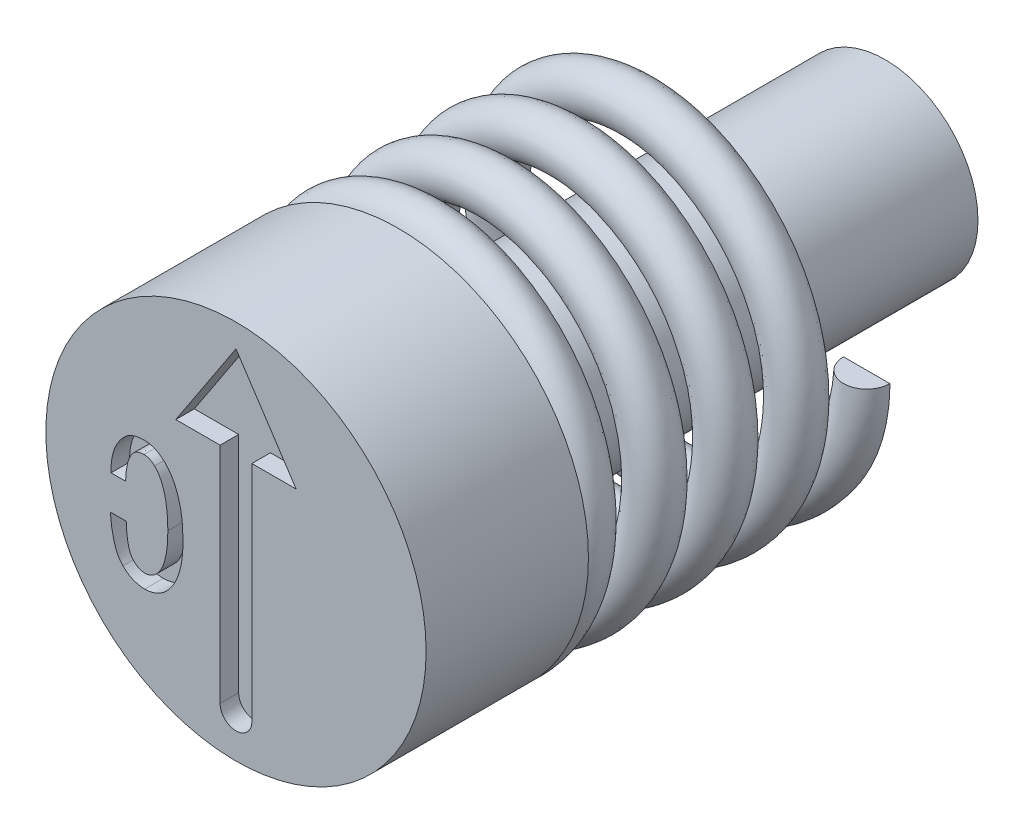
ISO-10303-21;
HEADER;
FILE_DESCRIPTION(('STEP AP214'),'2;1');
FILE_NAME('part.step','',(''),(''),'','','');
FILE_SCHEMA(('AUTOMOTIVE_DESIGN { 1 0 10303 214 1 1 1 1 }'));
ENDSEC;
DATA;
#1=APPLICATION_CONTEXT('core data for automotive mechanical design processes');
#2=APPLICATION_PROTOCOL_DEFINITION('international standard','automotive_design',2000,#1);
#3=PRODUCT_CONTEXT('',#1,'mechanical');
#4=PRODUCT('Part','Part','',(#3));
#5=PRODUCT_RELATED_PRODUCT_CATEGORY('part','',(#4));
#6=PRODUCT_DEFINITION_FORMATION('','',#4);
#7=PRODUCT_DEFINITION_CONTEXT('part definition',#1,'design');
#8=PRODUCT_DEFINITION('design','',#6,#7);
#9=PRODUCT_DEFINITION_SHAPE('','',#8);
#10=(LENGTH_UNIT() NAMED_UNIT(*) SI_UNIT(.MILLI.,.METRE.));
#11=(NAMED_UNIT(*) PLANE_ANGLE_UNIT() SI_UNIT($,.RADIAN.));
#12=(NAMED_UNIT(*) SI_UNIT($,.STERADIAN.) SOLID_ANGLE_UNIT());
#13=UNCERTAINTY_MEASURE_WITH_UNIT(LENGTH_MEASURE(1.E-05),#10,'distance_accuracy_value','');
#14=(GEOMETRIC_REPRESENTATION_CONTEXT(3) GLOBAL_UNCERTAINTY_ASSIGNED_CONTEXT((#13)) GLOBAL_UNIT_ASSIGNED_CONTEXT((#10,
#11,#12)) REPRESENTATION_CONTEXT('',''));
#15=CARTESIAN_POINT('',(0.,0.,0.));
#16=DIRECTION('',(0.,0.,1.));
#17=DIRECTION('',(1.,0.,0.));
#18=AXIS2_PLACEMENT_3D('',#15,#16,#17);
#19=CARTESIAN_POINT('',(3.6,0.,-10.5));
#20=DIRECTION('',(0.,-1.,0.));
#21=DIRECTION('',(0.,0.,-1.));
#22=AXIS2_PLACEMENT_3D('',#19,#20,#21);
#23=PLANE('',#22);
#24=CARTESIAN_POINT('',(3.6,0.,-10.));
#25=DIRECTION('',(0.,1.,0.));
#26=DIRECTION('',(0.,0.,1.));
#27=AXIS2_PLACEMENT_3D('',#24,#25,#26);
#28=CIRCLE('',#27,0.5);
#29=CARTESIAN_POINT('',(3.1,0.,-10.));
#30=VERTEX_POINT('',#29);
#31=CARTESIAN_POINT('',(4.1,0.,-10.));
#32=VERTEX_POINT('',#31);
#33=EDGE_CURVE('E88',#30,#32,#28,.T.);
#34=ORIENTED_EDGE('',*,*,#33,.T.);
#35=DIRECTION('',(-1.,0.,0.));
#36=VECTOR('',#35,1.);
#37=CARTESIAN_POINT('',(3.6,0.,-10.));
#38=LINE('',#37,#36);
#39=EDGE_CURVE('E75',#32,#30,#38,.T.);
#40=ORIENTED_EDGE('',*,*,#39,.T.);
#41=EDGE_LOOP('',(#34,#40));
#42=FACE_BOUND('',#41,.T.);
#43=ADVANCED_FACE('F49',(#42),#23,.F.);
#44=CARTESIAN_POINT('',(0.,-3.6,-4.));
#45=DIRECTION('',(-1.,0.,0.));
#46=DIRECTION('',(0.,-1.,0.));
#47=AXIS2_PLACEMENT_3D('',#44,#45,#46);
#48=PLANE('',#47);
#49=DIRECTION('',(0.,-1.,0.));
#50=VECTOR('',#49,1.);
#51=CARTESIAN_POINT('',(0.,-3.6,-3.5));
#52=LINE('',#51,#50);
#53=CARTESIAN_POINT('',(0.,-3.1,-3.5));
#54=VERTEX_POINT('',#53);
#55=CARTESIAN_POINT('',(0.,-4.1,-3.5));
#56=VERTEX_POINT('',#55);
#57=EDGE_CURVE('E69',#54,#56,#52,.T.);
#58=ORIENTED_EDGE('',*,*,#57,.F.);
#59=CARTESIAN_POINT('',(0.,-3.6,-3.5));
#60=DIRECTION('',(-1.,0.,0.));
#61=DIRECTION('',(0.,-1.,0.));
#62=AXIS2_PLACEMENT_3D('',#59,#60,#61);
#63=CIRCLE('',#62,0.5);
#64=EDGE_CURVE('E85',#54,#56,#63,.T.);
#65=ORIENTED_EDGE('',*,*,#64,.T.);
#66=EDGE_LOOP('',(#58,#65));
#67=FACE_BOUND('',#66,.T.);
#68=ADVANCED_FACE('F51',(#67),#48,.T.);
#69=CARTESIAN_POINT('',(3.6,0.,-9.5));
#70=CARTESIAN_POINT('',(3.6,-1.49116882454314,-9.40441176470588));
#71=CARTESIAN_POINT('',(2.54558441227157,-2.54558441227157,-9.30882352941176));
#72=CARTESIAN_POINT('',(1.49116882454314,-3.6,-9.21323529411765));
#73=CARTESIAN_POINT('',(0.,-3.6,-9.11764705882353));
#74=CARTESIAN_POINT('',(-1.49116882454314,-3.6,-9.02205882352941));
#75=CARTESIAN_POINT('',(-2.54558441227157,-2.54558441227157,-8.9264705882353));
#76=CARTESIAN_POINT('',(-3.6,-1.49116882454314,-8.83088235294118));
#77=CARTESIAN_POINT('',(-3.6,0.,-8.73529411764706));
#78=CARTESIAN_POINT('',(-3.6,1.49116882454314,-8.63970588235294));
#79=CARTESIAN_POINT('',(-2.54558441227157,2.54558441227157,-8.54411764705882));
#80=CARTESIAN_POINT('',(-1.49116882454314,3.6,-8.44852941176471));
#81=CARTESIAN_POINT('',(0.,3.6,-8.35294117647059));
#82=CARTESIAN_POINT('',(1.49116882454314,3.6,-8.25735294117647));
#83=CARTESIAN_POINT('',(2.54558441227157,2.54558441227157,-8.16176470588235));
#84=CARTESIAN_POINT('',(3.6,1.49116882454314,-8.06617647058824));
#85=CARTESIAN_POINT('',(3.6,0.,-7.97058823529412));
#86=CARTESIAN_POINT('',(3.6,-1.49116882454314,-7.875));
#87=CARTESIAN_POINT('',(2.54558441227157,-2.54558441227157,-7.77941176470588));
#88=CARTESIAN_POINT('',(1.49116882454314,-3.6,-7.68382352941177));
#89=CARTESIAN_POINT('',(0.,-3.6,-7.58823529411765));
#90=CARTESIAN_POINT('',(-1.49116882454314,-3.6,-7.49264705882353));
#91=CARTESIAN_POINT('',(-2.54558441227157,-2.54558441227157,-7.39705882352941));
#92=CARTESIAN_POINT('',(-3.6,-1.49116882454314,-7.3014705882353));
#93=CARTESIAN_POINT('',(-3.6,0.,-7.20588235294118));
#94=CARTESIAN_POINT('',(-3.6,1.49116882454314,-7.11029411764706));
#95=CARTESIAN_POINT('',(-2.54558441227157,2.54558441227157,-7.01470588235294));
#96=CARTESIAN_POINT('',(-1.49116882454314,3.6,-6.91911764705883));
#97=CARTESIAN_POINT('',(0.,3.6,-6.82352941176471));
#98=CARTESIAN_POINT('',(1.49116882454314,3.6,-6.72794117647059));
#99=CARTESIAN_POINT('',(2.54558441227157,2.54558441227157,-6.63235294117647));
#100=CARTESIAN_POINT('',(3.6,1.49116882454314,-6.53676470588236));
#101=CARTESIAN_POINT('',(3.6,0.,-6.44117647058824));
#102=CARTESIAN_POINT('',(3.6,-1.49116882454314,-6.34558823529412));
#103=CARTESIAN_POINT('',(2.54558441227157,-2.54558441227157,-6.25));
#104=CARTESIAN_POINT('',(1.49116882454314,-3.6,-6.15441176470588));
#105=CARTESIAN_POINT('',(0.,-3.6,-6.05882352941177));
#106=CARTESIAN_POINT('',(-1.49116882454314,-3.6,-5.96323529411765));
#107=CARTESIAN_POINT('',(-2.54558441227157,-2.54558441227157,-5.86764705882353));
#108=CARTESIAN_POINT('',(-3.6,-1.49116882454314,-5.77205882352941));
#109=CARTESIAN_POINT('',(-3.6,0.,-5.6764705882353));
#110=CARTESIAN_POINT('',(-3.6,1.49116882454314,-5.58088235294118));
#111=CARTESIAN_POINT('',(-2.54558441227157,2.54558441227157,-5.48529411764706));
#112=CARTESIAN_POINT('',(-1.49116882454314,3.6,-5.38970588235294));
#113=CARTESIAN_POINT('',(0.,3.6,-5.29411764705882));
#114=CARTESIAN_POINT('',(1.49116882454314,3.6,-5.19852941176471));
#115=CARTESIAN_POINT('',(2.54558441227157,2.54558441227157,-5.10294117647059));
#116=CARTESIAN_POINT('',(3.6,1.49116882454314,-5.00735294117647));
#117=CARTESIAN_POINT('',(3.6,0.,-4.91176470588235));
#118=CARTESIAN_POINT('',(3.6,-1.49116882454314,-4.81617647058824));
#119=CARTESIAN_POINT('',(2.54558441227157,-2.54558441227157,-4.72058823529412));
#120=CARTESIAN_POINT('',(1.49116882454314,-3.6,-4.625));
#121=CARTESIAN_POINT('',(0.,-3.6,-4.52941176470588));
#122=CARTESIAN_POINT('',(-1.49116882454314,-3.6,-4.43382352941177));
#123=CARTESIAN_POINT('',(-2.54558441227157,-2.54558441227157,-4.33823529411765));
#124=CARTESIAN_POINT('',(-3.6,-1.49116882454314,-4.24264705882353));
#125=CARTESIAN_POINT('',(-3.6,0.,-4.14705882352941));
#126=CARTESIAN_POINT('',(-3.6,1.49116882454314,-4.0514705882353));
#127=CARTESIAN_POINT('',(-2.54558441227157,2.54558441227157,-3.95588235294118));
#128=CARTESIAN_POINT('',(-1.49116882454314,3.6,-3.86029411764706));
#129=CARTESIAN_POINT('',(0.,3.6,-3.76470588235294));
#130=CARTESIAN_POINT('',(1.49116882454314,3.6,-3.66911764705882));
#131=CARTESIAN_POINT('',(2.54558441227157,2.54558441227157,-3.57352941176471));
#132=CARTESIAN_POINT('',(3.6,1.49116882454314,-3.47794117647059));
#133=CARTESIAN_POINT('',(3.6,0.,-3.38235294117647));
#134=CARTESIAN_POINT('',(3.6,-1.49116882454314,-3.28676470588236));
#135=CARTESIAN_POINT('',(2.54558441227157,-2.54558441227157,-3.19117647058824));
#136=CARTESIAN_POINT('',(1.49116882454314,-3.6,-3.09558823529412));
#137=CARTESIAN_POINT('',(0.,-3.6,-3.));
#138=CARTESIAN_POINT('',(4.6,0.,-9.5));
#139=CARTESIAN_POINT('',(4.6,-1.90538238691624,-9.40441176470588));
#140=CARTESIAN_POINT('',(3.25269119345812,-3.25269119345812,-9.30882352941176));
#141=CARTESIAN_POINT('',(1.90538238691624,-4.6,-9.21323529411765));
#142=CARTESIAN_POINT('',(0.,-4.6,-9.11764705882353));
#143=CARTESIAN_POINT('',(-1.90538238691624,-4.6,-9.02205882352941));
#144=CARTESIAN_POINT('',(-3.25269119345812,-3.25269119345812,-8.9264705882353));
#145=CARTESIAN_POINT('',(-4.6,-1.90538238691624,-8.83088235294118));
#146=CARTESIAN_POINT('',(-4.6,0.,-8.73529411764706));
#147=CARTESIAN_POINT('',(-4.6,1.90538238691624,-8.63970588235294));
#148=CARTESIAN_POINT('',(-3.25269119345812,3.25269119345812,-8.54411764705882));
#149=CARTESIAN_POINT('',(-1.90538238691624,4.6,-8.4485294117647));
#150=CARTESIAN_POINT('',(0.,4.6,-8.35294117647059));
#151=CARTESIAN_POINT('',(1.90538238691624,4.6,-8.25735294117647));
#152=CARTESIAN_POINT('',(3.25269119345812,3.25269119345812,-8.16176470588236));
#153=CARTESIAN_POINT('',(4.6,1.90538238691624,-8.06617647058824));
#154=CARTESIAN_POINT('',(4.6,0.,-7.97058823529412));
#155=CARTESIAN_POINT('',(4.6,-1.90538238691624,-7.875));
#156=CARTESIAN_POINT('',(3.25269119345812,-3.25269119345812,-7.77941176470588));
#157=CARTESIAN_POINT('',(1.90538238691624,-4.6,-7.68382352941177));
#158=CARTESIAN_POINT('',(0.,-4.6,-7.58823529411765));
#159=CARTESIAN_POINT('',(-1.90538238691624,-4.6,-7.49264705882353));
#160=CARTESIAN_POINT('',(-3.25269119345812,-3.25269119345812,-7.39705882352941));
#161=CARTESIAN_POINT('',(-4.6,-1.90538238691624,-7.30147058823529));
#162=CARTESIAN_POINT('',(-4.6,0.,-7.20588235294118));
#163=CARTESIAN_POINT('',(-4.6,1.90538238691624,-7.11029411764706));
#164=CARTESIAN_POINT('',(-3.25269119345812,3.25269119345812,-7.01470588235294));
#165=CARTESIAN_POINT('',(-1.90538238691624,4.6,-6.91911764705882));
#166=CARTESIAN_POINT('',(0.,4.6,-6.82352941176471));
#167=CARTESIAN_POINT('',(1.90538238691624,4.6,-6.72794117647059));
#168=CARTESIAN_POINT('',(3.25269119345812,3.25269119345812,-6.63235294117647));
#169=CARTESIAN_POINT('',(4.6,1.90538238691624,-6.53676470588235));
#170=CARTESIAN_POINT('',(4.6,0.,-6.44117647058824));
#171=CARTESIAN_POINT('',(4.6,-1.90538238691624,-6.34558823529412));
#172=CARTESIAN_POINT('',(3.25269119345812,-3.25269119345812,-6.25));
#173=CARTESIAN_POINT('',(1.90538238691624,-4.6,-6.15441176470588));
#174=CARTESIAN_POINT('',(0.,-4.6,-6.05882352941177));
#175=CARTESIAN_POINT('',(-1.90538238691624,-4.6,-5.96323529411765));
#176=CARTESIAN_POINT('',(-3.25269119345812,-3.25269119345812,-5.86764705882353));
#177=CARTESIAN_POINT('',(-4.6,-1.90538238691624,-5.77205882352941));
#178=CARTESIAN_POINT('',(-4.6,0.,-5.6764705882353));
#179=CARTESIAN_POINT('',(-4.6,1.90538238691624,-5.58088235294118));
#180=CARTESIAN_POINT('',(-3.25269119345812,3.25269119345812,-5.48529411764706));
#181=CARTESIAN_POINT('',(-1.90538238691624,4.6,-5.38970588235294));
#182=CARTESIAN_POINT('',(0.,4.6,-5.29411764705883));
#183=CARTESIAN_POINT('',(1.90538238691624,4.6,-5.19852941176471));
#184=CARTESIAN_POINT('',(3.25269119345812,3.25269119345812,-5.10294117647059));
#185=CARTESIAN_POINT('',(4.6,1.90538238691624,-5.00735294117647));
#186=CARTESIAN_POINT('',(4.6,0.,-4.91176470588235));
#187=CARTESIAN_POINT('',(4.6,-1.90538238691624,-4.81617647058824));
#188=CARTESIAN_POINT('',(3.25269119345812,-3.25269119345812,-4.72058823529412));
#189=CARTESIAN_POINT('',(1.90538238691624,-4.6,-4.625));
#190=CARTESIAN_POINT('',(0.,-4.6,-4.52941176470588));
#191=CARTESIAN_POINT('',(-1.90538238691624,-4.6,-4.43382352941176));
#192=CARTESIAN_POINT('',(-3.25269119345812,-3.25269119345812,-4.33823529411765));
#193=CARTESIAN_POINT('',(-4.6,-1.90538238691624,-4.24264705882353));
#194=CARTESIAN_POINT('',(-4.6,0.,-4.14705882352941));
#195=CARTESIAN_POINT('',(-4.6,1.90538238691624,-4.05147058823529));
#196=CARTESIAN_POINT('',(-3.25269119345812,3.25269119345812,-3.95588235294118));
#197=CARTESIAN_POINT('',(-1.90538238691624,4.6,-3.86029411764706));
#198=CARTESIAN_POINT('',(0.,4.6,-3.76470588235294));
#199=CARTESIAN_POINT('',(1.90538238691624,4.6,-3.66911764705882));
#200=CARTESIAN_POINT('',(3.25269119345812,3.25269119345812,-3.57352941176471));
#201=CARTESIAN_POINT('',(4.6,1.90538238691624,-3.47794117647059));
#202=CARTESIAN_POINT('',(4.6,0.,-3.38235294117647));
#203=CARTESIAN_POINT('',(4.6,-1.90538238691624,-3.28676470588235));
#204=CARTESIAN_POINT('',(3.25269119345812,-3.25269119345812,-3.19117647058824));
#205=CARTESIAN_POINT('',(1.90538238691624,-4.6,-3.09558823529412));
#206=CARTESIAN_POINT('',(0.,-4.6,-3.));
#207=CARTESIAN_POINT('',(4.6,0.,-10.5));
#208=CARTESIAN_POINT('',(4.6,-1.90538238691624,-10.4044117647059));
#209=CARTESIAN_POINT('',(3.25269119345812,-3.25269119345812,-10.3088235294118));
#210=CARTESIAN_POINT('',(1.90538238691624,-4.6,-10.2132352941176));
#211=CARTESIAN_POINT('',(0.,-4.6,-10.1176470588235));
#212=CARTESIAN_POINT('',(-1.90538238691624,-4.6,-10.0220588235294));
#213=CARTESIAN_POINT('',(-3.25269119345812,-3.25269119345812,-9.9264705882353));
#214=CARTESIAN_POINT('',(-4.6,-1.90538238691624,-9.83088235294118));
#215=CARTESIAN_POINT('',(-4.6,0.,-9.73529411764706));
#216=CARTESIAN_POINT('',(-4.6,1.90538238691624,-9.63970588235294));
#217=CARTESIAN_POINT('',(-3.25269119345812,3.25269119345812,-9.54411764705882));
#218=CARTESIAN_POINT('',(-1.90538238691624,4.6,-9.44852941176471));
#219=CARTESIAN_POINT('',(0.,4.6,-9.35294117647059));
#220=CARTESIAN_POINT('',(1.90538238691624,4.6,-9.25735294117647));
#221=CARTESIAN_POINT('',(3.25269119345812,3.25269119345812,-9.16176470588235));
#222=CARTESIAN_POINT('',(4.6,1.90538238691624,-9.06617647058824));
#223=CARTESIAN_POINT('',(4.6,0.,-8.97058823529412));
#224=CARTESIAN_POINT('',(4.6,-1.90538238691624,-8.875));
#225=CARTESIAN_POINT('',(3.25269119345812,-3.25269119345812,-8.77941176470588));
#226=CARTESIAN_POINT('',(1.90538238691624,-4.6,-8.68382352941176));
#227=CARTESIAN_POINT('',(0.,-4.6,-8.58823529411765));
#228=CARTESIAN_POINT('',(-1.90538238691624,-4.6,-8.49264705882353));
#229=CARTESIAN_POINT('',(-3.25269119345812,-3.25269119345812,-8.39705882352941));
#230=CARTESIAN_POINT('',(-4.6,-1.90538238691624,-8.30147058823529));
#231=CARTESIAN_POINT('',(-4.6,0.,-8.20588235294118));
#232=CARTESIAN_POINT('',(-4.6,1.90538238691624,-8.11029411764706));
#233=CARTESIAN_POINT('',(-3.25269119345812,3.25269119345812,-8.01470588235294));
#234=CARTESIAN_POINT('',(-1.90538238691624,4.6,-7.91911764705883));
#235=CARTESIAN_POINT('',(0.,4.6,-7.82352941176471));
#236=CARTESIAN_POINT('',(1.90538238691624,4.6,-7.72794117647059));
#237=CARTESIAN_POINT('',(3.25269119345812,3.25269119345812,-7.63235294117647));
#238=CARTESIAN_POINT('',(4.6,1.90538238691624,-7.53676470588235));
#239=CARTESIAN_POINT('',(4.6,0.,-7.44117647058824));
#240=CARTESIAN_POINT('',(4.6,-1.90538238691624,-7.34558823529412));
#241=CARTESIAN_POINT('',(3.25269119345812,-3.25269119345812,-7.25));
#242=CARTESIAN_POINT('',(1.90538238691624,-4.6,-7.15441176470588));
#243=CARTESIAN_POINT('',(0.,-4.6,-7.05882352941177));
#244=CARTESIAN_POINT('',(-1.90538238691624,-4.6,-6.96323529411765));
#245=CARTESIAN_POINT('',(-3.25269119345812,-3.25269119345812,-6.86764705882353));
#246=CARTESIAN_POINT('',(-4.6,-1.90538238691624,-6.77205882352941));
#247=CARTESIAN_POINT('',(-4.6,0.,-6.6764705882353));
#248=CARTESIAN_POINT('',(-4.6,1.90538238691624,-6.58088235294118));
#249=CARTESIAN_POINT('',(-3.25269119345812,3.25269119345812,-6.48529411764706));
#250=CARTESIAN_POINT('',(-1.90538238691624,4.6,-6.38970588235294));
#251=CARTESIAN_POINT('',(0.,4.6,-6.29411764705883));
#252=CARTESIAN_POINT('',(1.90538238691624,4.6,-6.19852941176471));
#253=CARTESIAN_POINT('',(3.25269119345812,3.25269119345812,-6.10294117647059));
#254=CARTESIAN_POINT('',(4.6,1.90538238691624,-6.00735294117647));
#255=CARTESIAN_POINT('',(4.6,0.,-5.91176470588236));
#256=CARTESIAN_POINT('',(4.6,-1.90538238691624,-5.81617647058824));
#257=CARTESIAN_POINT('',(3.25269119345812,-3.25269119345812,-5.72058823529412));
#258=CARTESIAN_POINT('',(1.90538238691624,-4.6,-5.625));
#259=CARTESIAN_POINT('',(0.,-4.6,-5.52941176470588));
#260=CARTESIAN_POINT('',(-1.90538238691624,-4.6,-5.43382352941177));
#261=CARTESIAN_POINT('',(-3.25269119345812,-3.25269119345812,-5.33823529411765));
#262=CARTESIAN_POINT('',(-4.6,-1.90538238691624,-5.24264705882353));
#263=CARTESIAN_POINT('',(-4.6,0.,-5.14705882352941));
#264=CARTESIAN_POINT('',(-4.6,1.90538238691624,-5.0514705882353));
#265=CARTESIAN_POINT('',(-3.25269119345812,3.25269119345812,-4.95588235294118));
#266=CARTESIAN_POINT('',(-1.90538238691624,4.6,-4.86029411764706));
#267=CARTESIAN_POINT('',(0.,4.6,-4.76470588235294));
#268=CARTESIAN_POINT('',(1.90538238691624,4.6,-4.66911764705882));
#269=CARTESIAN_POINT('',(3.25269119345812,3.25269119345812,-4.57352941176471));
#270=CARTESIAN_POINT('',(4.6,1.90538238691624,-4.47794117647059));
#271=CARTESIAN_POINT('',(4.6,0.,-4.38235294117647));
#272=CARTESIAN_POINT('',(4.6,-1.90538238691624,-4.28676470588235));
#273=CARTESIAN_POINT('',(3.25269119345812,-3.25269119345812,-4.19117647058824));
#274=CARTESIAN_POINT('',(1.90538238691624,-4.6,-4.09558823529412));
#275=CARTESIAN_POINT('',(0.,-4.6,-4.));
#276=CARTESIAN_POINT('',(3.6,0.,-10.5));
#277=CARTESIAN_POINT('',(3.6,-1.49116882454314,-10.4044117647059));
#278=CARTESIAN_POINT('',(2.54558441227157,-2.54558441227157,-10.3088235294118));
#279=CARTESIAN_POINT('',(1.49116882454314,-3.6,-10.2132352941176));
#280=CARTESIAN_POINT('',(0.,-3.6,-10.1176470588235));
#281=CARTESIAN_POINT('',(-1.49116882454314,-3.6,-10.0220588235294));
#282=CARTESIAN_POINT('',(-2.54558441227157,-2.54558441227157,-9.9264705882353));
#283=CARTESIAN_POINT('',(-3.6,-1.49116882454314,-9.83088235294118));
#284=CARTESIAN_POINT('',(-3.6,0.,-9.73529411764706));
#285=CARTESIAN_POINT('',(-3.6,1.49116882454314,-9.63970588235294));
#286=CARTESIAN_POINT('',(-2.54558441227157,2.54558441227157,-9.54411764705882));
#287=CARTESIAN_POINT('',(-1.49116882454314,3.6,-9.44852941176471));
#288=CARTESIAN_POINT('',(0.,3.6,-9.35294117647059));
#289=CARTESIAN_POINT('',(1.49116882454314,3.6,-9.25735294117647));
#290=CARTESIAN_POINT('',(2.54558441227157,2.54558441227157,-9.16176470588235));
#291=CARTESIAN_POINT('',(3.6,1.49116882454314,-9.06617647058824));
#292=CARTESIAN_POINT('',(3.6,0.,-8.97058823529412));
#293=CARTESIAN_POINT('',(3.6,-1.49116882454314,-8.875));
#294=CARTESIAN_POINT('',(2.54558441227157,-2.54558441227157,-8.77941176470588));
#295=CARTESIAN_POINT('',(1.49116882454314,-3.6,-8.68382352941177));
#296=CARTESIAN_POINT('',(0.,-3.6,-8.58823529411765));
#297=CARTESIAN_POINT('',(-1.49116882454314,-3.6,-8.49264705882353));
#298=CARTESIAN_POINT('',(-2.54558441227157,-2.54558441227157,-8.39705882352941));
#299=CARTESIAN_POINT('',(-3.6,-1.49116882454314,-8.3014705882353));
#300=CARTESIAN_POINT('',(-3.6,0.,-8.20588235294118));
#301=CARTESIAN_POINT('',(-3.6,1.49116882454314,-8.11029411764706));
#302=CARTESIAN_POINT('',(-2.54558441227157,2.54558441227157,-8.01470588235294));
#303=CARTESIAN_POINT('',(-1.49116882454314,3.6,-7.91911764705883));
#304=CARTESIAN_POINT('',(0.,3.6,-7.82352941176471));
#305=CARTESIAN_POINT('',(1.49116882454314,3.6,-7.72794117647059));
#306=CARTESIAN_POINT('',(2.54558441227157,2.54558441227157,-7.63235294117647));
#307=CARTESIAN_POINT('',(3.6,1.49116882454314,-7.53676470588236));
#308=CARTESIAN_POINT('',(3.6,0.,-7.44117647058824));
#309=CARTESIAN_POINT('',(3.6,-1.49116882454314,-7.34558823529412));
#310=CARTESIAN_POINT('',(2.54558441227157,-2.54558441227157,-7.25));
#311=CARTESIAN_POINT('',(1.49116882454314,-3.6,-7.15441176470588));
#312=CARTESIAN_POINT('',(0.,-3.6,-7.05882352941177));
#313=CARTESIAN_POINT('',(-1.49116882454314,-3.6,-6.96323529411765));
#314=CARTESIAN_POINT('',(-2.54558441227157,-2.54558441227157,-6.86764705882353));
#315=CARTESIAN_POINT('',(-3.6,-1.49116882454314,-6.77205882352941));
#316=CARTESIAN_POINT('',(-3.6,0.,-6.6764705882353));
#317=CARTESIAN_POINT('',(-3.6,1.49116882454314,-6.58088235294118));
#318=CARTESIAN_POINT('',(-2.54558441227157,2.54558441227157,-6.48529411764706));
#319=CARTESIAN_POINT('',(-1.49116882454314,3.6,-6.38970588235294));
#320=CARTESIAN_POINT('',(0.,3.6,-6.29411764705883));
#321=CARTESIAN_POINT('',(1.49116882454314,3.6,-6.19852941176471));
#322=CARTESIAN_POINT('',(2.54558441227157,2.54558441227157,-6.10294117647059));
#323=CARTESIAN_POINT('',(3.6,1.49116882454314,-6.00735294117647));
#324=CARTESIAN_POINT('',(3.6,0.,-5.91176470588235));
#325=CARTESIAN_POINT('',(3.6,-1.49116882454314,-5.81617647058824));
#326=CARTESIAN_POINT('',(2.54558441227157,-2.54558441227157,-5.72058823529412));
#327=CARTESIAN_POINT('',(1.49116882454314,-3.6,-5.625));
#328=CARTESIAN_POINT('',(0.,-3.6,-5.52941176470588));
#329=CARTESIAN_POINT('',(-1.49116882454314,-3.6,-5.43382352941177));
#330=CARTESIAN_POINT('',(-2.54558441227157,-2.54558441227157,-5.33823529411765));
#331=CARTESIAN_POINT('',(-3.6,-1.49116882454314,-5.24264705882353));
#332=CARTESIAN_POINT('',(-3.6,0.,-5.14705882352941));
#333=CARTESIAN_POINT('',(-3.6,1.49116882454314,-5.0514705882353));
#334=CARTESIAN_POINT('',(-2.54558441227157,2.54558441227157,-4.95588235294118));
#335=CARTESIAN_POINT('',(-1.49116882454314,3.6,-4.86029411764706));
#336=CARTESIAN_POINT('',(0.,3.6,-4.76470588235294));
#337=CARTESIAN_POINT('',(1.49116882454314,3.6,-4.66911764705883));
#338=CARTESIAN_POINT('',(2.54558441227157,2.54558441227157,-4.57352941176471));
#339=CARTESIAN_POINT('',(3.6,1.49116882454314,-4.47794117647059));
#340=CARTESIAN_POINT('',(3.6,0.,-4.38235294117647));
#341=CARTESIAN_POINT('',(3.6,-1.49116882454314,-4.28676470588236));
#342=CARTESIAN_POINT('',(2.54558441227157,-2.54558441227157,-4.19117647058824));
#343=CARTESIAN_POINT('',(1.49116882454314,-3.6,-4.09558823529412));
#344=CARTESIAN_POINT('',(0.,-3.6,-4.));
#345=CARTESIAN_POINT('',(2.6,0.,-10.5));
#346=CARTESIAN_POINT('',(2.6,-1.07695526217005,-10.4044117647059));
#347=CARTESIAN_POINT('',(1.83847763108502,-1.83847763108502,-10.3088235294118));
#348=CARTESIAN_POINT('',(1.07695526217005,-2.6,-10.2132352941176));
#349=CARTESIAN_POINT('',(0.,-2.6,-10.1176470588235));
#350=CARTESIAN_POINT('',(-1.07695526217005,-2.6,-10.0220588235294));
#351=CARTESIAN_POINT('',(-1.83847763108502,-1.83847763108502,-9.9264705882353));
#352=CARTESIAN_POINT('',(-2.6,-1.07695526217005,-9.83088235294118));
#353=CARTESIAN_POINT('',(-2.6,0.,-9.73529411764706));
#354=CARTESIAN_POINT('',(-2.6,1.07695526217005,-9.63970588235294));
#355=CARTESIAN_POINT('',(-1.83847763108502,1.83847763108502,-9.54411764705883));
#356=CARTESIAN_POINT('',(-1.07695526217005,2.6,-9.44852941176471));
#357=CARTESIAN_POINT('',(0.,2.6,-9.35294117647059));
#358=CARTESIAN_POINT('',(1.07695526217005,2.6,-9.25735294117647));
#359=CARTESIAN_POINT('',(1.83847763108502,1.83847763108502,-9.16176470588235));
#360=CARTESIAN_POINT('',(2.6,1.07695526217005,-9.06617647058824));
#361=CARTESIAN_POINT('',(2.6,0.,-8.97058823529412));
#362=CARTESIAN_POINT('',(2.6,-1.07695526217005,-8.875));
#363=CARTESIAN_POINT('',(1.83847763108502,-1.83847763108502,-8.77941176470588));
#364=CARTESIAN_POINT('',(1.07695526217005,-2.6,-8.68382352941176));
#365=CARTESIAN_POINT('',(0.,-2.6,-8.58823529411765));
#366=CARTESIAN_POINT('',(-1.07695526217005,-2.6,-8.49264705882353));
#367=CARTESIAN_POINT('',(-1.83847763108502,-1.83847763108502,-8.39705882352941));
#368=CARTESIAN_POINT('',(-2.6,-1.07695526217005,-8.30147058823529));
#369=CARTESIAN_POINT('',(-2.6,0.,-8.20588235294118));
#370=CARTESIAN_POINT('',(-2.6,1.07695526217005,-8.11029411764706));
#371=CARTESIAN_POINT('',(-1.83847763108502,1.83847763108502,-8.01470588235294));
#372=CARTESIAN_POINT('',(-1.07695526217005,2.6,-7.91911764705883));
#373=CARTESIAN_POINT('',(0.,2.6,-7.82352941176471));
#374=CARTESIAN_POINT('',(1.07695526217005,2.6,-7.72794117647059));
#375=CARTESIAN_POINT('',(1.83847763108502,1.83847763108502,-7.63235294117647));
#376=CARTESIAN_POINT('',(2.6,1.07695526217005,-7.53676470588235));
#377=CARTESIAN_POINT('',(2.6,0.,-7.44117647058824));
#378=CARTESIAN_POINT('',(2.6,-1.07695526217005,-7.34558823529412));
#379=CARTESIAN_POINT('',(1.83847763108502,-1.83847763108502,-7.25));
#380=CARTESIAN_POINT('',(1.07695526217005,-2.6,-7.15441176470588));
#381=CARTESIAN_POINT('',(0.,-2.6,-7.05882352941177));
#382=CARTESIAN_POINT('',(-1.07695526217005,-2.6,-6.96323529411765));
#383=CARTESIAN_POINT('',(-1.83847763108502,-1.83847763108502,-6.86764705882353));
#384=CARTESIAN_POINT('',(-2.6,-1.07695526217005,-6.77205882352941));
#385=CARTESIAN_POINT('',(-2.6,0.,-6.6764705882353));
#386=CARTESIAN_POINT('',(-2.6,1.07695526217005,-6.58088235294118));
#387=CARTESIAN_POINT('',(-1.83847763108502,1.83847763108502,-6.48529411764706));
#388=CARTESIAN_POINT('',(-1.07695526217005,2.6,-6.38970588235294));
#389=CARTESIAN_POINT('',(0.,2.6,-6.29411764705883));
#390=CARTESIAN_POINT('',(1.07695526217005,2.6,-6.19852941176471));
#391=CARTESIAN_POINT('',(1.83847763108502,1.83847763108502,-6.10294117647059));
#392=CARTESIAN_POINT('',(2.6,1.07695526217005,-6.00735294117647));
#393=CARTESIAN_POINT('',(2.6,0.,-5.91176470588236));
#394=CARTESIAN_POINT('',(2.6,-1.07695526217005,-5.81617647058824));
#395=CARTESIAN_POINT('',(1.83847763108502,-1.83847763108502,-5.72058823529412));
#396=CARTESIAN_POINT('',(1.07695526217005,-2.6,-5.625));
#397=CARTESIAN_POINT('',(0.,-2.6,-5.52941176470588));
#398=CARTESIAN_POINT('',(-1.07695526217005,-2.6,-5.43382352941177));
#399=CARTESIAN_POINT('',(-1.83847763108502,-1.83847763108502,-5.33823529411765));
#400=CARTESIAN_POINT('',(-2.6,-1.07695526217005,-5.24264705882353));
#401=CARTESIAN_POINT('',(-2.6,0.,-5.14705882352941));
#402=CARTESIAN_POINT('',(-2.6,1.07695526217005,-5.0514705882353));
#403=CARTESIAN_POINT('',(-1.83847763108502,1.83847763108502,-4.95588235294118));
#404=CARTESIAN_POINT('',(-1.07695526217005,2.6,-4.86029411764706));
#405=CARTESIAN_POINT('',(0.,2.6,-4.76470588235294));
#406=CARTESIAN_POINT('',(1.07695526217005,2.6,-4.66911764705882));
#407=CARTESIAN_POINT('',(1.83847763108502,1.83847763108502,-4.57352941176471));
#408=CARTESIAN_POINT('',(2.6,1.07695526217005,-4.47794117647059));
#409=CARTESIAN_POINT('',(2.6,0.,-4.38235294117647));
#410=CARTESIAN_POINT('',(2.6,-1.07695526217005,-4.28676470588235));
#411=CARTESIAN_POINT('',(1.83847763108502,-1.83847763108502,-4.19117647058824));
#412=CARTESIAN_POINT('',(1.07695526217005,-2.6,-4.09558823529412));
#413=CARTESIAN_POINT('',(0.,-2.6,-4.));
#414=CARTESIAN_POINT('',(2.6,0.,-9.5));
#415=CARTESIAN_POINT('',(2.6,-1.07695526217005,-9.40441176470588));
#416=CARTESIAN_POINT('',(1.83847763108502,-1.83847763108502,-9.30882352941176));
#417=CARTESIAN_POINT('',(1.07695526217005,-2.6,-9.21323529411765));
#418=CARTESIAN_POINT('',(0.,-2.6,-9.11764705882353));
#419=CARTESIAN_POINT('',(-1.07695526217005,-2.6,-9.02205882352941));
#420=CARTESIAN_POINT('',(-1.83847763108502,-1.83847763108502,-8.9264705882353));
#421=CARTESIAN_POINT('',(-2.6,-1.07695526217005,-8.83088235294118));
#422=CARTESIAN_POINT('',(-2.6,0.,-8.73529411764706));
#423=CARTESIAN_POINT('',(-2.6,1.07695526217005,-8.63970588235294));
#424=CARTESIAN_POINT('',(-1.83847763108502,1.83847763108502,-8.54411764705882));
#425=CARTESIAN_POINT('',(-1.07695526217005,2.6,-8.4485294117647));
#426=CARTESIAN_POINT('',(0.,2.6,-8.35294117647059));
#427=CARTESIAN_POINT('',(1.07695526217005,2.6,-8.25735294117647));
#428=CARTESIAN_POINT('',(1.83847763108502,1.83847763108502,-8.16176470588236));
#429=CARTESIAN_POINT('',(2.6,1.07695526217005,-8.06617647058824));
#430=CARTESIAN_POINT('',(2.6,0.,-7.97058823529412));
#431=CARTESIAN_POINT('',(2.6,-1.07695526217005,-7.875));
#432=CARTESIAN_POINT('',(1.83847763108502,-1.83847763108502,-7.77941176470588));
#433=CARTESIAN_POINT('',(1.07695526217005,-2.6,-7.68382352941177));
#434=CARTESIAN_POINT('',(0.,-2.6,-7.58823529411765));
#435=CARTESIAN_POINT('',(-1.07695526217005,-2.6,-7.49264705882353));
#436=CARTESIAN_POINT('',(-1.83847763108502,-1.83847763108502,-7.39705882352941));
#437=CARTESIAN_POINT('',(-2.6,-1.07695526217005,-7.30147058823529));
#438=CARTESIAN_POINT('',(-2.6,0.,-7.20588235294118));
#439=CARTESIAN_POINT('',(-2.6,1.07695526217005,-7.11029411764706));
#440=CARTESIAN_POINT('',(-1.83847763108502,1.83847763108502,-7.01470588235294));
#441=CARTESIAN_POINT('',(-1.07695526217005,2.6,-6.91911764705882));
#442=CARTESIAN_POINT('',(0.,2.6,-6.82352941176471));
#443=CARTESIAN_POINT('',(1.07695526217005,2.6,-6.72794117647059));
#444=CARTESIAN_POINT('',(1.83847763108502,1.83847763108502,-6.63235294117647));
#445=CARTESIAN_POINT('',(2.6,1.07695526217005,-6.53676470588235));
#446=CARTESIAN_POINT('',(2.6,0.,-6.44117647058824));
#447=CARTESIAN_POINT('',(2.6,-1.07695526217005,-6.34558823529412));
#448=CARTESIAN_POINT('',(1.83847763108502,-1.83847763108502,-6.25));
#449=CARTESIAN_POINT('',(1.07695526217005,-2.6,-6.15441176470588));
#450=CARTESIAN_POINT('',(0.,-2.6,-6.05882352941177));
#451=CARTESIAN_POINT('',(-1.07695526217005,-2.6,-5.96323529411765));
#452=CARTESIAN_POINT('',(-1.83847763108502,-1.83847763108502,-5.86764705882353));
#453=CARTESIAN_POINT('',(-2.6,-1.07695526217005,-5.77205882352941));
#454=CARTESIAN_POINT('',(-2.6,0.,-5.6764705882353));
#455=CARTESIAN_POINT('',(-2.6,1.07695526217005,-5.58088235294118));
#456=CARTESIAN_POINT('',(-1.83847763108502,1.83847763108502,-5.48529411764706));
#457=CARTESIAN_POINT('',(-1.07695526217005,2.6,-5.38970588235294));
#458=CARTESIAN_POINT('',(0.,2.6,-5.29411764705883));
#459=CARTESIAN_POINT('',(1.07695526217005,2.6,-5.19852941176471));
#460=CARTESIAN_POINT('',(1.83847763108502,1.83847763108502,-5.10294117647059));
#461=CARTESIAN_POINT('',(2.6,1.07695526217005,-5.00735294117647));
#462=CARTESIAN_POINT('',(2.6,0.,-4.91176470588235));
#463=CARTESIAN_POINT('',(2.6,-1.07695526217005,-4.81617647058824));
#464=CARTESIAN_POINT('',(1.83847763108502,-1.83847763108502,-4.72058823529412));
#465=CARTESIAN_POINT('',(1.07695526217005,-2.6,-4.625));
#466=CARTESIAN_POINT('',(0.,-2.6,-4.52941176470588));
#467=CARTESIAN_POINT('',(-1.07695526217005,-2.6,-4.43382352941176));
#468=CARTESIAN_POINT('',(-1.83847763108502,-1.83847763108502,-4.33823529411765));
#469=CARTESIAN_POINT('',(-2.6,-1.07695526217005,-4.24264705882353));
#470=CARTESIAN_POINT('',(-2.6,0.,-4.14705882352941));
#471=CARTESIAN_POINT('',(-2.6,1.07695526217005,-4.05147058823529));
#472=CARTESIAN_POINT('',(-1.83847763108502,1.83847763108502,-3.95588235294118));
#473=CARTESIAN_POINT('',(-1.07695526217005,2.6,-3.86029411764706));
#474=CARTESIAN_POINT('',(0.,2.6,-3.76470588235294));
#475=CARTESIAN_POINT('',(1.07695526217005,2.6,-3.66911764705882));
#476=CARTESIAN_POINT('',(1.83847763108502,1.83847763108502,-3.57352941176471));
#477=CARTESIAN_POINT('',(2.6,1.07695526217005,-3.47794117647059));
#478=CARTESIAN_POINT('',(2.6,0.,-3.38235294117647));
#479=CARTESIAN_POINT('',(2.6,-1.07695526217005,-3.28676470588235));
#480=CARTESIAN_POINT('',(1.83847763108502,-1.83847763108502,-3.19117647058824));
#481=CARTESIAN_POINT('',(1.07695526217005,-2.6,-3.09558823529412));
#482=CARTESIAN_POINT('',(0.,-2.6,-3.));
#483=CARTESIAN_POINT('',(3.6,0.,-9.5));
#484=CARTESIAN_POINT('',(3.6,-1.49116882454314,-9.40441176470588));
#485=CARTESIAN_POINT('',(2.54558441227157,-2.54558441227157,-9.30882352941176));
#486=CARTESIAN_POINT('',(1.49116882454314,-3.6,-9.21323529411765));
#487=CARTESIAN_POINT('',(0.,-3.6,-9.11764705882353));
#488=CARTESIAN_POINT('',(-1.49116882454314,-3.6,-9.02205882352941));
#489=CARTESIAN_POINT('',(-2.54558441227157,-2.54558441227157,-8.9264705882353));
#490=CARTESIAN_POINT('',(-3.6,-1.49116882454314,-8.83088235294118));
#491=CARTESIAN_POINT('',(-3.6,0.,-8.73529411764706));
#492=CARTESIAN_POINT('',(-3.6,1.49116882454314,-8.63970588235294));
#493=CARTESIAN_POINT('',(-2.54558441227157,2.54558441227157,-8.54411764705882));
#494=CARTESIAN_POINT('',(-1.49116882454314,3.6,-8.44852941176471));
#495=CARTESIAN_POINT('',(0.,3.6,-8.35294117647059));
#496=CARTESIAN_POINT('',(1.49116882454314,3.6,-8.25735294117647));
#497=CARTESIAN_POINT('',(2.54558441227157,2.54558441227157,-8.16176470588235));
#498=CARTESIAN_POINT('',(3.6,1.49116882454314,-8.06617647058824));
#499=CARTESIAN_POINT('',(3.6,0.,-7.97058823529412));
#500=CARTESIAN_POINT('',(3.6,-1.49116882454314,-7.875));
#501=CARTESIAN_POINT('',(2.54558441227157,-2.54558441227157,-7.77941176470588));
#502=CARTESIAN_POINT('',(1.49116882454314,-3.6,-7.68382352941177));
#503=CARTESIAN_POINT('',(0.,-3.6,-7.58823529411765));
#504=CARTESIAN_POINT('',(-1.49116882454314,-3.6,-7.49264705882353));
#505=CARTESIAN_POINT('',(-2.54558441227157,-2.54558441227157,-7.39705882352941));
#506=CARTESIAN_POINT('',(-3.6,-1.49116882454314,-7.3014705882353));
#507=CARTESIAN_POINT('',(-3.6,0.,-7.20588235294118));
#508=CARTESIAN_POINT('',(-3.6,1.49116882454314,-7.11029411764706));
#509=CARTESIAN_POINT('',(-2.54558441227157,2.54558441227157,-7.01470588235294));
#510=CARTESIAN_POINT('',(-1.49116882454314,3.6,-6.91911764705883));
#511=CARTESIAN_POINT('',(0.,3.6,-6.82352941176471));
#512=CARTESIAN_POINT('',(1.49116882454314,3.6,-6.72794117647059));
#513=CARTESIAN_POINT('',(2.54558441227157,2.54558441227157,-6.63235294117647));
#514=CARTESIAN_POINT('',(3.6,1.49116882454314,-6.53676470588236));
#515=CARTESIAN_POINT('',(3.6,0.,-6.44117647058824));
#516=CARTESIAN_POINT('',(3.6,-1.49116882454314,-6.34558823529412));
#517=CARTESIAN_POINT('',(2.54558441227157,-2.54558441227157,-6.25));
#518=CARTESIAN_POINT('',(1.49116882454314,-3.6,-6.15441176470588));
#519=CARTESIAN_POINT('',(0.,-3.6,-6.05882352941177));
#520=CARTESIAN_POINT('',(-1.49116882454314,-3.6,-5.96323529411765));
#521=CARTESIAN_POINT('',(-2.54558441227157,-2.54558441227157,-5.86764705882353));
#522=CARTESIAN_POINT('',(-3.6,-1.49116882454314,-5.77205882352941));
#523=CARTESIAN_POINT('',(-3.6,0.,-5.6764705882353));
#524=CARTESIAN_POINT('',(-3.6,1.49116882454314,-5.58088235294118));
#525=CARTESIAN_POINT('',(-2.54558441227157,2.54558441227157,-5.48529411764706));
#526=CARTESIAN_POINT('',(-1.49116882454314,3.6,-5.38970588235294));
#527=CARTESIAN_POINT('',(0.,3.6,-5.29411764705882));
#528=CARTESIAN_POINT('',(1.49116882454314,3.6,-5.19852941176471));
#529=CARTESIAN_POINT('',(2.54558441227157,2.54558441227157,-5.10294117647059));
#530=CARTESIAN_POINT('',(3.6,1.49116882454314,-5.00735294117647));
#531=CARTESIAN_POINT('',(3.6,0.,-4.91176470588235));
#532=CARTESIAN_POINT('',(3.6,-1.49116882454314,-4.81617647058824));
#533=CARTESIAN_POINT('',(2.54558441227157,-2.54558441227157,-4.72058823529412));
#534=CARTESIAN_POINT('',(1.49116882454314,-3.6,-4.625));
#535=CARTESIAN_POINT('',(0.,-3.6,-4.52941176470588));
#536=CARTESIAN_POINT('',(-1.49116882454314,-3.6,-4.43382352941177));
#537=CARTESIAN_POINT('',(-2.54558441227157,-2.54558441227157,-4.33823529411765));
#538=CARTESIAN_POINT('',(-3.6,-1.49116882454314,-4.24264705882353));
#539=CARTESIAN_POINT('',(-3.6,0.,-4.14705882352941));
#540=CARTESIAN_POINT('',(-3.6,1.49116882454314,-4.0514705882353));
#541=CARTESIAN_POINT('',(-2.54558441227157,2.54558441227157,-3.95588235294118));
#542=CARTESIAN_POINT('',(-1.49116882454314,3.6,-3.86029411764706));
#543=CARTESIAN_POINT('',(0.,3.6,-3.76470588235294));
#544=CARTESIAN_POINT('',(1.49116882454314,3.6,-3.66911764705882));
#545=CARTESIAN_POINT('',(2.54558441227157,2.54558441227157,-3.57352941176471));
#546=CARTESIAN_POINT('',(3.6,1.49116882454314,-3.47794117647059));
#547=CARTESIAN_POINT('',(3.6,0.,-3.38235294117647));
#548=CARTESIAN_POINT('',(3.6,-1.49116882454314,-3.28676470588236));
#549=CARTESIAN_POINT('',(2.54558441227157,-2.54558441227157,-3.19117647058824));
#550=CARTESIAN_POINT('',(1.49116882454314,-3.6,-3.09558823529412));
#551=CARTESIAN_POINT('',(0.,-3.6,-3.));
#552=(BOUNDED_SURFACE() B_SPLINE_SURFACE(3,2,((#69,#70,#71,#72,#73,#74,#75,#76,#77,#78,#79,#80,
#81,#82,#83,#84,#85,#86,#87,#88,#89,#90,#91,#92,#93,#94,#95,#96,#97,#98,#99,#100,#101,#102,#103,
#104,#105,#106,#107,#108,#109,#110,#111,#112,#113,#114,#115,#116,#117,#118,#119,#120,#121,#122,
#123,#124,#125,#126,#127,#128,#129,#130,#131,#132,#133,#134,#135,#136,#137),(#138,#139,#140,
#141,#142,#143,#144,#145,#146,#147,#148,#149,#150,#151,#152,#153,#154,#155,#156,#157,#158,#159,
#160,#161,#162,#163,#164,#165,#166,#167,#168,#169,#170,#171,#172,#173,#174,#175,#176,#177,#178,
#179,#180,#181,#182,#183,#184,#185,#186,#187,#188,#189,#190,#191,#192,#193,#194,#195,#196,#197,
#198,#199,#200,#201,#202,#203,#204,#205,#206),(#207,#208,#209,#210,#211,#212,#213,#214,#215,
#216,#217,#218,#219,#220,#221,#222,#223,#224,#225,#226,#227,#228,#229,#230,#231,#232,#233,#234,
#235,#236,#237,#238,#239,#240,#241,#242,#243,#244,#245,#246,#247,#248,#249,#250,#251,#252,#253,
#254,#255,#256,#257,#258,#259,#260,#261,#262,#263,#264,#265,#266,#267,#268,#269,#270,#271,#272,
#273,#274,#275),(#276,#277,#278,#279,#280,#281,#282,#283,#284,#285,#286,#287,#288,#289,#290,
#291,#292,#293,#294,#295,#296,#297,#298,#299,#300,#301,#302,#303,#304,#305,#306,#307,#308,#309,
#310,#311,#312,#313,#314,#315,#316,#317,#318,#319,#320,#321,#322,#323,#324,#325,#326,#327,#328,
#329,#330,#331,#332,#333,#334,#335,#336,#337,#338,#339,#340,#341,#342,#343,#344),(#345,#346,
#347,#348,#349,#350,#351,#352,#353,#354,#355,#356,#357,#358,#359,#360,#361,#362,#363,#364,#365,
#366,#367,#368,#369,#370,#371,#372,#373,#374,#375,#376,#377,#378,#379,#380,#381,#382,#383,#384,
#385,#386,#387,#388,#389,#390,#391,#392,#393,#394,#395,#396,#397,#398,#399,#400,#401,#402,#403,
#404,#405,#406,#407,#408,#409,#410,#411,#412,#413),(#414,#415,#416,#417,#418,#419,#420,#421,
#422,#423,#424,#425,#426,#427,#428,#429,#430,#431,#432,#433,#434,#435,#436,#437,#438,#439,#440,
#441,#442,#443,#444,#445,#446,#447,#448,#449,#450,#451,#452,#453,#454,#455,#456,#457,#458,#459,
#460,#461,#462,#463,#464,#465,#466,#467,#468,#469,#470,#471,#472,#473,#474,#475,#476,#477,#478,
#479,#480,#481,#482),(#483,#484,#485,#486,#487,#488,#489,#490,#491,#492,#493,#494,#495,#496,
#497,#498,#499,#500,#501,#502,#503,#504,#505,#506,#507,#508,#509,#510,#511,#512,#513,#514,#515,
#516,#517,#518,#519,#520,#521,#522,#523,#524,#525,#526,#527,#528,#529,#530,#531,#532,#533,#534,
#535,#536,#537,#538,#539,#540,#541,#542,#543,#544,#545,#546,#547,#548,#549,#550,#551)),
.UNSPECIFIED.,.T.,.F.,.F.) B_SPLINE_SURFACE_WITH_KNOTS((4,3,4),(3,2,2,2,2,2,2,2,2,2,2,2,2,2,2,2,
2,2,2,2,2,2,2,2,2,2,2,2,2,2,2,2,2,2,3),(0.,0.5,1.),(0.,0.025,0.05,0.075,0.1,0.125,0.15,0.175,
0.2,0.225,0.25,0.275,0.3,0.325,0.35,0.375,0.4,0.425,0.45,0.475,0.5,0.525,0.55,0.575,0.6,0.625,
0.65,0.675,0.7,0.725,0.75,0.775,0.8,0.825,0.85),
.UNSPECIFIED.) GEOMETRIC_REPRESENTATION_ITEM() RATIONAL_B_SPLINE_SURFACE(((1.,0.923879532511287,
1.,0.923879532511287,1.,0.923879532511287,1.,0.923879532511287,1.,0.923879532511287,1.,
0.923879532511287,1.,0.923879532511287,1.,0.923879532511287,1.,0.923879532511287,1.,
0.923879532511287,1.,0.923879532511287,1.,0.923879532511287,1.,0.923879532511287,1.,
0.923879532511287,1.,0.923879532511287,1.,0.923879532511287,1.,0.923879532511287,1.,
0.923879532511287,1.,0.923879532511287,1.,0.923879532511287,1.,0.923879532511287,1.,
0.923879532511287,1.,0.923879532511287,1.,0.923879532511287,1.,0.923879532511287,1.,
0.923879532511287,1.,0.923879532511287,1.,0.923879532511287,1.,0.923879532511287,1.,
0.923879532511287,1.,0.923879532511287,1.,0.923879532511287,1.,0.923879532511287,1.,
0.923879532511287,1.),(0.333333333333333,0.307959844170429,0.333333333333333,0.307959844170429,
0.333333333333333,0.307959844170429,0.333333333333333,0.307959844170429,0.333333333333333,
0.307959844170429,0.333333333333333,0.307959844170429,0.333333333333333,0.307959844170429,
0.333333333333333,0.307959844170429,0.333333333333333,0.307959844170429,0.333333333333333,
0.307959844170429,0.333333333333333,0.307959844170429,0.333333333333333,0.307959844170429,
0.333333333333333,0.307959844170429,0.333333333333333,0.307959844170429,0.333333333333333,
0.307959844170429,0.333333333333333,0.307959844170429,0.333333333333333,0.307959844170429,
0.333333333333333,0.307959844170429,0.333333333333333,0.307959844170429,0.333333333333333,
0.307959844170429,0.333333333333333,0.307959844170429,0.333333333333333,0.307959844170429,
0.333333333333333,0.307959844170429,0.333333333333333,0.307959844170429,0.333333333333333,
0.307959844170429,0.333333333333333,0.307959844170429,0.333333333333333,0.307959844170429,
0.333333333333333,0.307959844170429,0.333333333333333,0.307959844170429,0.333333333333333,
0.307959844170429,0.333333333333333,0.307959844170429,0.333333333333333,0.307959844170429,
0.333333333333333,0.307959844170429,0.333333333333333,0.307959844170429,0.333333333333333),
(0.333333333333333,0.307959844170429,0.333333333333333,0.307959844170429,0.333333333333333,
0.307959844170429,0.333333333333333,0.307959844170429,0.333333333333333,0.307959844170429,
0.333333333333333,0.307959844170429,0.333333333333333,0.307959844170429,0.333333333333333,
0.307959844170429,0.333333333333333,0.307959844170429,0.333333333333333,0.307959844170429,
0.333333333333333,0.307959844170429,0.333333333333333,0.307959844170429,0.333333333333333,
0.307959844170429,0.333333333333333,0.307959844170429,0.333333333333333,0.307959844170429,
0.333333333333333,0.307959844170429,0.333333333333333,0.307959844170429,0.333333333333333,
0.307959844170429,0.333333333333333,0.307959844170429,0.333333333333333,0.307959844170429,
0.333333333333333,0.307959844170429,0.333333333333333,0.307959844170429,0.333333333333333,
0.307959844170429,0.333333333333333,0.307959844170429,0.333333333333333,0.307959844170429,
0.333333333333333,0.307959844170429,0.333333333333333,0.307959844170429,0.333333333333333,
0.307959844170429,0.333333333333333,0.307959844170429,0.333333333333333,0.307959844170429,
0.333333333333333,0.307959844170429,0.333333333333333,0.307959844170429,0.333333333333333,
0.307959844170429,0.333333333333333,0.307959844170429,0.333333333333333),(1.,0.923879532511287,
1.,0.923879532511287,1.,0.923879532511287,1.,0.923879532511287,1.,0.923879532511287,1.,
0.923879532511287,1.,0.923879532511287,1.,0.923879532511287,1.,0.923879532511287,1.,
0.923879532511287,1.,0.923879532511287,1.,0.923879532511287,1.,0.923879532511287,1.,
0.923879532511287,1.,0.923879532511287,1.,0.923879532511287,1.,0.923879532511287,1.,
0.923879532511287,1.,0.923879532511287,1.,0.923879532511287,1.,0.923879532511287,1.,
0.923879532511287,1.,0.923879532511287,1.,0.923879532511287,1.,0.923879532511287,1.,
0.923879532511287,1.,0.923879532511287,1.,0.923879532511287,1.,0.923879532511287,1.,
0.923879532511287,1.,0.923879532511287,1.,0.923879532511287,1.,0.923879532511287,1.,
0.923879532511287,1.),(0.333333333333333,0.307959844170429,0.333333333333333,0.307959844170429,
0.333333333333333,0.307959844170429,0.333333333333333,0.307959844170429,0.333333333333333,
0.307959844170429,0.333333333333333,0.307959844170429,0.333333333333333,0.307959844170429,
0.333333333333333,0.307959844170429,0.333333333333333,0.307959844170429,0.333333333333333,
0.307959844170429,0.333333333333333,0.307959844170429,0.333333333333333,0.307959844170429,
0.333333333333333,0.307959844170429,0.333333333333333,0.307959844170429,0.333333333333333,
0.307959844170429,0.333333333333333,0.307959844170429,0.333333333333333,0.307959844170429,
0.333333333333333,0.307959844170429,0.333333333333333,0.307959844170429,0.333333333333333,
0.307959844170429,0.333333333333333,0.307959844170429,0.333333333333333,0.307959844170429,
0.333333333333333,0.307959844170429,0.333333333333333,0.307959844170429,0.333333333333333,
0.307959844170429,0.333333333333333,0.307959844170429,0.333333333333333,0.307959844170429,
0.333333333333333,0.307959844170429,0.333333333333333,0.307959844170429,0.333333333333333,
0.307959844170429,0.333333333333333,0.307959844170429,0.333333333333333,0.307959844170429,
0.333333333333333,0.307959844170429,0.333333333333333,0.307959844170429,0.333333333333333),
(0.333333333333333,0.307959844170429,0.333333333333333,0.307959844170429,0.333333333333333,
0.307959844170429,0.333333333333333,0.307959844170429,0.333333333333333,0.307959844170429,
0.333333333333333,0.307959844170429,0.333333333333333,0.307959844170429,0.333333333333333,
0.307959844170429,0.333333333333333,0.307959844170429,0.333333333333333,0.307959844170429,
0.333333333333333,0.307959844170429,0.333333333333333,0.307959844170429,0.333333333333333,
0.307959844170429,0.333333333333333,0.307959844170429,0.333333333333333,0.307959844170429,
0.333333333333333,0.307959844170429,0.333333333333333,0.307959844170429,0.333333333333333,
0.307959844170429,0.333333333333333,0.307959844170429,0.333333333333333,0.307959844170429,
0.333333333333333,0.307959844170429,0.333333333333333,0.307959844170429,0.333333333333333,
0.307959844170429,0.333333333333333,0.307959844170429,0.333333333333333,0.307959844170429,
0.333333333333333,0.307959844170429,0.333333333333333,0.307959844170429,0.333333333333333,
0.307959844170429,0.333333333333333,0.307959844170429,0.333333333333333,0.307959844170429,
0.333333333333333,0.307959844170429,0.333333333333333,0.307959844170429,0.333333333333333,
0.307959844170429,0.333333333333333,0.307959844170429,0.333333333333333),(1.,0.923879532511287,
1.,0.923879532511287,1.,0.923879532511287,1.,0.923879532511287,1.,0.923879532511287,1.,
0.923879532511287,1.,0.923879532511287,1.,0.923879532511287,1.,0.923879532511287,1.,
0.923879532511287,1.,0.923879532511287,1.,0.923879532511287,1.,0.923879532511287,1.,
0.923879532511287,1.,0.923879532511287,1.,0.923879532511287,1.,0.923879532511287,1.,
0.923879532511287,1.,0.923879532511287,1.,0.923879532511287,1.,0.923879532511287,1.,
0.923879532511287,1.,0.923879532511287,1.,0.923879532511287,1.,0.923879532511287,1.,
0.923879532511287,1.,0.923879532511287,1.,0.923879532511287,1.,0.923879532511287,1.,
0.923879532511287,1.,0.923879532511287,1.,0.923879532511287,1.,0.923879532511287,1.,
0.923879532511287,1.))) REPRESENTATION_ITEM('') SURFACE());
#553=CARTESIAN_POINT('',(3.1,0.,-10.));
#554=CARTESIAN_POINT('',(3.09999879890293,-0.0843593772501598,-10.));
#555=CARTESIAN_POINT('',(3.09667302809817,-0.168681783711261,-10.));
#556=CARTESIAN_POINT('',(3.08342143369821,-0.336800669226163,-10.));
#557=CARTESIAN_POINT('',(3.0734960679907,-0.420597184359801,-10.));
#558=CARTESIAN_POINT('',(3.03392430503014,-0.670343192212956,-10.));
#559=CARTESIAN_POINT('',(2.99448199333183,-0.834848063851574,-10.));
#560=CARTESIAN_POINT('',(2.89055780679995,-1.15566278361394,-10.));
#561=CARTESIAN_POINT('',(2.82607348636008,-1.31197182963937,-10.));
#562=CARTESIAN_POINT('',(2.67361217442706,-1.61273937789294,-10.));
#563=CARTESIAN_POINT('',(2.58563987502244,-1.75720023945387,-10.));
#564=CARTESIAN_POINT('',(2.43371655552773,-1.96787154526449,-10.));
#565=CARTESIAN_POINT('',(2.37724731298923,-2.03958919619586,-10.));
#566=CARTESIAN_POINT('',(2.25844522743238,-2.1779954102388,-10.));
#567=CARTESIAN_POINT('',(2.19611186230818,-2.24468352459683,-10.));
#568=CARTESIAN_POINT('',(2.00114174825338,-2.43678352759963,-10.));
#569=CARTESIAN_POINT('',(1.86051631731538,-2.55425670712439,-10.));
#570=CARTESIAN_POINT('',(1.55968748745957,-2.76669246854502,-10.));
#571=CARTESIAN_POINT('',(1.39919000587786,-2.86123501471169,-10.));
#572=CARTESIAN_POINT('',(1.06500581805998,-3.0230866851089,-10.));
#573=CARTESIAN_POINT('',(0.89132498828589,-3.09040785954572,-10.));
#574=CARTESIAN_POINT('',(0.621354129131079,-3.17092969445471,-10.));
#575=CARTESIAN_POINT('',(0.528045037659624,-3.19458410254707,-10.));
#576=CARTESIAN_POINT('',(0.339781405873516,-3.23418416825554,-10.));
#577=CARTESIAN_POINT('',(0.244826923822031,-3.25013009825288,-9.99999999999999));
#578=CARTESIAN_POINT('',(0.0539834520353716,-3.27417196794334,-10.));
#579=CARTESIAN_POINT('',(-0.0419051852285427,-3.28227076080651,-10.));
#580=CARTESIAN_POINT('',(-0.234002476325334,-3.29146947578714,-9.99999999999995));
#581=CARTESIAN_POINT('',(-0.330211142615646,-3.29256912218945,-9.99999999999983));
#582=CARTESIAN_POINT('',(-0.528310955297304,-3.28802608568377,-9.9999999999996));
#583=CARTESIAN_POINT('',(-0.630192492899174,-3.28197002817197,-9.99999999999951));
#584=CARTESIAN_POINT('',(-0.782537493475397,-3.26804202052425,-10.0000000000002));
#585=CARTESIAN_POINT('',(-0.833241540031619,-3.26259172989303,-10.0000000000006));
#586=CARTESIAN_POINT('',(-0.934479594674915,-3.25028794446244,-9.99999999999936));
#587=CARTESIAN_POINT('',(-0.985013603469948,-3.24343445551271,-9.99999999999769));
#588=CARTESIAN_POINT('',(-1.08708770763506,-3.22845900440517,-9.99999999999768));
#589=CARTESIAN_POINT('',(-1.1386239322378,-3.22031129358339,-9.99999999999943));
#590=CARTESIAN_POINT('',(-1.21586598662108,-3.20770319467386,-10.0000000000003));
#591=CARTESIAN_POINT('',(-1.2416043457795,-3.2034358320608,-10.0000000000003));
#592=CARTESIAN_POINT('',(-1.29308408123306,-3.1949151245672,-9.99999999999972));
#593=CARTESIAN_POINT('',(-1.31882545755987,-3.19066177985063,-9.99999999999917));
#594=CARTESIAN_POINT('',(-1.36467492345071,-3.1833069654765,-9.99999999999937));
#595=CARTESIAN_POINT('',(-1.38477543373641,-3.18015807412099,-9.99999999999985));
#596=CARTESIAN_POINT('',(-1.42502395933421,-3.17418902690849,-10.0000000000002));
#597=CARTESIAN_POINT('',(-1.44517196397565,-3.17136880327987,-9.99999999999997));
#598=CARTESIAN_POINT('',(-1.48303208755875,-3.16670663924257,-10.));
#599=CARTESIAN_POINT('',(-1.50073476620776,-3.16478657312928,-10.0000000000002));
#600=CARTESIAN_POINT('',(-1.53626779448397,-3.16187633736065,-9.99999999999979));
#601=CARTESIAN_POINT('',(-1.55409829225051,-3.16088752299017,-9.99999999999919));
#602=CARTESIAN_POINT('',(-1.58089590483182,-3.16097715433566,-9.99999999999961));
#603=CARTESIAN_POINT('',(-1.58986214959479,-3.16127221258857,-9.99999999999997));
#604=CARTESIAN_POINT('',(-1.60770835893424,-3.16275456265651,-10.));
#605=CARTESIAN_POINT('',(-1.6165885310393,-3.16393761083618,-9.99999999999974));
#606=CARTESIAN_POINT('',(-1.63121172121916,-3.16732195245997,-9.99999999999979));
#607=CARTESIAN_POINT('',(-1.63705279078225,-3.16907870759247,-9.99999999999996));
#608=CARTESIAN_POINT('',(-1.6483076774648,-3.17396517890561,-10.));
#609=CARTESIAN_POINT('',(-1.65371766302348,-3.17710586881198,-9.99999999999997));
#610=CARTESIAN_POINT('',(-1.6612259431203,-3.18405421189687,-10.));
#611=CARTESIAN_POINT('',(-1.66382576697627,-3.18727955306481,-10.0000000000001));
#612=CARTESIAN_POINT('',(-1.66770594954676,-3.19445897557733,-9.99999999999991));
#613=CARTESIAN_POINT('',(-1.66898322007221,-3.198414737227,-9.99999999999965));
#614=CARTESIAN_POINT('',(-1.67046822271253,-3.20770505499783,-9.99999999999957));
#615=CARTESIAN_POINT('',(-1.67023732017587,-3.21309569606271,-9.99999999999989));
#616=CARTESIAN_POINT('',(-1.66862244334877,-3.22299601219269,-10.0000000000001));
#617=CARTESIAN_POINT('',(-1.66737336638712,-3.22753593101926,-10.));
#618=CARTESIAN_POINT('',(-1.66426831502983,-3.23641327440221,-9.99999999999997));
#619=CARTESIAN_POINT('',(-1.66241048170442,-3.24075003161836,-9.99999999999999));
#620=CARTESIAN_POINT('',(-1.6571683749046,-3.2515633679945,-10.));
#621=CARTESIAN_POINT('',(-1.65350721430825,-3.25790162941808,-10.));
#622=CARTESIAN_POINT('',(-1.64563465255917,-3.27020781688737,-10.));
#623=CARTESIAN_POINT('',(-1.6414235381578,-3.27617593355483,-10.));
#624=CARTESIAN_POINT('',(-1.62819148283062,-3.29372891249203,-10.));
#625=CARTESIAN_POINT('',(-1.6186131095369,-3.30489036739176,-10.));
#626=CARTESIAN_POINT('',(-1.59919549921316,-3.32586663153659,-10.));
#627=CARTESIAN_POINT('',(-1.58939794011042,-3.33572157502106,-10.));
#628=CARTESIAN_POINT('',(-1.56929799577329,-3.35490596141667,-10.));
#629=CARTESIAN_POINT('',(-1.55899549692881,-3.36423528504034,-10.));
#630=CARTESIAN_POINT('',(-1.52749924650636,-3.39161582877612,-10.));
#631=CARTESIAN_POINT('',(-1.50574996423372,-3.40902564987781,-10.));
#632=CARTESIAN_POINT('',(-1.46127319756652,-3.44255914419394,-10.));
#633=CARTESIAN_POINT('',(-1.43854503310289,-3.45868190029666,-10.));
#634=CARTESIAN_POINT('',(-1.39237505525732,-3.48981200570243,-10.));
#635=CARTESIAN_POINT('',(-1.3689339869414,-3.50482046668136,-10.));
#636=CARTESIAN_POINT('',(-1.28199331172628,-3.55803806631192,-10.));
#637=CARTESIAN_POINT('',(-1.21669503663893,-3.59332948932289,-10.));
#638=CARTESIAN_POINT('',(-1.08326886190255,-3.6582080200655,-10.));
#639=CARTESIAN_POINT('',(-1.01513699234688,-3.68778677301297,-10.));
#640=CARTESIAN_POINT('',(-0.876786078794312,-3.74161328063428,-10.));
#641=CARTESIAN_POINT('',(-0.806566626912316,-3.76585998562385,-10.));
#642=CARTESIAN_POINT('',(-0.664565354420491,-3.80925163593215,-10.));
#643=CARTESIAN_POINT('',(-0.592783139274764,-3.82839527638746,-10.));
#644=CARTESIAN_POINT('',(-0.424878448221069,-3.86705270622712,-10.));
#645=CARTESIAN_POINT('',(-0.328323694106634,-3.88472127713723,-10.));
#646=CARTESIAN_POINT('',(-0.182634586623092,-3.90489794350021,-10.));
#647=CARTESIAN_POINT('',(-0.133912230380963,-3.9105699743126,-10.));
#648=CARTESIAN_POINT('',(-0.0362641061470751,-3.91981291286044,-9.99999999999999));
#649=CARTESIAN_POINT('',(0.0126616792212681,-3.92338363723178,-9.99999999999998));
#650=CARTESIAN_POINT('',(0.159607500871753,-3.93114451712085,-10.));
#651=CARTESIAN_POINT('',(0.25779790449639,-3.93238363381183,-10.0000000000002));
#652=CARTESIAN_POINT('',(0.453936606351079,-3.92703449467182,-9.99999999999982));
#653=CARTESIAN_POINT('',(0.551884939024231,-3.92044742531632,-9.9999999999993));
#654=CARTESIAN_POINT('',(0.747955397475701,-3.89944554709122,-9.99999999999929));
#655=CARTESIAN_POINT('',(0.846069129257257,-3.88495168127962,-9.99999999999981));
#656=CARTESIAN_POINT('',(1.04081956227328,-3.84823825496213,-10.0000000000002));
#657=CARTESIAN_POINT('',(1.13745623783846,-3.82601856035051,-10.0000000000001));
#658=CARTESIAN_POINT('',(1.4241688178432,-3.74805602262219,-9.99999999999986));
#659=CARTESIAN_POINT('',(1.61127790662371,-3.68098457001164,-9.99999999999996));
#660=CARTESIAN_POINT('',(1.98510526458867,-3.51301574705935,-10.));
#661=CARTESIAN_POINT('',(2.17093245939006,-3.41012901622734,-10.));
#662=CARTESIAN_POINT('',(2.43501848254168,-3.23412238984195,-10.));
#663=CARTESIAN_POINT('',(2.52065563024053,-3.17179313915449,-10.));
#664=CARTESIAN_POINT('',(2.68655205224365,-3.04030612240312,-10.));
#665=CARTESIAN_POINT('',(2.76681123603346,-2.97114824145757,-10.));
#666=CARTESIAN_POINT('',(2.92314131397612,-2.82498562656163,-10.));
#667=CARTESIAN_POINT('',(2.9990826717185,-2.74784264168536,-10.));
#668=CARTESIAN_POINT('',(3.14442773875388,-2.58762217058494,-10.));
#669=CARTESIAN_POINT('',(3.21383128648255,-2.50454453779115,-10.));
#670=CARTESIAN_POINT('',(3.34561164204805,-2.33296691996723,-10.));
#671=CARTESIAN_POINT('',(3.40798720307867,-2.24446597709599,-10.));
#672=CARTESIAN_POINT('',(3.52528243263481,-2.0626583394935,-10.));
#673=CARTESIAN_POINT('',(3.5802022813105,-1.96935176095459,-9.99999999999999));
#674=CARTESIAN_POINT('',(3.68371963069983,-1.77574804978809,-9.99999999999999));
#675=CARTESIAN_POINT('',(3.73208378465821,-1.67532604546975,-10.));
#676=CARTESIAN_POINT('',(3.82018375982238,-1.47076551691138,-10.));
#677=CARTESIAN_POINT('',(3.85991947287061,-1.36662694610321,-10.));
#678=CARTESIAN_POINT('',(3.93046213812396,-1.15545755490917,-10.));
#679=CARTESIAN_POINT('',(3.96127588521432,-1.04842900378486,-10.));
#680=CARTESIAN_POINT('',(4.01380102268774,-0.832202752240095,-10.));
#681=CARTESIAN_POINT('',(4.03551588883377,-0.723005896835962,-10.));
#682=CARTESIAN_POINT('',(4.06840643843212,-0.511628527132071,-10.));
#683=CARTESIAN_POINT('',(4.08026356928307,-0.409553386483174,-10.));
#684=CARTESIAN_POINT('',(4.09605706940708,-0.204985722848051,-9.99999999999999));
#685=CARTESIAN_POINT('',(4.1000083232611,-0.102494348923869,-9.99999999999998));
#686=CARTESIAN_POINT('',(4.1,-5.4569984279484E-13,-9.99999999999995));
#687=B_SPLINE_CURVE_WITH_KNOTS('',3,(#553,#554,#555,#556,#557,#558,#559,#560,#561,#562,#563,
#564,#565,#566,#567,#568,#569,#570,#571,#572,#573,#574,#575,#576,#577,#578,#579,#580,#581,#582,
#583,#584,#585,#586,#587,#588,#589,#590,#591,#592,#593,#594,#595,#596,#597,#598,#599,#600,#601,
#602,#603,#604,#605,#606,#607,#608,#609,#610,#611,#612,#613,#614,#615,#616,#617,#618,#619,#620,
#621,#622,#623,#624,#625,#626,#627,#628,#629,#630,#631,#632,#633,#634,#635,#636,#637,#638,#639,
#640,#641,#642,#643,#644,#645,#646,#647,#648,#649,#650,#651,#652,#653,#654,#655,#656,#657,#658,
#659,#660,#661,#662,#663,#664,#665,#666,#667,#668,#669,#670,#671,#672,#673,#674,#675,#676,#677,
#678,#679,#680,#681,#682,#683,#684,#685,#686),.UNSPECIFIED.,.F.,.F.,(4,2,2,2,2,2,2,2,2,2,2,2,2,
2,2,2,2,2,2,2,2,2,2,2,2,2,2,2,2,2,2,2,2,2,2,2,2,2,2,2,2,2,2,2,2,2,2,2,2,2,2,2,2,2,2,2,2,2,2,2,2,
2,2,2,2,2,4),(0.,0.25294003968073,0.505862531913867,1.01111732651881,1.51642147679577,
2.02162476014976,2.29517629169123,2.56875220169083,3.11581006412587,3.67223816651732,
4.22841968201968,4.51693568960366,4.80544150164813,5.09384237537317,5.38225460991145,
5.68817613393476,5.84114860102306,5.99412043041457,6.15064263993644,6.22891219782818,
6.30718266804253,6.3682196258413,6.42924397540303,6.48266113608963,6.53615591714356,
6.56305366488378,6.58982368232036,6.60806418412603,6.62645199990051,6.63863744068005,
6.65085127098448,6.66674798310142,6.68082658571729,6.69494858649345,6.71685563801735,
6.73875131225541,6.78278962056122,6.82446141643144,6.8661426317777,6.94964710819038,
7.03321056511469,7.11668950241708,7.33897362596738,7.56158041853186,7.78423099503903,
8.00693844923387,8.300975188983,8.44809231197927,8.59522227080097,8.88947644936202,
9.18368602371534,9.48089268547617,9.77810450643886,10.3718400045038,11.0059335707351,
11.3233936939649,11.6408591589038,11.9652490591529,12.2896469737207,12.6141023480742,
12.9385498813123,13.2725361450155,13.6065265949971,13.9402620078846,14.2738698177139,
14.5818510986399,14.8892519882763),.UNSPECIFIED.);
#688=EDGE_CURVE('E63',#30,#32,#687,.T.);
#689=CARTESIAN_POINT('',(0.,-3.1,-3.5));
#690=CARTESIAN_POINT('',(0.0843593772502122,-3.09999879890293,-3.5));
#691=CARTESIAN_POINT('',(0.168681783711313,-3.09667302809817,-3.5));
#692=CARTESIAN_POINT('',(0.336800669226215,-3.08342143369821,-3.5));
#693=CARTESIAN_POINT('',(0.420597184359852,-3.07349606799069,-3.5));
#694=CARTESIAN_POINT('',(0.670343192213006,-3.03392430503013,-3.5));
#695=CARTESIAN_POINT('',(0.834848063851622,-2.99448199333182,-3.5));
#696=CARTESIAN_POINT('',(1.15566278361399,-2.89055780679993,-3.5));
#697=CARTESIAN_POINT('',(1.31197182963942,-2.82607348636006,-3.5));
#698=CARTESIAN_POINT('',(1.61273937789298,-2.67361217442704,-3.5));
#699=CARTESIAN_POINT('',(1.75720023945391,-2.58563987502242,-3.5));
#700=CARTESIAN_POINT('',(1.96787154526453,-2.4337165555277,-3.5));
#701=CARTESIAN_POINT('',(2.0395891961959,-2.3772473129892,-3.5));
#702=CARTESIAN_POINT('',(2.17799541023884,-2.25844522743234,-3.5));
#703=CARTESIAN_POINT('',(2.24468352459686,-2.19611186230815,-3.5));
#704=CARTESIAN_POINT('',(2.43678352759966,-2.00114174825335,-3.5));
#705=CARTESIAN_POINT('',(2.55425670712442,-1.86051631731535,-3.5));
#706=CARTESIAN_POINT('',(2.76669246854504,-1.55968748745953,-3.5));
#707=CARTESIAN_POINT('',(2.86123501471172,-1.39919000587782,-3.5));
#708=CARTESIAN_POINT('',(3.02308668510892,-1.06500581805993,-3.5));
#709=CARTESIAN_POINT('',(3.09040785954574,-0.891324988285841,-3.5));
#710=CARTESIAN_POINT('',(3.17092969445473,-0.621354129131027,-3.5));
#711=CARTESIAN_POINT('',(3.19458410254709,-0.528045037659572,-3.5));
#712=CARTESIAN_POINT('',(3.23418416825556,-0.339781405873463,-3.5));
#713=CARTESIAN_POINT('',(3.2501300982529,-0.244826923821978,-3.50000000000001));
#714=CARTESIAN_POINT('',(3.27417196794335,-0.0539834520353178,-3.49999999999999));
#715=CARTESIAN_POINT('',(3.28227076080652,0.0419051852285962,-3.49999999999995));
#716=CARTESIAN_POINT('',(3.29146947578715,0.234002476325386,-3.50000000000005));
#717=CARTESIAN_POINT('',(3.29256912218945,0.330211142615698,-3.50000000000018));
#718=CARTESIAN_POINT('',(3.28802608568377,0.528310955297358,-3.5000000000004));
#719=CARTESIAN_POINT('',(3.28197002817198,0.63019249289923,-3.50000000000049));
#720=CARTESIAN_POINT('',(3.26804202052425,0.782537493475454,-3.49999999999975));
#721=CARTESIAN_POINT('',(3.26259172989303,0.833241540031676,-3.49999999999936));
#722=CARTESIAN_POINT('',(3.25028794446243,0.934479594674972,-3.50000000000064));
#723=CARTESIAN_POINT('',(3.2434344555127,0.985013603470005,-3.50000000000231));
#724=CARTESIAN_POINT('',(3.22845900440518,1.08708770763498,-3.50000000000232));
#725=CARTESIAN_POINT('',(3.22031129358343,1.1386239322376,-3.50000000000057));
#726=CARTESIAN_POINT('',(3.20770319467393,1.21586598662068,-3.49999999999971));
#727=CARTESIAN_POINT('',(3.20343583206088,1.24160434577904,-3.49999999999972));
#728=CARTESIAN_POINT('',(3.1949151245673,1.29308408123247,-3.50000000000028));
#729=CARTESIAN_POINT('',(3.19066177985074,1.31882545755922,-3.50000000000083));
#730=CARTESIAN_POINT('',(3.18330696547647,1.36467492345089,-3.50000000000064));
#731=CARTESIAN_POINT('',(3.18015807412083,1.38477543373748,-3.50000000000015));
#732=CARTESIAN_POINT('',(3.17418902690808,1.42502395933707,-3.49999999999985));
#733=CARTESIAN_POINT('',(3.17136880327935,1.44517196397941,-3.50000000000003));
#734=CARTESIAN_POINT('',(3.16670663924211,1.48303208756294,-3.49999999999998));
#735=CARTESIAN_POINT('',(3.16478657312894,1.50073476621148,-3.49999999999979));
#736=CARTESIAN_POINT('',(3.16187633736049,1.53626779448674,-3.50000000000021));
#737=CARTESIAN_POINT('',(3.16088752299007,1.5540982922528,-3.50000000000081));
#738=CARTESIAN_POINT('',(3.16097715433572,1.58089590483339,-3.50000000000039));
#739=CARTESIAN_POINT('',(3.16127221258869,1.5898621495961,-3.50000000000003));
#740=CARTESIAN_POINT('',(3.16275456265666,1.60770835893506,-3.49999999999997));
#741=CARTESIAN_POINT('',(3.1639376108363,1.61658853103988,-3.50000000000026));
#742=CARTESIAN_POINT('',(3.16732195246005,1.63121172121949,-3.50000000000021));
#743=CARTESIAN_POINT('',(3.16907870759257,1.63705279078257,-3.50000000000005));
#744=CARTESIAN_POINT('',(3.17396517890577,1.64830767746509,-3.49999999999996));
#745=CARTESIAN_POINT('',(3.17710586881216,1.65371766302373,-3.50000000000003));
#746=CARTESIAN_POINT('',(3.1840542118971,1.6612259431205,-3.49999999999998));
#747=CARTESIAN_POINT('',(3.18727955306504,1.66382576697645,-3.49999999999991));
#748=CARTESIAN_POINT('',(3.19445897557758,1.66770594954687,-3.50000000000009));
#749=CARTESIAN_POINT('',(3.19841473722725,1.66898322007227,-3.50000000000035));
#750=CARTESIAN_POINT('',(3.20770505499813,1.67046822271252,-3.50000000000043));
#751=CARTESIAN_POINT('',(3.21309569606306,1.67023732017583,-3.50000000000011));
#752=CARTESIAN_POINT('',(3.22299601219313,1.66862244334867,-3.4999999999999));
#753=CARTESIAN_POINT('',(3.22753593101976,1.66737336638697,-3.49999999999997));
#754=CARTESIAN_POINT('',(3.23641327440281,1.6642683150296,-3.50000000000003));
#755=CARTESIAN_POINT('',(3.24075003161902,1.66241048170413,-3.50000000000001));
#756=CARTESIAN_POINT('',(3.25156336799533,1.65716837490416,-3.49999999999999));
#757=CARTESIAN_POINT('',(3.25790162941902,1.65350721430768,-3.5));
#758=CARTESIAN_POINT('',(3.27020781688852,1.64563465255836,-3.5));
#759=CARTESIAN_POINT('',(3.27617593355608,1.64142353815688,-3.5));
#760=CARTESIAN_POINT('',(3.29372891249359,1.62819148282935,-3.5));
#761=CARTESIAN_POINT('',(3.30489036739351,1.61861310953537,-3.5));
#762=CARTESIAN_POINT('',(3.32586663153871,1.59919549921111,-3.5));
#763=CARTESIAN_POINT('',(3.33572157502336,1.5893979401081,-3.5));
#764=CARTESIAN_POINT('',(3.35490596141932,1.56929799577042,-3.5));
#765=CARTESIAN_POINT('',(3.36423528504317,1.55899549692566,-3.5));
#766=CARTESIAN_POINT('',(3.39161582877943,1.52749924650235,-3.5));
#767=CARTESIAN_POINT('',(3.40902564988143,1.50574996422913,-3.5));
#768=CARTESIAN_POINT('',(3.44255914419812,1.46127319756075,-3.5));
#769=CARTESIAN_POINT('',(3.45868190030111,1.43854503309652,-3.5));
#770=CARTESIAN_POINT('',(3.48981200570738,1.39237505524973,-3.5));
#771=CARTESIAN_POINT('',(3.50482046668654,1.3689339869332,-3.5));
#772=CARTESIAN_POINT('',(3.5580380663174,1.28199331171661,-3.5));
#773=CARTESIAN_POINT('',(3.59332948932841,1.21669503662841,-3.5));
#774=CARTESIAN_POINT('',(3.65820802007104,1.08326886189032,-3.5));
#775=CARTESIAN_POINT('',(3.68778677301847,1.0151369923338,-3.5));
#776=CARTESIAN_POINT('',(3.74161328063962,0.876786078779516,-3.5));
#777=CARTESIAN_POINT('',(3.76585998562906,0.806566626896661,-3.5));
#778=CARTESIAN_POINT('',(3.80925163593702,0.664565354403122,-3.5));
#779=CARTESIAN_POINT('',(3.82839527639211,0.59278313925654,-3.5));
#780=CARTESIAN_POINT('',(3.867052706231,0.424878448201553,-3.5));
#781=CARTESIAN_POINT('',(3.88472127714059,0.328323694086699,-3.5));
#782=CARTESIAN_POINT('',(3.90489794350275,0.182634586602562,-3.5));
#783=CARTESIAN_POINT('',(3.91056997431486,0.133912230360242,-3.5));
#784=CARTESIAN_POINT('',(3.91981291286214,0.0362641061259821,-3.50000000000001));
#785=CARTESIAN_POINT('',(3.9233836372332,-0.012661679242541,-3.50000000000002));
#786=CARTESIAN_POINT('',(3.93114451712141,-0.159607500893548,-3.49999999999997));
#787=CARTESIAN_POINT('',(3.93238363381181,-0.25779790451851,-3.49999999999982));
#788=CARTESIAN_POINT('',(3.9270344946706,-0.453936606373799,-3.50000000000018));
#789=CARTESIAN_POINT('',(3.92044742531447,-0.551884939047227,-3.5000000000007));
#790=CARTESIAN_POINT('',(3.89944554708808,-0.747955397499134,-3.50000000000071));
#791=CARTESIAN_POINT('',(3.88495168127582,-0.846069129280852,-3.5000000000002));
#792=CARTESIAN_POINT('',(3.84823825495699,-1.04081956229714,-3.49999999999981));
#793=CARTESIAN_POINT('',(3.82601856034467,-1.13745623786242,-3.49999999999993));
#794=CARTESIAN_POINT('',(3.74805602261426,-1.42416881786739,-3.50000000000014));
#795=CARTESIAN_POINT('',(3.68098457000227,-1.61127790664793,-3.50000000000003));
#796=CARTESIAN_POINT('',(3.51301574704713,-1.98510526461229,-3.49999999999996));
#797=CARTESIAN_POINT('',(3.41012901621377,-2.17093245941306,-3.49999999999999));
#798=CARTESIAN_POINT('',(3.23412238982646,-2.43501848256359,-3.5));
#799=CARTESIAN_POINT('',(3.17179313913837,-2.52065563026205,-3.5));
#800=CARTESIAN_POINT('',(3.04030612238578,-2.68655205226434,-3.5));
#801=CARTESIAN_POINT('',(2.97114824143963,-2.76681123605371,-3.5));
#802=CARTESIAN_POINT('',(2.82498562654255,-2.92314131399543,-3.5));
#803=CARTESIAN_POINT('',(2.74784264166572,-2.99908267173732,-3.5));
#804=CARTESIAN_POINT('',(2.58762217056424,-3.14442773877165,-3.5));
#805=CARTESIAN_POINT('',(2.50454453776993,-3.21383128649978,-3.5));
#806=CARTESIAN_POINT('',(2.33296691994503,-3.34561164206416,-3.5));
#807=CARTESIAN_POINT('',(2.24446597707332,-3.40798720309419,-3.5));
#808=CARTESIAN_POINT('',(2.06265833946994,-3.52528243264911,-3.5));
#809=CARTESIAN_POINT('',(1.96935176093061,-3.58020228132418,-3.50000000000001));
#810=CARTESIAN_POINT('',(1.7757480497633,-3.68371963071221,-3.50000000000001));
#811=CARTESIAN_POINT('',(1.67532604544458,-3.7320837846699,-3.5));
#812=CARTESIAN_POINT('',(1.47076551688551,-3.82018375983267,-3.5));
#813=CARTESIAN_POINT('',(1.36662694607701,-3.85991947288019,-3.5));
#814=CARTESIAN_POINT('',(1.15545755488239,-3.93046213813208,-3.5));
#815=CARTESIAN_POINT('',(1.04842900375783,-3.9612758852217,-3.5));
#816=CARTESIAN_POINT('',(0.832202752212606,-4.01380102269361,-3.5));
#817=CARTESIAN_POINT('',(0.723005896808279,-4.03551588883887,-3.5));
#818=CARTESIAN_POINT('',(0.511628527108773,-4.06840643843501,-3.5));
#819=CARTESIAN_POINT('',(0.409553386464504,-4.08026356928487,-3.5));
#820=CARTESIAN_POINT('',(0.204985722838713,-4.09605706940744,-3.50000000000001));
#821=CARTESIAN_POINT('',(0.102494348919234,-4.1000083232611,-3.50000000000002));
#822=CARTESIAN_POINT('',(6.1341471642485E-13,-4.1,-3.50000000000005));
#823=B_SPLINE_CURVE_WITH_KNOTS('',3,(#689,#690,#691,#692,#693,#694,#695,#696,#697,#698,#699,
#700,#701,#702,#703,#704,#705,#706,#707,#708,#709,#710,#711,#712,#713,#714,#715,#716,#717,#718,
#719,#720,#721,#722,#723,#724,#725,#726,#727,#728,#729,#730,#731,#732,#733,#734,#735,#736,#737,
#738,#739,#740,#741,#742,#743,#744,#745,#746,#747,#748,#749,#750,#751,#752,#753,#754,#755,#756,
#757,#758,#759,#760,#761,#762,#763,#764,#765,#766,#767,#768,#769,#770,#771,#772,#773,#774,#775,
#776,#777,#778,#779,#780,#781,#782,#783,#784,#785,#786,#787,#788,#789,#790,#791,#792,#793,#794,
#795,#796,#797,#798,#799,#800,#801,#802,#803,#804,#805,#806,#807,#808,#809,#810,#811,#812,#813,
#814,#815,#816,#817,#818,#819,#820,#821,#822),.UNSPECIFIED.,.F.,.F.,(4,2,2,2,2,2,2,2,2,2,2,2,2,
2,2,2,2,2,2,2,2,2,2,2,2,2,2,2,2,2,2,2,2,2,2,2,2,2,2,2,2,2,2,2,2,2,2,2,2,2,2,2,2,2,2,2,2,2,2,2,2,
2,2,2,2,2,4),(0.,0.252940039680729,0.505862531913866,1.0111173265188,1.51642147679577,
2.02162476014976,2.29517629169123,2.56875220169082,3.11581006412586,3.67223816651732,
4.22841968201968,4.51693568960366,4.80544150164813,5.09384237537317,5.38225460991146,
5.68817613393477,5.84114860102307,5.99412043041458,6.15064263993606,6.2289121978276,
6.30718266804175,6.36821962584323,6.42924397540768,6.48266113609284,6.53615591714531,
6.5630536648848,6.58982368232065,6.6080641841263,6.62645199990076,6.63863744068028,
6.65085127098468,6.66674798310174,6.68082658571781,6.69494858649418,6.71685563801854,
6.73875131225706,6.78278962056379,6.82446141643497,6.86614263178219,6.9496471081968,
7.03321056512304,7.11668950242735,7.33897362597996,7.56158041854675,7.78423099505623,
8.00693844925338,8.30097518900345,8.4480923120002,8.59522227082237,8.88947644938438,
9.18368602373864,9.48089268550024,9.7781045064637,10.3718400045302,11.0059335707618,
11.3233936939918,11.6408591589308,11.9652490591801,12.289646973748,12.6141023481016,
12.9385498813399,13.2725361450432,13.606526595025,13.9402620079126,14.273869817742,
14.5818510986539,14.8892519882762),.UNSPECIFIED.);
#824=EDGE_CURVE('E12',#54,#56,#823,.T.);
#825=ORIENTED_EDGE('',*,*,#33,.F.);
#826=ORIENTED_EDGE('',*,*,#688,.T.);
#827=EDGE_LOOP('',(#825,#826));
#828=FACE_BOUND('',#827,.T.);
#829=ORIENTED_EDGE('',*,*,#64,.F.);
#830=ORIENTED_EDGE('',*,*,#824,.T.);
#831=EDGE_LOOP('',(#829,#830));
#832=FACE_BOUND('',#831,.T.);
#833=ADVANCED_FACE('F87',(#828,#832),#552,.F.);
#834=CARTESIAN_POINT('',(-4.88493412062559,-4.1,-10.));
#835=DIRECTION('',(0.,0.,1.));
#836=DIRECTION('',(1.,0.,0.));
#837=AXIS2_PLACEMENT_3D('',#834,#835,#836);
#838=PLANE('',#837);
#839=ORIENTED_EDGE('',*,*,#688,.F.);
#840=ORIENTED_EDGE('',*,*,#39,.F.);
#841=EDGE_LOOP('',(#839,#840));
#842=FACE_BOUND('',#841,.T.);
#843=ADVANCED_FACE('F101',(#842),#838,.F.);
#844=CARTESIAN_POINT('',(4.1,-4.1,-3.5));
#845=DIRECTION('',(0.,0.,-1.));
#846=DIRECTION('',(-1.,0.,0.));
#847=AXIS2_PLACEMENT_3D('',#844,#845,#846);
#848=PLANE('',#847);
#849=ORIENTED_EDGE('',*,*,#57,.T.);
#850=ORIENTED_EDGE('',*,*,#824,.F.);
#851=EDGE_LOOP('',(#849,#850));
#852=FACE_BOUND('',#851,.T.);
#853=ADVANCED_FACE('F80',(#852),#848,.F.);
#854=CLOSED_SHELL('',(#43,#68,#833,#843,#853));
#855=MANIFOLD_SOLID_BREP('B2',#854);
#856=CARTESIAN_POINT('',(0.,0.,0.));
#857=DIRECTION('',(0.,0.,1.));
#858=DIRECTION('',(1.,0.,0.));
#859=AXIS2_PLACEMENT_3D('',#856,#857,#858);
#860=PLANE('',#859);
#861=DIRECTION('',(-1.,0.,0.));
#862=VECTOR('',#861,1.);
#863=CARTESIAN_POINT('',(-2.36677966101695,-0.803728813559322,0.));
#864=LINE('',#863,#862);
#865=CARTESIAN_POINT('',(-2.36677966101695,-0.803728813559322,0.));
#866=VERTEX_POINT('',#865);
#867=CARTESIAN_POINT('',(-2.70847457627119,-0.803728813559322,0.));
#868=VERTEX_POINT('',#867);
#869=EDGE_CURVE('E176',#866,#868,#864,.T.);
#870=ORIENTED_EDGE('',*,*,#869,.F.);
#871=CARTESIAN_POINT('',(-2.21016949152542,-1.45864406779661,0.));
#872=CARTESIAN_POINT('',(-2.22197088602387,-1.44532934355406,0.));
#873=CARTESIAN_POINT('',(-2.2472802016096,-1.41677453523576,0.));
#874=CARTESIAN_POINT('',(-2.27568892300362,-1.36216063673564,0.));
#875=CARTESIAN_POINT('',(-2.30107401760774,-1.29708419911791,0.));
#876=CARTESIAN_POINT('',(-2.32202333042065,-1.22045207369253,0.));
#877=CARTESIAN_POINT('',(-2.34011592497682,-1.13263232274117,0.));
#878=CARTESIAN_POINT('',(-2.3525463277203,-1.03316865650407,0.));
#879=CARTESIAN_POINT('',(-2.36213499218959,-0.922350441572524,0.));
#880=CARTESIAN_POINT('',(-2.36518216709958,-0.844527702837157,0.));
#881=CARTESIAN_POINT('',(-2.36677966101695,-0.803728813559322,0.));
#882=B_SPLINE_CURVE_WITH_KNOTS('',3,(#871,#872,#873,#874,#875,#876,#877,#878,#879,#880,#881),
.UNSPECIFIED.,.F.,.F.,(4,1,1,1,1,1,1,1,4),(0.,0.0775942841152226,0.166408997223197,
0.267234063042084,0.383118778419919,0.513431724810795,0.659286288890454,0.821379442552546,1.),.UNSPECIFIED.);
#883=CARTESIAN_POINT('',(-2.21016949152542,-1.45864406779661,0.));
#884=VERTEX_POINT('',#883);
#885=EDGE_CURVE('E349',#884,#866,#882,.T.);
#886=ORIENTED_EDGE('',*,*,#885,.F.);
#887=CARTESIAN_POINT('',(-1.96813559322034,-1.57254237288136,0.));
#888=CARTESIAN_POINT('',(-1.98940281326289,-1.57103689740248,0.));
#889=CARTESIAN_POINT('',(-2.03226977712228,-1.56800240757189,0.));
#890=CARTESIAN_POINT('',(-2.09506538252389,-1.54537531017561,0.));
#891=CARTESIAN_POINT('',(-2.15544276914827,-1.50874566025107,0.));
#892=CARTESIAN_POINT('',(-2.19137252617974,-1.47585244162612,0.));
#893=CARTESIAN_POINT('',(-2.21016949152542,-1.45864406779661,0.));
#894=B_SPLINE_CURVE_WITH_KNOTS('',3,(#887,#888,#889,#890,#891,#892,#893),.UNSPECIFIED.,.F.,.F.,
(4,1,1,1,4),(0.,0.23229329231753,0.468218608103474,0.721793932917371,1.),.UNSPECIFIED.);
#895=CARTESIAN_POINT('',(-1.96813559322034,-1.57254237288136,0.));
#896=VERTEX_POINT('',#895);
#897=EDGE_CURVE('E352',#896,#884,#894,.T.);
#898=ORIENTED_EDGE('',*,*,#897,.F.);
#899=CARTESIAN_POINT('',(-1.71186440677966,-1.45864406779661,0.));
#900=CARTESIAN_POINT('',(-1.73077403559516,-1.47595665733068,0.));
#901=CARTESIAN_POINT('',(-1.76750177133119,-1.50958250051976,0.));
#902=CARTESIAN_POINT('',(-1.83110206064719,-1.54564716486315,0.));
#903=CARTESIAN_POINT('',(-1.8984402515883,-1.56824185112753,0.));
#904=CARTESIAN_POINT('',(-1.94476009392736,-1.5710999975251,0.));
#905=CARTESIAN_POINT('',(-1.96813559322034,-1.57254237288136,0.));
#906=B_SPLINE_CURVE_WITH_KNOTS('',3,(#899,#900,#901,#902,#903,#904,#905),.UNSPECIFIED.,.F.,.F.,
(4,1,1,1,4),(0.,0.266622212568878,0.51785417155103,0.756683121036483,1.),.UNSPECIFIED.);
#907=CARTESIAN_POINT('',(-1.71186440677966,-1.45864406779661,0.));
#908=VERTEX_POINT('',#907);
#909=EDGE_CURVE('E532',#908,#896,#906,.T.);
#910=ORIENTED_EDGE('',*,*,#909,.F.);
#911=CARTESIAN_POINT('',(-1.46983050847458,-0.533220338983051,0.));
#912=CARTESIAN_POINT('',(-1.47007144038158,-0.561169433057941,0.));
#913=CARTESIAN_POINT('',(-1.47054280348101,-0.615849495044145,0.));
#914=CARTESIAN_POINT('',(-1.47310303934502,-0.696209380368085,0.));
#915=CARTESIAN_POINT('',(-1.47773611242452,-0.773066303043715,0.));
#916=CARTESIAN_POINT('',(-1.48474538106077,-0.846360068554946,0.));
#917=CARTESIAN_POINT('',(-1.49292977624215,-0.916231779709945,0.));
#918=CARTESIAN_POINT('',(-1.50368690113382,-0.98265006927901,0.));
#919=CARTESIAN_POINT('',(-1.51547147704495,-1.04589994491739,0.));
#920=CARTESIAN_POINT('',(-1.52986006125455,-1.10547080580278,0.));
#921=CARTESIAN_POINT('',(-1.54558184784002,-1.16167481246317,0.));
#922=CARTESIAN_POINT('',(-1.56333195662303,-1.21439588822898,0.));
#923=CARTESIAN_POINT('',(-1.5836304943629,-1.26351486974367,0.));
#924=CARTESIAN_POINT('',(-1.60489785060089,-1.30957806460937,0.));
#925=CARTESIAN_POINT('',(-1.62893267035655,-1.3518004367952,0.));
#926=CARTESIAN_POINT('',(-1.654014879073,-1.391039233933,0.));
#927=CARTESIAN_POINT('',(-1.68154050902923,-1.42671029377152,0.));
#928=CARTESIAN_POINT('',(-1.70183735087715,-1.44808468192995,0.));
#929=CARTESIAN_POINT('',(-1.71186440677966,-1.45864406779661,0.));
#930=B_SPLINE_CURVE_WITH_KNOTS('',3,(#911,#912,#913,#914,#915,#916,#917,#918,#919,#920,#921,
#922,#923,#924,#925,#926,#927,#928,#929),.UNSPECIFIED.,.F.,.F.,(4,1,1,1,1,1,1,1,1,1,1,1,1,1,1,1,
4),(0.,0.0856783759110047,0.167622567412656,0.246438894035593,0.321661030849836,
0.393305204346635,0.462045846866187,0.527880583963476,0.59048060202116,0.649838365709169,
0.70674907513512,0.760880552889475,0.812702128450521,0.862158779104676,0.909684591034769,
0.955382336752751,1.),.UNSPECIFIED.);
#931=CARTESIAN_POINT('',(-1.46983050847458,-0.533220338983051,0.));
#932=VERTEX_POINT('',#931);
#933=EDGE_CURVE('E540',#932,#908,#930,.T.);
#934=ORIENTED_EDGE('',*,*,#933,.F.);
#935=CARTESIAN_POINT('',(-1.75457627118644,0.534576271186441,0.));
#936=CARTESIAN_POINT('',(-1.74295371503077,0.522270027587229,0.));
#937=CARTESIAN_POINT('',(-1.71920583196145,0.497125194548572,0.));
#938=CARTESIAN_POINT('',(-1.68677311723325,0.455479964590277,0.));
#939=CARTESIAN_POINT('',(-1.65659397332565,0.410015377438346,0.));
#940=CARTESIAN_POINT('',(-1.62925549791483,0.360415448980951,0.));
#941=CARTESIAN_POINT('',(-1.60330755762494,0.307435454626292,0.));
#942=CARTESIAN_POINT('',(-1.58031566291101,0.25020735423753,0.));
#943=CARTESIAN_POINT('',(-1.55910561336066,0.189349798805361,0.));
#944=CARTESIAN_POINT('',(-1.54023887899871,0.124375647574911,0.));
#945=CARTESIAN_POINT('',(-1.52339662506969,0.0556116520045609,0.));
#946=CARTESIAN_POINT('',(-1.50924888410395,-0.0170991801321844,0.));
#947=CARTESIAN_POINT('',(-1.49714461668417,-0.0936096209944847,0.));
#948=CARTESIAN_POINT('',(-1.48726116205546,-0.173994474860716,0.));
#949=CARTESIAN_POINT('',(-1.47932973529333,-0.258395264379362,0.));
#950=CARTESIAN_POINT('',(-1.47350739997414,-0.346482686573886,0.));
#951=CARTESIAN_POINT('',(-1.47043618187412,-0.438634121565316,0.));
#952=CARTESIAN_POINT('',(-1.47003536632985,-0.501228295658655,0.));
#953=CARTESIAN_POINT('',(-1.46983050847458,-0.533220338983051,0.));
#954=B_SPLINE_CURVE_WITH_KNOTS('',3,(#935,#936,#937,#938,#939,#940,#941,#942,#943,#944,#945,
#946,#947,#948,#949,#950,#951,#952,#953),.UNSPECIFIED.,.F.,.F.,(4,1,1,1,1,1,1,1,1,1,1,1,1,1,1,1,
4),(0.,0.0448794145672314,0.0917002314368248,0.139803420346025,0.189480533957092,
0.241818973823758,0.296190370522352,0.35295768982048,0.412709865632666,0.475581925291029,
0.540684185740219,0.609132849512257,0.681014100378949,0.755473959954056,0.83396846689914,
0.915140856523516,1.),.UNSPECIFIED.);
#955=CARTESIAN_POINT('',(-1.75457627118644,0.534576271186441,0.));
#956=VERTEX_POINT('',#955);
#957=EDGE_CURVE('E548',#956,#932,#954,.T.);
#958=ORIENTED_EDGE('',*,*,#957,.F.);
#959=CARTESIAN_POINT('',(-1.98237288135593,0.634237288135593,0.));
#960=CARTESIAN_POINT('',(-1.9614825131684,0.633027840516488,0.));
#961=CARTESIAN_POINT('',(-1.92009301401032,0.630631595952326,0.));
#962=CARTESIAN_POINT('',(-1.86015559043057,0.610980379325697,0.));
#963=CARTESIAN_POINT('',(-1.80354655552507,0.579607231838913,0.));
#964=CARTESIAN_POINT('',(-1.77124513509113,0.549904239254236,0.));
#965=CARTESIAN_POINT('',(-1.75457627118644,0.534576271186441,0.));
#966=B_SPLINE_CURVE_WITH_KNOTS('',3,(#959,#960,#961,#962,#963,#964,#965),.UNSPECIFIED.,.F.,.F.,
(4,1,1,1,4),(0.,0.245129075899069,0.485667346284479,0.734583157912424,1.),.UNSPECIFIED.);
#967=CARTESIAN_POINT('',(-1.98237288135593,0.634237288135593,0.));
#968=VERTEX_POINT('',#967);
#969=EDGE_CURVE('E556',#968,#956,#966,.T.);
#970=ORIENTED_EDGE('',*,*,#969,.F.);
#971=CARTESIAN_POINT('',(-2.21016949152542,0.548813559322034,0.));
#972=CARTESIAN_POINT('',(-2.1952156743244,0.562018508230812,0.));
#973=CARTESIAN_POINT('',(-2.16529810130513,0.588437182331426,0.));
#974=CARTESIAN_POINT('',(-2.11025048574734,0.61544956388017,0.));
#975=CARTESIAN_POINT('',(-2.04850253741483,0.631526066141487,0.));
#976=CARTESIAN_POINT('',(-2.00497602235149,0.633310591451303,0.));
#977=CARTESIAN_POINT('',(-1.98237288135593,0.634237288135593,0.));
#978=B_SPLINE_CURVE_WITH_KNOTS('',3,(#971,#972,#973,#974,#975,#976,#977),.UNSPECIFIED.,.F.,.F.,
(4,1,1,1,4),(0.,0.238820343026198,0.477799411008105,0.728823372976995,1.),.UNSPECIFIED.);
#979=CARTESIAN_POINT('',(-2.21016949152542,0.548813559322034,0.));
#980=VERTEX_POINT('',#979);
#981=EDGE_CURVE('E564',#980,#968,#978,.T.);
#982=ORIENTED_EDGE('',*,*,#981,.F.);
#983=CARTESIAN_POINT('',(-2.38101694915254,-0.0633898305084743,0.));
#984=CARTESIAN_POINT('',(-2.37941698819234,-0.0269859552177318,0.));
#985=CARTESIAN_POINT('',(-2.3763432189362,0.042951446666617,0.));
#986=CARTESIAN_POINT('',(-2.36663267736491,0.143006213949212,0.));
#987=CARTESIAN_POINT('',(-2.35183590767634,0.233682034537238,0.));
#988=CARTESIAN_POINT('',(-2.33324786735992,0.315261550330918,0.));
#989=CARTESIAN_POINT('',(-2.30983957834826,0.387593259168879,0.));
#990=CARTESIAN_POINT('',(-2.28180650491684,0.450633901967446,0.));
#991=CARTESIAN_POINT('',(-2.2496829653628,0.504839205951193,0.));
#992=CARTESIAN_POINT('',(-2.22295083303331,0.534589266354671,0.));
#993=CARTESIAN_POINT('',(-2.21016949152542,0.548813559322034,0.));
#994=B_SPLINE_CURVE_WITH_KNOTS('',3,(#983,#984,#985,#986,#987,#988,#989,#990,#991,#992,#993),
.UNSPECIFIED.,.F.,.F.,(4,1,1,1,1,1,1,1,4),(0.,0.168487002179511,0.32368925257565,
0.464528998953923,0.593074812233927,0.710281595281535,0.815422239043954,0.911748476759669,1.),.UNSPECIFIED.);
#995=CARTESIAN_POINT('',(-2.38101694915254,-0.0633898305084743,0.));
#996=VERTEX_POINT('',#995);
#997=EDGE_CURVE('E572',#996,#980,#994,.T.);
#998=ORIENTED_EDGE('',*,*,#997,.F.);
#999=DIRECTION('',(1.,0.,0.));
#1000=VECTOR('',#999,1.);
#1001=CARTESIAN_POINT('',(-2.69423728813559,-0.0633898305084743,0.));
#1002=LINE('',#1001,#1000);
#1003=CARTESIAN_POINT('',(-2.69423728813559,-0.0633898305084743,0.));
#1004=VERTEX_POINT('',#1003);
#1005=EDGE_CURVE('E580',#1004,#996,#1002,.T.);
#1006=ORIENTED_EDGE('',*,*,#1005,.F.);
#1007=CARTESIAN_POINT('',(-2.40949152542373,0.748135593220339,0.));
#1008=CARTESIAN_POINT('',(-2.4333363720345,0.722657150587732,0.));
#1009=CARTESIAN_POINT('',(-2.48090114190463,0.671833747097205,0.));
#1010=CARTESIAN_POINT('',(-2.54073456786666,0.586004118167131,0.));
#1011=CARTESIAN_POINT('',(-2.59198432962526,0.494352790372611,0.));
#1012=CARTESIAN_POINT('',(-2.6326120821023,0.395533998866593,0.));
#1013=CARTESIAN_POINT('',(-2.66318365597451,0.290141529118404,0.));
#1014=CARTESIAN_POINT('',(-2.6834285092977,0.178111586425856,0.));
#1015=CARTESIAN_POINT('',(-2.69478085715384,0.0595385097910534,0.));
#1016=CARTESIAN_POINT('',(-2.6944215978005,-0.0217081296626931,0.));
#1017=CARTESIAN_POINT('',(-2.69423728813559,-0.0633898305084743,0.));
#1018=B_SPLINE_CURVE_WITH_KNOTS('',3,(#1007,#1008,#1009,#1010,#1011,#1012,#1013,#1014,#1015,
#1016,#1017),.UNSPECIFIED.,.F.,.F.,(4,1,1,1,1,1,1,1,4),(0.,0.118141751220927,0.235664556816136,
0.353531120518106,0.473457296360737,0.59694106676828,0.724770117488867,0.858799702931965,1.),.UNSPECIFIED.);
#1019=CARTESIAN_POINT('',(-2.40949152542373,0.748135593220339,0.));
#1020=VERTEX_POINT('',#1019);
#1021=EDGE_CURVE('E586',#1020,#1004,#1018,.T.);
#1022=ORIENTED_EDGE('',*,*,#1021,.F.);
#1023=CARTESIAN_POINT('',(-1.98237288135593,0.904745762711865,0.));
#1024=CARTESIAN_POINT('',(-2.00436515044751,0.904226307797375,0.));
#1025=CARTESIAN_POINT('',(-2.0472470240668,0.903213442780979,0.));
#1026=CARTESIAN_POINT('',(-2.10970366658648,0.895725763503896,0.));
#1027=CARTESIAN_POINT('',(-2.16862906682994,0.883587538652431,0.));
#1028=CARTESIAN_POINT('',(-2.22425930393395,0.8669514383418,0.));
#1029=CARTESIAN_POINT('',(-2.27615569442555,0.844622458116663,0.));
#1030=CARTESIAN_POINT('',(-2.32439580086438,0.817596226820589,0.));
#1031=CARTESIAN_POINT('',(-2.36940695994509,0.785858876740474,0.));
#1032=CARTESIAN_POINT('',(-2.39606266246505,0.760773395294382,0.));
#1033=CARTESIAN_POINT('',(-2.40949152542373,0.748135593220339,0.));
#1034=B_SPLINE_CURVE_WITH_KNOTS('',3,(#1023,#1024,#1025,#1026,#1027,#1028,#1029,#1030,#1031,
#1032,#1033),.UNSPECIFIED.,.F.,.F.,(4,1,1,1,1,1,1,1,4),(0.,0.141192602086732,0.275305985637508,
0.403245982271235,0.527134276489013,0.647470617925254,0.765206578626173,0.881713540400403,1.),.UNSPECIFIED.);
#1035=CARTESIAN_POINT('',(-1.98237288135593,0.904745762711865,0.));
#1036=VERTEX_POINT('',#1035);
#1037=EDGE_CURVE('E591',#1036,#1020,#1034,.T.);
#1038=ORIENTED_EDGE('',*,*,#1037,.F.);
#1039=CARTESIAN_POINT('',(-1.52677966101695,0.705423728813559,0.));
#1040=CARTESIAN_POINT('',(-1.54332683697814,0.721442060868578,0.));
#1041=CARTESIAN_POINT('',(-1.5757505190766,0.752829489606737,0.));
#1042=CARTESIAN_POINT('',(-1.6291184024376,0.792751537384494,0.));
#1043=CARTESIAN_POINT('',(-1.68353734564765,0.827253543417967,0.));
#1044=CARTESIAN_POINT('',(-1.73956368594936,0.85623920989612,0.));
#1045=CARTESIAN_POINT('',(-1.79791033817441,0.877809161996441,0.));
#1046=CARTESIAN_POINT('',(-1.85785708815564,0.89298396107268,0.));
#1047=CARTESIAN_POINT('',(-1.91946343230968,0.903026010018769,0.));
#1048=CARTESIAN_POINT('',(-1.96124115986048,0.904168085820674,0.));
#1049=CARTESIAN_POINT('',(-1.98237288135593,0.904745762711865,0.));
#1050=B_SPLINE_CURVE_WITH_KNOTS('',3,(#1039,#1040,#1041,#1042,#1043,#1044,#1045,#1046,#1047,
#1048,#1049),.UNSPECIFIED.,.F.,.F.,(4,1,1,1,1,1,1,1,4),(0.,0.135115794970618,0.26475524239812,
0.390464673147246,0.513250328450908,0.634415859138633,0.754827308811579,0.875988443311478,1.),.UNSPECIFIED.);
#1051=CARTESIAN_POINT('',(-1.52677966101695,0.705423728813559,0.));
#1052=VERTEX_POINT('',#1051);
#1053=EDGE_CURVE('E599',#1052,#1036,#1050,.T.);
#1054=ORIENTED_EDGE('',*,*,#1053,.F.);
#1055=CARTESIAN_POINT('',(-1.14237288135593,-0.561694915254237,0.));
#1056=CARTESIAN_POINT('',(-1.14272918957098,-0.525483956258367,0.));
#1057=CARTESIAN_POINT('',(-1.14342821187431,-0.4544435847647,0.));
#1058=CARTESIAN_POINT('',(-1.14736893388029,-0.349772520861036,0.));
#1059=CARTESIAN_POINT('',(-1.15549802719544,-0.249212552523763,0.));
#1060=CARTESIAN_POINT('',(-1.16604924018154,-0.152502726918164,0.));
#1061=CARTESIAN_POINT('',(-1.17884478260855,-0.0595130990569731,0.));
#1062=CARTESIAN_POINT('',(-1.1959111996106,0.0294166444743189,0.));
#1063=CARTESIAN_POINT('',(-1.21548369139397,0.114527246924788,0.));
#1064=CARTESIAN_POINT('',(-1.2371547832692,0.195901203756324,0.));
#1065=CARTESIAN_POINT('',(-1.26341567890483,0.272925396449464,0.));
#1066=CARTESIAN_POINT('',(-1.29164157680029,0.346490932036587,0.));
#1067=CARTESIAN_POINT('',(-1.32331516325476,0.415961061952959,0.));
#1068=CARTESIAN_POINT('',(-1.35760719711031,0.481750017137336,0.));
#1069=CARTESIAN_POINT('',(-1.39512623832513,0.543572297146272,0.));
#1070=CARTESIAN_POINT('',(-1.43563087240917,0.60166497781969,0.));
#1071=CARTESIAN_POINT('',(-1.47947781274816,0.655663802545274,0.));
#1072=CARTESIAN_POINT('',(-1.51109344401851,0.68892236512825,0.));
#1073=CARTESIAN_POINT('',(-1.52677966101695,0.705423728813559,0.));
#1074=B_SPLINE_CURVE_WITH_KNOTS('',3,(#1055,#1056,#1057,#1058,#1059,#1060,#1061,#1062,#1063,
#1064,#1065,#1066,#1067,#1068,#1069,#1070,#1071,#1072,#1073),.UNSPECIFIED.,.F.,.F.,(4,1,1,1,1,1,
1,1,1,1,1,1,1,1,1,1,4),(0.,0.0800176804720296,0.156982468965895,0.231394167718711,
0.302893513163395,0.371937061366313,0.438741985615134,0.502903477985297,0.56490072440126,
0.624714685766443,0.682632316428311,0.738948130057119,0.793324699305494,0.846479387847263,
0.898629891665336,0.949704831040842,1.),.UNSPECIFIED.);
#1075=CARTESIAN_POINT('',(-1.14237288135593,-0.561694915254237,0.));
#1076=VERTEX_POINT('',#1075);
#1077=EDGE_CURVE('E607',#1076,#1052,#1074,.T.);
#1078=ORIENTED_EDGE('',*,*,#1077,.F.);
#1079=CARTESIAN_POINT('',(-1.49830508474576,-1.67220338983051,0.));
#1080=CARTESIAN_POINT('',(-1.48362446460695,-1.65714981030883,0.));
#1081=CARTESIAN_POINT('',(-1.45410030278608,-1.62687559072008,0.));
#1082=CARTESIAN_POINT('',(-1.41450771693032,-1.57690448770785,0.));
#1083=CARTESIAN_POINT('',(-1.37673739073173,-1.52464586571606,0.));
#1084=CARTESIAN_POINT('',(-1.34200389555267,-1.46909070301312,0.));
#1085=CARTESIAN_POINT('',(-1.30967009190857,-1.41060463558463,0.));
#1086=CARTESIAN_POINT('',(-1.28094080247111,-1.34875030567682,0.));
#1087=CARTESIAN_POINT('',(-1.25427600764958,-1.2840923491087,0.));
#1088=CARTESIAN_POINT('',(-1.23076064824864,-1.21607141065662,0.));
#1089=CARTESIAN_POINT('',(-1.20959438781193,-1.14504475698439,0.));
#1090=CARTESIAN_POINT('',(-1.19178384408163,-1.07088703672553,0.));
#1091=CARTESIAN_POINT('',(-1.17647185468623,-0.993666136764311,0.));
#1092=CARTESIAN_POINT('',(-1.16380420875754,-0.913295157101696,0.));
#1093=CARTESIAN_POINT('',(-1.15447645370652,-0.82970203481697,0.));
#1094=CARTESIAN_POINT('',(-1.14765914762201,-0.743178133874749,0.));
#1095=CARTESIAN_POINT('',(-1.14335936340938,-0.653489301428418,0.));
#1096=CARTESIAN_POINT('',(-1.14270538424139,-0.592635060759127,0.));
#1097=CARTESIAN_POINT('',(-1.14237288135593,-0.561694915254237,0.));
#1098=B_SPLINE_CURVE_WITH_KNOTS('',3,(#1079,#1080,#1081,#1082,#1083,#1084,#1085,#1086,#1087,
#1088,#1089,#1090,#1091,#1092,#1093,#1094,#1095,#1096,#1097),.UNSPECIFIED.,.F.,.F.,(4,1,1,1,1,1,
1,1,1,1,1,1,1,1,1,1,4),(0.,0.0526890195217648,0.105962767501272,0.159654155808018,
0.214311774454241,0.270131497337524,0.327108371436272,0.385216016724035,0.44542815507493,
0.507481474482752,0.570975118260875,0.63657663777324,0.704830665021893,0.774914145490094,
0.84741822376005,0.92242278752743,1.),.UNSPECIFIED.);
#1099=CARTESIAN_POINT('',(-1.49830508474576,-1.67220338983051,0.));
#1100=VERTEX_POINT('',#1099);
#1101=EDGE_CURVE('E615',#1100,#1076,#1098,.T.);
#1102=ORIENTED_EDGE('',*,*,#1101,.F.);
#1103=CARTESIAN_POINT('',(-1.96813559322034,-1.87047080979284,0.));
#1104=CARTESIAN_POINT('',(-1.94595040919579,-1.86989316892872,0.));
#1105=CARTESIAN_POINT('',(-1.90207636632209,-1.86875081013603,0.));
#1106=CARTESIAN_POINT('',(-1.83749980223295,-1.85872974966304,0.));
#1107=CARTESIAN_POINT('',(-1.77500606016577,-1.84378308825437,0.));
#1108=CARTESIAN_POINT('',(-1.71485486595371,-1.8217020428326,0.));
#1109=CARTESIAN_POINT('',(-1.65675339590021,-1.79390009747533,0.));
#1110=CARTESIAN_POINT('',(-1.60132850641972,-1.75927426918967,0.));
#1111=CARTESIAN_POINT('',(-1.54793658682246,-1.71892003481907,0.));
#1112=CARTESIAN_POINT('',(-1.51507802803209,-1.68799125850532,0.));
#1113=CARTESIAN_POINT('',(-1.49830508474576,-1.67220338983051,0.));
#1114=B_SPLINE_CURVE_WITH_KNOTS('',3,(#1103,#1104,#1105,#1106,#1107,#1108,#1109,#1110,#1111,
#1112,#1113),.UNSPECIFIED.,.F.,.F.,(4,1,1,1,1,1,1,1,4),(0.,0.126987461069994,0.251133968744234,
0.373458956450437,0.494472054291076,0.617392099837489,0.741709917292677,0.868153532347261,1.),.UNSPECIFIED.);
#1115=CARTESIAN_POINT('',(-1.96813559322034,-1.87047080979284,0.));
#1116=VERTEX_POINT('',#1115);
#1117=EDGE_CURVE('E623',#1116,#1100,#1114,.T.);
#1118=ORIENTED_EDGE('',*,*,#1117,.F.);
#1119=CARTESIAN_POINT('',(-2.43796610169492,-1.67220338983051,0.));
#1120=CARTESIAN_POINT('',(-2.42119315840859,-1.68799125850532,0.));
#1121=CARTESIAN_POINT('',(-2.38833459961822,-1.71892003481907,0.));
#1122=CARTESIAN_POINT('',(-2.33494268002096,-1.75927426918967,0.));
#1123=CARTESIAN_POINT('',(-2.27951779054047,-1.79390009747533,0.));
#1124=CARTESIAN_POINT('',(-2.22141632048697,-1.8217020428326,0.));
#1125=CARTESIAN_POINT('',(-2.1612651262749,-1.84378308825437,0.));
#1126=CARTESIAN_POINT('',(-2.09877138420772,-1.85872974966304,0.));
#1127=CARTESIAN_POINT('',(-2.03419482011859,-1.86875081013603,0.));
#1128=CARTESIAN_POINT('',(-1.99032077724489,-1.86989316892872,0.));
#1129=CARTESIAN_POINT('',(-1.96813559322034,-1.87047080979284,0.));
#1130=B_SPLINE_CURVE_WITH_KNOTS('',3,(#1119,#1120,#1121,#1122,#1123,#1124,#1125,#1126,#1127,
#1128,#1129),.UNSPECIFIED.,.F.,.F.,(4,1,1,1,1,1,1,1,4),(0.,0.131846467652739,0.258290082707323,
0.382607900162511,0.505527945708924,0.626541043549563,0.748866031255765,0.873012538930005,1.),.UNSPECIFIED.);
#1131=CARTESIAN_POINT('',(-2.43796610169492,-1.67220338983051,0.));
#1132=VERTEX_POINT('',#1131);
#1133=EDGE_CURVE('E631',#1132,#1116,#1130,.T.);
#1134=ORIENTED_EDGE('',*,*,#1133,.F.);
#1135=CARTESIAN_POINT('',(-2.70847457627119,-0.803728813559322,0.));
#1136=CARTESIAN_POINT('',(-2.70436456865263,-0.855097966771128,0.));
#1137=CARTESIAN_POINT('',(-2.69647737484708,-0.953676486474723,0.));
#1138=CARTESIAN_POINT('',(-2.67782071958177,-1.09477744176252,0.));
#1139=CARTESIAN_POINT('',(-2.65271838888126,-1.22286491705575,0.));
#1140=CARTESIAN_POINT('',(-2.62164537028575,-1.33805908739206,0.));
#1141=CARTESIAN_POINT('',(-2.58609490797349,-1.44114193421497,0.));
#1142=CARTESIAN_POINT('',(-2.5429083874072,-1.530573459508,0.));
#1143=CARTESIAN_POINT('',(-2.495968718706,-1.60887230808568,0.));
#1144=CARTESIAN_POINT('',(-2.45678281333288,-1.65165806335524,0.));
#1145=CARTESIAN_POINT('',(-2.43796610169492,-1.67220338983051,0.));
#1146=B_SPLINE_CURVE_WITH_KNOTS('',3,(#1135,#1136,#1137,#1138,#1139,#1140,#1141,#1142,#1143,
#1144,#1145),.UNSPECIFIED.,.F.,.F.,(4,1,1,1,1,1,1,1,4),(0.,0.166776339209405,0.320047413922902,
0.460403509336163,0.588885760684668,0.706025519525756,0.812642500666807,0.910032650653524,1.),.UNSPECIFIED.);
#1147=EDGE_CURVE('E639',#868,#1132,#1146,.T.);
#1148=ORIENTED_EDGE('',*,*,#1147,.F.);
#1149=EDGE_LOOP('',(#870,#886,#898,#910,#934,#958,#970,#982,#998,#1006,#1022,#1038,#1054,#1078,
#1102,#1118,#1134,#1148));
#1150=FACE_BOUND('',#1149,.T.);
#1151=DIRECTION('',(1.,0.,0.));
#1152=VECTOR('',#1151,1.);
#1153=CARTESIAN_POINT('',(0.342407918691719,1.62932126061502,0.));
#1154=LINE('',#1153,#1152);
#1155=CARTESIAN_POINT('',(0.342407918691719,1.62932126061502,0.));
#1156=VERTEX_POINT('',#1155);
#1157=CARTESIAN_POINT('',(1.29777013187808,1.62932126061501,0.));
#1158=VERTEX_POINT('',#1157);
#1159=EDGE_CURVE('E184',#1156,#1158,#1154,.T.);
#1160=ORIENTED_EDGE('',*,*,#1159,.F.);
#1161=DIRECTION('',(0.,1.,0.));
#1162=VECTOR('',#1161,1.);
#1163=CARTESIAN_POINT('',(0.342407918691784,-3.19295379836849,0.));
#1164=LINE('',#1163,#1162);
#1165=CARTESIAN_POINT('',(0.342407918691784,-3.19295379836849,0.));
#1166=VERTEX_POINT('',#1165);
#1167=EDGE_CURVE('E451',#1166,#1156,#1164,.T.);
#1168=ORIENTED_EDGE('',*,*,#1167,.F.);
#1169=CARTESIAN_POINT('',(0.,-3.19295379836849,0.));
#1170=DIRECTION('',(0.,0.,1.));
#1171=DIRECTION('',(1.,0.,0.));
#1172=AXIS2_PLACEMENT_3D('',#1169,#1170,#1171);
#1173=CIRCLE('',#1172,0.342407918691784);
#1174=CARTESIAN_POINT('',(-0.342407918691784,-3.19295379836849,0.));
#1175=VERTEX_POINT('',#1174);
#1176=EDGE_CURVE('E455',#1175,#1166,#1173,.T.);
#1177=ORIENTED_EDGE('',*,*,#1176,.F.);
#1178=DIRECTION('',(0.,-1.,0.));
#1179=VECTOR('',#1178,1.);
#1180=CARTESIAN_POINT('',(-0.342407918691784,-3.19295379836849,0.));
#1181=LINE('',#1180,#1179);
#1182=CARTESIAN_POINT('',(-0.342407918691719,1.62932126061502,0.));
#1183=VERTEX_POINT('',#1182);
#1184=EDGE_CURVE('E458',#1183,#1175,#1181,.T.);
#1185=ORIENTED_EDGE('',*,*,#1184,.F.);
#1186=DIRECTION('',(1.,0.,0.));
#1187=VECTOR('',#1186,1.);
#1188=CARTESIAN_POINT('',(-0.342407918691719,1.62932126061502,0.));
#1189=LINE('',#1188,#1187);
#1190=CARTESIAN_POINT('',(-1.29777013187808,1.62932126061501,0.));
#1191=VERTEX_POINT('',#1190);
#1192=EDGE_CURVE('E461',#1191,#1183,#1189,.T.);
#1193=ORIENTED_EDGE('',*,*,#1192,.F.);
#1194=DIRECTION('',(-0.550159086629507,-0.835059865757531,0.));
#1195=VECTOR('',#1194,1.);
#1196=CARTESIAN_POINT('',(-1.29777013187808,1.62932126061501,0.));
#1197=LINE('',#1196,#1195);
#1198=CARTESIAN_POINT('',(0.,3.59914376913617,0.));
#1199=VERTEX_POINT('',#1198);
#1200=EDGE_CURVE('E464',#1199,#1191,#1197,.T.);
#1201=ORIENTED_EDGE('',*,*,#1200,.F.);
#1202=DIRECTION('',(-0.550159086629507,0.835059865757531,0.));
#1203=VECTOR('',#1202,1.);
#1204=CARTESIAN_POINT('',(1.29777013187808,1.62932126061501,0.));
#1205=LINE('',#1204,#1203);
#1206=EDGE_CURVE('E467',#1158,#1199,#1205,.T.);
#1207=ORIENTED_EDGE('',*,*,#1206,.F.);
#1208=EDGE_LOOP('',(#1160,#1168,#1177,#1185,#1193,#1201,#1207));
#1209=FACE_BOUND('',#1208,.T.);
#1210=CARTESIAN_POINT('',(0.,0.,0.));
#1211=DIRECTION('',(0.,0.,1.));
#1212=DIRECTION('',(1.,0.,0.));
#1213=AXIS2_PLACEMENT_3D('',#1210,#1211,#1212);
#1214=CIRCLE('',#1213,4.1);
#1215=CARTESIAN_POINT('',(4.1,0.,0.));
#1216=VERTEX_POINT('',#1215);
#1217=EDGE_CURVE('E47',#1216,#1216,#1214,.T.);
#1218=ORIENTED_EDGE('',*,*,#1217,.T.);
#1219=EDGE_LOOP('',(#1218));
#1220=FACE_BOUND('',#1219,.T.);
#1221=ADVANCED_FACE('F162',(#1150,#1209,#1220),#860,.T.);
#1222=CARTESIAN_POINT('',(0.,0.,0.));
#1223=DIRECTION('',(0.,0.,1.));
#1224=DIRECTION('',(1.,0.,0.));
#1225=AXIS2_PLACEMENT_3D('',#1222,#1223,#1224);
#1226=CYLINDRICAL_SURFACE('',#1225,4.1);
#1227=CARTESIAN_POINT('',(0.,0.,-3.5));
#1228=DIRECTION('',(0.,0.,1.));
#1229=DIRECTION('',(1.,0.,0.));
#1230=AXIS2_PLACEMENT_3D('',#1227,#1228,#1229);
#1231=CIRCLE('',#1230,4.1);
#1232=CARTESIAN_POINT('',(4.1,0.,-3.5));
#1233=VERTEX_POINT('',#1232);
#1234=EDGE_CURVE('E169',#1233,#1233,#1231,.T.);
#1235=ORIENTED_EDGE('',*,*,#1234,.T.);
#1236=EDGE_LOOP('',(#1235));
#1237=FACE_BOUND('',#1236,.T.);
#1238=ORIENTED_EDGE('',*,*,#1217,.F.);
#1239=EDGE_LOOP('',(#1238));
#1240=FACE_BOUND('',#1239,.T.);
#1241=ADVANCED_FACE('F415',(#1237,#1240),#1226,.T.);
#1242=CARTESIAN_POINT('',(4.1,0.,-3.5));
#1243=DIRECTION('',(0.,0.,-1.));
#1244=DIRECTION('',(-1.,0.,0.));
#1245=AXIS2_PLACEMENT_3D('',#1242,#1243,#1244);
#1246=PLANE('',#1245);
#1247=CARTESIAN_POINT('',(0.,0.,-3.5));
#1248=DIRECTION('',(0.,0.,1.));
#1249=DIRECTION('',(1.,0.,0.));
#1250=AXIS2_PLACEMENT_3D('',#1247,#1248,#1249);
#1251=CIRCLE('',#1250,2.);
#1252=CARTESIAN_POINT('',(2.,0.,-3.5));
#1253=VERTEX_POINT('',#1252);
#1254=EDGE_CURVE('E429',#1253,#1253,#1251,.T.);
#1255=ORIENTED_EDGE('',*,*,#1254,.T.);
#1256=EDGE_LOOP('',(#1255));
#1257=FACE_BOUND('',#1256,.T.);
#1258=ORIENTED_EDGE('',*,*,#1234,.F.);
#1259=EDGE_LOOP('',(#1258));
#1260=FACE_BOUND('',#1259,.T.);
#1261=ADVANCED_FACE('F412',(#1257,#1260),#1246,.T.);
#1262=CARTESIAN_POINT('',(0.,0.,0.));
#1263=DIRECTION('',(0.,0.,1.));
#1264=DIRECTION('',(1.,0.,0.));
#1265=AXIS2_PLACEMENT_3D('',#1262,#1263,#1264);
#1266=CYLINDRICAL_SURFACE('',#1265,2.);
#1267=CARTESIAN_POINT('',(0.,0.,-14.));
#1268=DIRECTION('',(0.,0.,1.));
#1269=DIRECTION('',(1.,0.,0.));
#1270=AXIS2_PLACEMENT_3D('',#1267,#1268,#1269);
#1271=CIRCLE('',#1270,2.);
#1272=CARTESIAN_POINT('',(2.,0.,-14.));
#1273=VERTEX_POINT('',#1272);
#1274=EDGE_CURVE('E431',#1273,#1273,#1271,.T.);
#1275=ORIENTED_EDGE('',*,*,#1274,.T.);
#1276=EDGE_LOOP('',(#1275));
#1277=FACE_BOUND('',#1276,.T.);
#1278=ORIENTED_EDGE('',*,*,#1254,.F.);
#1279=EDGE_LOOP('',(#1278));
#1280=FACE_BOUND('',#1279,.T.);
#1281=ADVANCED_FACE('F408',(#1277,#1280),#1266,.T.);
#1282=CARTESIAN_POINT('',(2.,0.,-14.));
#1283=DIRECTION('',(0.,0.,-1.));
#1284=DIRECTION('',(-1.,0.,0.));
#1285=AXIS2_PLACEMENT_3D('',#1282,#1283,#1284);
#1286=PLANE('',#1285);
#1287=ORIENTED_EDGE('',*,*,#1274,.F.);
#1288=EDGE_LOOP('',(#1287));
#1289=FACE_BOUND('',#1288,.T.);
#1290=ADVANCED_FACE('F405',(#1289),#1286,.T.);
#1291=CARTESIAN_POINT('',(0.342407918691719,1.62932126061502,-0.4));
#1292=DIRECTION('',(0.,-1.,0.));
#1293=DIRECTION('',(1.,0.,0.));
#1294=AXIS2_PLACEMENT_3D('',#1291,#1292,#1293);
#1295=PLANE('',#1294);
#1296=ORIENTED_EDGE('',*,*,#1159,.T.);
#1297=DIRECTION('',(0.,0.,1.));
#1298=VECTOR('',#1297,1.);
#1299=CARTESIAN_POINT('',(1.29777013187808,1.62932126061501,-0.4));
#1300=LINE('',#1299,#1298);
#1301=CARTESIAN_POINT('',(1.29777013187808,1.62932126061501,-0.4));
#1302=VERTEX_POINT('',#1301);
#1303=EDGE_CURVE('E437',#1302,#1158,#1300,.T.);
#1304=ORIENTED_EDGE('',*,*,#1303,.F.);
#1305=DIRECTION('',(1.,0.,0.));
#1306=VECTOR('',#1305,1.);
#1307=CARTESIAN_POINT('',(0.342407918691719,1.62932126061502,-0.4));
#1308=LINE('',#1307,#1306);
#1309=CARTESIAN_POINT('',(0.342407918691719,1.62932126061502,-0.4));
#1310=VERTEX_POINT('',#1309);
#1311=EDGE_CURVE('E454',#1310,#1302,#1308,.T.);
#1312=ORIENTED_EDGE('',*,*,#1311,.F.);
#1313=DIRECTION('',(0.,0.,1.));
#1314=VECTOR('',#1313,1.);
#1315=CARTESIAN_POINT('',(0.342407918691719,1.62932126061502,-0.4));
#1316=LINE('',#1315,#1314);
#1317=EDGE_CURVE('E436',#1310,#1156,#1316,.T.);
#1318=ORIENTED_EDGE('',*,*,#1317,.T.);
#1319=EDGE_LOOP('',(#1296,#1304,#1312,#1318));
#1320=FACE_BOUND('',#1319,.T.);
#1321=ADVANCED_FACE('F383',(#1320),#1295,.F.);
#1322=CARTESIAN_POINT('',(0.342407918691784,-3.19295379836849,-0.4));
#1323=DIRECTION('',(1.,0.,0.));
#1324=DIRECTION('',(0.,1.,0.));
#1325=AXIS2_PLACEMENT_3D('',#1322,#1323,#1324);
#1326=PLANE('',#1325);
#1327=ORIENTED_EDGE('',*,*,#1167,.T.);
#1328=ORIENTED_EDGE('',*,*,#1317,.F.);
#1329=DIRECTION('',(0.,1.,0.));
#1330=VECTOR('',#1329,1.);
#1331=CARTESIAN_POINT('',(0.342407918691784,-3.19295379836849,-0.4));
#1332=LINE('',#1331,#1330);
#1333=CARTESIAN_POINT('',(0.342407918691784,-3.19295379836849,-0.4));
#1334=VERTEX_POINT('',#1333);
#1335=EDGE_CURVE('E440',#1334,#1310,#1332,.T.);
#1336=ORIENTED_EDGE('',*,*,#1335,.F.);
#1337=DIRECTION('',(0.,0.,1.));
#1338=VECTOR('',#1337,1.);
#1339=CARTESIAN_POINT('',(0.342407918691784,-3.19295379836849,-0.4));
#1340=LINE('',#1339,#1338);
#1341=EDGE_CURVE('E448',#1334,#1166,#1340,.T.);
#1342=ORIENTED_EDGE('',*,*,#1341,.T.);
#1343=EDGE_LOOP('',(#1327,#1328,#1336,#1342));
#1344=FACE_BOUND('',#1343,.T.);
#1345=ADVANCED_FACE('F379',(#1344),#1326,.F.);
#1346=CARTESIAN_POINT('',(0.,-3.19295379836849,-0.4));
#1347=DIRECTION('',(0.,0.,1.));
#1348=DIRECTION('',(1.,0.,0.));
#1349=AXIS2_PLACEMENT_3D('',#1346,#1347,#1348);
#1350=CYLINDRICAL_SURFACE('',#1349,0.342407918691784);
#1351=ORIENTED_EDGE('',*,*,#1176,.T.);
#1352=ORIENTED_EDGE('',*,*,#1341,.F.);
#1353=CARTESIAN_POINT('',(0.,-3.19295379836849,-0.4));
#1354=DIRECTION('',(0.,0.,1.));
#1355=DIRECTION('',(1.,0.,0.));
#1356=AXIS2_PLACEMENT_3D('',#1353,#1354,#1355);
#1357=CIRCLE('',#1356,0.342407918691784);
#1358=CARTESIAN_POINT('',(-0.342407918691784,-3.19295379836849,-0.4));
#1359=VERTEX_POINT('',#1358);
#1360=EDGE_CURVE('E474',#1359,#1334,#1357,.T.);
#1361=ORIENTED_EDGE('',*,*,#1360,.F.);
#1362=DIRECTION('',(0.,0.,1.));
#1363=VECTOR('',#1362,1.);
#1364=CARTESIAN_POINT('',(-0.342407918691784,-3.19295379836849,-0.4));
#1365=LINE('',#1364,#1363);
#1366=EDGE_CURVE('E446',#1359,#1175,#1365,.T.);
#1367=ORIENTED_EDGE('',*,*,#1366,.T.);
#1368=EDGE_LOOP('',(#1351,#1352,#1361,#1367));
#1369=FACE_BOUND('',#1368,.T.);
#1370=ADVANCED_FACE('F382',(#1369),#1350,.F.);
#1371=CARTESIAN_POINT('',(-0.342407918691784,-3.19295379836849,-0.4));
#1372=DIRECTION('',(-1.,0.,0.));
#1373=DIRECTION('',(0.,-1.,0.));
#1374=AXIS2_PLACEMENT_3D('',#1371,#1372,#1373);
#1375=PLANE('',#1374);
#1376=ORIENTED_EDGE('',*,*,#1184,.T.);
#1377=ORIENTED_EDGE('',*,*,#1366,.F.);
#1378=DIRECTION('',(0.,-1.,0.));
#1379=VECTOR('',#1378,1.);
#1380=CARTESIAN_POINT('',(-0.342407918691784,-3.19295379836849,-0.4));
#1381=LINE('',#1380,#1379);
#1382=CARTESIAN_POINT('',(-0.342407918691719,1.62932126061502,-0.4));
#1383=VERTEX_POINT('',#1382);
#1384=EDGE_CURVE('E477',#1383,#1359,#1381,.T.);
#1385=ORIENTED_EDGE('',*,*,#1384,.F.);
#1386=DIRECTION('',(0.,0.,1.));
#1387=VECTOR('',#1386,1.);
#1388=CARTESIAN_POINT('',(-0.342407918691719,1.62932126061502,-0.4));
#1389=LINE('',#1388,#1387);
#1390=EDGE_CURVE('E444',#1383,#1183,#1389,.T.);
#1391=ORIENTED_EDGE('',*,*,#1390,.T.);
#1392=EDGE_LOOP('',(#1376,#1377,#1385,#1391));
#1393=FACE_BOUND('',#1392,.T.);
#1394=ADVANCED_FACE('F387',(#1393),#1375,.F.);
#1395=CARTESIAN_POINT('',(-0.342407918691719,1.62932126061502,-0.4));
#1396=DIRECTION('',(0.,-1.,0.));
#1397=DIRECTION('',(1.,0.,0.));
#1398=AXIS2_PLACEMENT_3D('',#1395,#1396,#1397);
#1399=PLANE('',#1398);
#1400=ORIENTED_EDGE('',*,*,#1192,.T.);
#1401=ORIENTED_EDGE('',*,*,#1390,.F.);
#1402=DIRECTION('',(1.,0.,0.));
#1403=VECTOR('',#1402,1.);
#1404=CARTESIAN_POINT('',(-0.342407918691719,1.62932126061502,-0.4));
#1405=LINE('',#1404,#1403);
#1406=CARTESIAN_POINT('',(-1.29777013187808,1.62932126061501,-0.4));
#1407=VERTEX_POINT('',#1406);
#1408=EDGE_CURVE('E480',#1407,#1383,#1405,.T.);
#1409=ORIENTED_EDGE('',*,*,#1408,.F.);
#1410=DIRECTION('',(0.,0.,1.));
#1411=VECTOR('',#1410,1.);
#1412=CARTESIAN_POINT('',(-1.29777013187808,1.62932126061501,-0.4));
#1413=LINE('',#1412,#1411);
#1414=EDGE_CURVE('E442',#1407,#1191,#1413,.T.);
#1415=ORIENTED_EDGE('',*,*,#1414,.T.);
#1416=EDGE_LOOP('',(#1400,#1401,#1409,#1415));
#1417=FACE_BOUND('',#1416,.T.);
#1418=ADVANCED_FACE('F391',(#1417),#1399,.F.);
#1419=CARTESIAN_POINT('',(-1.29777013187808,1.62932126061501,-0.4));
#1420=DIRECTION('',(-0.835059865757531,0.550159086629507,0.));
#1421=DIRECTION('',(-0.550159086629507,-0.835059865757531,0.));
#1422=AXIS2_PLACEMENT_3D('',#1419,#1420,#1421);
#1423=PLANE('',#1422);
#1424=ORIENTED_EDGE('',*,*,#1200,.T.);
#1425=ORIENTED_EDGE('',*,*,#1414,.F.);
#1426=DIRECTION('',(-0.550159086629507,-0.835059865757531,0.));
#1427=VECTOR('',#1426,1.);
#1428=CARTESIAN_POINT('',(-1.29777013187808,1.62932126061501,-0.4));
#1429=LINE('',#1428,#1427);
#1430=CARTESIAN_POINT('',(0.,3.59914376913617,-0.4));
#1431=VERTEX_POINT('',#1430);
#1432=EDGE_CURVE('E483',#1431,#1407,#1429,.T.);
#1433=ORIENTED_EDGE('',*,*,#1432,.F.);
#1434=DIRECTION('',(0.,0.,1.));
#1435=VECTOR('',#1434,1.);
#1436=CARTESIAN_POINT('',(0.,3.59914376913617,-0.4));
#1437=LINE('',#1436,#1435);
#1438=EDGE_CURVE('E439',#1431,#1199,#1437,.T.);
#1439=ORIENTED_EDGE('',*,*,#1438,.T.);
#1440=EDGE_LOOP('',(#1424,#1425,#1433,#1439));
#1441=FACE_BOUND('',#1440,.T.);
#1442=ADVANCED_FACE('F395',(#1441),#1423,.F.);
#1443=CARTESIAN_POINT('',(1.29777013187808,1.62932126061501,-0.4));
#1444=DIRECTION('',(0.835059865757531,0.550159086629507,0.));
#1445=DIRECTION('',(-0.550159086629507,0.835059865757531,0.));
#1446=AXIS2_PLACEMENT_3D('',#1443,#1444,#1445);
#1447=PLANE('',#1446);
#1448=ORIENTED_EDGE('',*,*,#1206,.T.);
#1449=ORIENTED_EDGE('',*,*,#1438,.F.);
#1450=DIRECTION('',(-0.550159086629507,0.835059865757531,0.));
#1451=VECTOR('',#1450,1.);
#1452=CARTESIAN_POINT('',(1.29777013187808,1.62932126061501,-0.4));
#1453=LINE('',#1452,#1451);
#1454=EDGE_CURVE('E486',#1302,#1431,#1453,.T.);
#1455=ORIENTED_EDGE('',*,*,#1454,.F.);
#1456=ORIENTED_EDGE('',*,*,#1303,.T.);
#1457=EDGE_LOOP('',(#1448,#1449,#1455,#1456));
#1458=FACE_BOUND('',#1457,.T.);
#1459=ADVANCED_FACE('F377',(#1458),#1447,.F.);
#1460=CARTESIAN_POINT('',(0.,-3.19295379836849,-0.4));
#1461=DIRECTION('',(0.,0.,1.));
#1462=DIRECTION('',(1.,0.,0.));
#1463=AXIS2_PLACEMENT_3D('',#1460,#1461,#1462);
#1464=PLANE('',#1463);
#1465=ORIENTED_EDGE('',*,*,#1311,.T.);
#1466=ORIENTED_EDGE('',*,*,#1454,.T.);
#1467=ORIENTED_EDGE('',*,*,#1432,.T.);
#1468=ORIENTED_EDGE('',*,*,#1408,.T.);
#1469=ORIENTED_EDGE('',*,*,#1384,.T.);
#1470=ORIENTED_EDGE('',*,*,#1360,.T.);
#1471=ORIENTED_EDGE('',*,*,#1335,.T.);
#1472=EDGE_LOOP('',(#1465,#1466,#1467,#1468,#1469,#1470,#1471));
#1473=FACE_BOUND('',#1472,.T.);
#1474=ADVANCED_FACE('F374',(#1473),#1464,.T.);
#1475=CARTESIAN_POINT('',(-2.36677966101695,-0.803728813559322,-0.4));
#1476=DIRECTION('',(0.,1.,0.));
#1477=DIRECTION('',(0.,0.,1.));
#1478=AXIS2_PLACEMENT_3D('',#1475,#1476,#1477);
#1479=PLANE('',#1478);
#1480=ORIENTED_EDGE('',*,*,#869,.T.);
#1481=DIRECTION('',(0.,0.,1.));
#1482=VECTOR('',#1481,1.);
#1483=CARTESIAN_POINT('',(-2.70847457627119,-0.803728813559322,-0.4));
#1484=LINE('',#1483,#1482);
#1485=CARTESIAN_POINT('',(-2.70847457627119,-0.803728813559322,-0.4));
#1486=VERTEX_POINT('',#1485);
#1487=EDGE_CURVE('E326',#1486,#868,#1484,.T.);
#1488=ORIENTED_EDGE('',*,*,#1487,.F.);
#1489=DIRECTION('',(-1.,0.,0.));
#1490=VECTOR('',#1489,1.);
#1491=CARTESIAN_POINT('',(-2.36677966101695,-0.803728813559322,-0.4));
#1492=LINE('',#1491,#1490);
#1493=CARTESIAN_POINT('',(-2.36677966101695,-0.803728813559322,-0.4));
#1494=VERTEX_POINT('',#1493);
#1495=EDGE_CURVE('E330',#1494,#1486,#1492,.T.);
#1496=ORIENTED_EDGE('',*,*,#1495,.F.);
#1497=DIRECTION('',(0.,0.,1.));
#1498=VECTOR('',#1497,1.);
#1499=CARTESIAN_POINT('',(-2.36677966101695,-0.803728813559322,-0.4));
#1500=LINE('',#1499,#1498);
#1501=EDGE_CURVE('E471',#1494,#866,#1500,.T.);
#1502=ORIENTED_EDGE('',*,*,#1501,.T.);
#1503=EDGE_LOOP('',(#1480,#1488,#1496,#1502));
#1504=FACE_BOUND('',#1503,.T.);
#1505=ADVANCED_FACE('F328',(#1504),#1479,.F.);
#1506=CARTESIAN_POINT('',(-2.21016949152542,-1.45864406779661,-0.4));
#1507=CARTESIAN_POINT('',(-2.22197088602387,-1.44532934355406,-0.4));
#1508=CARTESIAN_POINT('',(-2.2472802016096,-1.41677453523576,-0.4));
#1509=CARTESIAN_POINT('',(-2.27568892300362,-1.36216063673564,-0.4));
#1510=CARTESIAN_POINT('',(-2.30107401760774,-1.29708419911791,-0.4));
#1511=CARTESIAN_POINT('',(-2.32202333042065,-1.22045207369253,-0.4));
#1512=CARTESIAN_POINT('',(-2.34011592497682,-1.13263232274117,-0.4));
#1513=CARTESIAN_POINT('',(-2.3525463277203,-1.03316865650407,-0.4));
#1514=CARTESIAN_POINT('',(-2.36213499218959,-0.922350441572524,-0.4));
#1515=CARTESIAN_POINT('',(-2.36518216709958,-0.844527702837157,-0.4));
#1516=CARTESIAN_POINT('',(-2.36677966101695,-0.803728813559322,-0.4));
#1517=B_SPLINE_CURVE_WITH_KNOTS('',3,(#1506,#1507,#1508,#1509,#1510,#1511,#1512,#1513,#1514,
#1515,#1516),.UNSPECIFIED.,.F.,.F.,(4,1,1,1,1,1,1,1,4),(0.,0.0775942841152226,0.166408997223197,
0.267234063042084,0.383118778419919,0.513431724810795,0.659286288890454,0.821379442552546,1.),.UNSPECIFIED.);
#1518=DIRECTION('',(0.,0.,1.));
#1519=VECTOR('',#1518,1.);
#1520=SURFACE_OF_LINEAR_EXTRUSION('',#1517,#1519);
#1521=ORIENTED_EDGE('',*,*,#885,.T.);
#1522=ORIENTED_EDGE('',*,*,#1501,.F.);
#1523=CARTESIAN_POINT('',(-2.21016949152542,-1.45864406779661,-0.4));
#1524=VERTEX_POINT('',#1523);
#1525=EDGE_CURVE('E336',#1524,#1494,#1517,.T.);
#1526=ORIENTED_EDGE('',*,*,#1525,.F.);
#1527=DIRECTION('',(0.,0.,1.));
#1528=VECTOR('',#1527,1.);
#1529=CARTESIAN_POINT('',(-2.21016949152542,-1.45864406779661,-0.4));
#1530=LINE('',#1529,#1528);
#1531=EDGE_CURVE('E520',#1524,#884,#1530,.T.);
#1532=ORIENTED_EDGE('',*,*,#1531,.T.);
#1533=EDGE_LOOP('',(#1521,#1522,#1526,#1532));
#1534=FACE_BOUND('',#1533,.T.);
#1535=ADVANCED_FACE('F373',(#1534),#1520,.F.);
#1536=CARTESIAN_POINT('',(-1.96813559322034,-1.57254237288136,-0.4));
#1537=CARTESIAN_POINT('',(-1.98940281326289,-1.57103689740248,-0.4));
#1538=CARTESIAN_POINT('',(-2.03226977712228,-1.56800240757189,-0.4));
#1539=CARTESIAN_POINT('',(-2.09506538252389,-1.54537531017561,-0.4));
#1540=CARTESIAN_POINT('',(-2.15544276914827,-1.50874566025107,-0.4));
#1541=CARTESIAN_POINT('',(-2.19137252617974,-1.47585244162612,-0.4));
#1542=CARTESIAN_POINT('',(-2.21016949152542,-1.45864406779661,-0.4));
#1543=B_SPLINE_CURVE_WITH_KNOTS('',3,(#1536,#1537,#1538,#1539,#1540,#1541,#1542),.UNSPECIFIED.,
.F.,.F.,(4,1,1,1,4),(0.,0.23229329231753,0.468218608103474,0.721793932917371,1.),.UNSPECIFIED.);
#1544=DIRECTION('',(0.,0.,1.));
#1545=VECTOR('',#1544,1.);
#1546=SURFACE_OF_LINEAR_EXTRUSION('',#1543,#1545);
#1547=ORIENTED_EDGE('',*,*,#897,.T.);
#1548=ORIENTED_EDGE('',*,*,#1531,.F.);
#1549=CARTESIAN_POINT('',(-1.96813559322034,-1.57254237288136,-0.4));
#1550=VERTEX_POINT('',#1549);
#1551=EDGE_CURVE('E654',#1550,#1524,#1543,.T.);
#1552=ORIENTED_EDGE('',*,*,#1551,.F.);
#1553=DIRECTION('',(0.,0.,1.));
#1554=VECTOR('',#1553,1.);
#1555=CARTESIAN_POINT('',(-1.96813559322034,-1.57254237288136,-0.4));
#1556=LINE('',#1555,#1554);
#1557=EDGE_CURVE('E518',#1550,#896,#1556,.T.);
#1558=ORIENTED_EDGE('',*,*,#1557,.T.);
#1559=EDGE_LOOP('',(#1547,#1548,#1552,#1558));
#1560=FACE_BOUND('',#1559,.T.);
#1561=ADVANCED_FACE('F666',(#1560),#1546,.F.);
#1562=CARTESIAN_POINT('',(-1.71186440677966,-1.45864406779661,-0.4));
#1563=CARTESIAN_POINT('',(-1.73077403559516,-1.47595665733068,-0.4));
#1564=CARTESIAN_POINT('',(-1.76750177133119,-1.50958250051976,-0.4));
#1565=CARTESIAN_POINT('',(-1.83110206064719,-1.54564716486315,-0.4));
#1566=CARTESIAN_POINT('',(-1.8984402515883,-1.56824185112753,-0.4));
#1567=CARTESIAN_POINT('',(-1.94476009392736,-1.5710999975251,-0.4));
#1568=CARTESIAN_POINT('',(-1.96813559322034,-1.57254237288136,-0.4));
#1569=B_SPLINE_CURVE_WITH_KNOTS('',3,(#1562,#1563,#1564,#1565,#1566,#1567,#1568),.UNSPECIFIED.,
.F.,.F.,(4,1,1,1,4),(0.,0.266622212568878,0.51785417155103,0.756683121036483,1.),.UNSPECIFIED.);
#1570=DIRECTION('',(0.,0.,1.));
#1571=VECTOR('',#1570,1.);
#1572=SURFACE_OF_LINEAR_EXTRUSION('',#1569,#1571);
#1573=ORIENTED_EDGE('',*,*,#909,.T.);
#1574=ORIENTED_EDGE('',*,*,#1557,.F.);
#1575=CARTESIAN_POINT('',(-1.71186440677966,-1.45864406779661,-0.4));
#1576=VERTEX_POINT('',#1575);
#1577=EDGE_CURVE('E678',#1576,#1550,#1569,.T.);
#1578=ORIENTED_EDGE('',*,*,#1577,.F.);
#1579=DIRECTION('',(0.,0.,1.));
#1580=VECTOR('',#1579,1.);
#1581=CARTESIAN_POINT('',(-1.71186440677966,-1.45864406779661,-0.4));
#1582=LINE('',#1581,#1580);
#1583=EDGE_CURVE('E516',#1576,#908,#1582,.T.);
#1584=ORIENTED_EDGE('',*,*,#1583,.T.);
#1585=EDGE_LOOP('',(#1573,#1574,#1578,#1584));
#1586=FACE_BOUND('',#1585,.T.);
#1587=ADVANCED_FACE('F670',(#1586),#1572,.F.);
#1588=CARTESIAN_POINT('',(-1.46983050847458,-0.533220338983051,-0.4));
#1589=CARTESIAN_POINT('',(-1.47007144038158,-0.561169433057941,-0.4));
#1590=CARTESIAN_POINT('',(-1.47054280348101,-0.615849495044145,-0.4));
#1591=CARTESIAN_POINT('',(-1.47310303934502,-0.696209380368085,-0.4));
#1592=CARTESIAN_POINT('',(-1.47773611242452,-0.773066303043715,-0.4));
#1593=CARTESIAN_POINT('',(-1.48474538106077,-0.846360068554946,-0.4));
#1594=CARTESIAN_POINT('',(-1.49292977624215,-0.916231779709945,-0.4));
#1595=CARTESIAN_POINT('',(-1.50368690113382,-0.98265006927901,-0.4));
#1596=CARTESIAN_POINT('',(-1.51547147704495,-1.04589994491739,-0.4));
#1597=CARTESIAN_POINT('',(-1.52986006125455,-1.10547080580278,-0.4));
#1598=CARTESIAN_POINT('',(-1.54558184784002,-1.16167481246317,-0.4));
#1599=CARTESIAN_POINT('',(-1.56333195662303,-1.21439588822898,-0.4));
#1600=CARTESIAN_POINT('',(-1.5836304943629,-1.26351486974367,-0.4));
#1601=CARTESIAN_POINT('',(-1.60489785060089,-1.30957806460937,-0.4));
#1602=CARTESIAN_POINT('',(-1.62893267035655,-1.3518004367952,-0.4));
#1603=CARTESIAN_POINT('',(-1.654014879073,-1.391039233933,-0.4));
#1604=CARTESIAN_POINT('',(-1.68154050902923,-1.42671029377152,-0.4));
#1605=CARTESIAN_POINT('',(-1.70183735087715,-1.44808468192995,-0.4));
#1606=CARTESIAN_POINT('',(-1.71186440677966,-1.45864406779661,-0.4));
#1607=B_SPLINE_CURVE_WITH_KNOTS('',3,(#1588,#1589,#1590,#1591,#1592,#1593,#1594,#1595,#1596,
#1597,#1598,#1599,#1600,#1601,#1602,#1603,#1604,#1605,#1606),.UNSPECIFIED.,.F.,.F.,(4,1,1,1,1,1,
1,1,1,1,1,1,1,1,1,1,4),(0.,0.0856783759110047,0.167622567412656,0.246438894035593,
0.321661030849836,0.393305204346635,0.462045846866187,0.527880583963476,0.59048060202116,
0.649838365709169,0.70674907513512,0.760880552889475,0.812702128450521,0.862158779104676,
0.909684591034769,0.955382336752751,1.),.UNSPECIFIED.);
#1608=DIRECTION('',(0.,0.,1.));
#1609=VECTOR('',#1608,1.);
#1610=SURFACE_OF_LINEAR_EXTRUSION('',#1607,#1609);
#1611=ORIENTED_EDGE('',*,*,#933,.T.);
#1612=ORIENTED_EDGE('',*,*,#1583,.F.);
#1613=CARTESIAN_POINT('',(-1.46983050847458,-0.533220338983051,-0.4));
#1614=VERTEX_POINT('',#1613);
#1615=EDGE_CURVE('E683',#1614,#1576,#1607,.T.);
#1616=ORIENTED_EDGE('',*,*,#1615,.F.);
#1617=DIRECTION('',(0.,0.,1.));
#1618=VECTOR('',#1617,1.);
#1619=CARTESIAN_POINT('',(-1.46983050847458,-0.533220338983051,-0.4));
#1620=LINE('',#1619,#1618);
#1621=EDGE_CURVE('E514',#1614,#932,#1620,.T.);
#1622=ORIENTED_EDGE('',*,*,#1621,.T.);
#1623=EDGE_LOOP('',(#1611,#1612,#1616,#1622));
#1624=FACE_BOUND('',#1623,.T.);
#1625=ADVANCED_FACE('F674',(#1624),#1610,.F.);
#1626=CARTESIAN_POINT('',(-1.75457627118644,0.534576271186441,-0.4));
#1627=CARTESIAN_POINT('',(-1.74295371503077,0.522270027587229,-0.4));
#1628=CARTESIAN_POINT('',(-1.71920583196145,0.497125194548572,-0.4));
#1629=CARTESIAN_POINT('',(-1.68677311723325,0.455479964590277,-0.4));
#1630=CARTESIAN_POINT('',(-1.65659397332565,0.410015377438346,-0.4));
#1631=CARTESIAN_POINT('',(-1.62925549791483,0.360415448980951,-0.4));
#1632=CARTESIAN_POINT('',(-1.60330755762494,0.307435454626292,-0.4));
#1633=CARTESIAN_POINT('',(-1.58031566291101,0.25020735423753,-0.4));
#1634=CARTESIAN_POINT('',(-1.55910561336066,0.189349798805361,-0.4));
#1635=CARTESIAN_POINT('',(-1.54023887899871,0.124375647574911,-0.4));
#1636=CARTESIAN_POINT('',(-1.52339662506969,0.0556116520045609,-0.4));
#1637=CARTESIAN_POINT('',(-1.50924888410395,-0.0170991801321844,-0.4));
#1638=CARTESIAN_POINT('',(-1.49714461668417,-0.0936096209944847,-0.4));
#1639=CARTESIAN_POINT('',(-1.48726116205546,-0.173994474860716,-0.4));
#1640=CARTESIAN_POINT('',(-1.47932973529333,-0.258395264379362,-0.4));
#1641=CARTESIAN_POINT('',(-1.47350739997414,-0.346482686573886,-0.4));
#1642=CARTESIAN_POINT('',(-1.47043618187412,-0.438634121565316,-0.4));
#1643=CARTESIAN_POINT('',(-1.47003536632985,-0.501228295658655,-0.4));
#1644=CARTESIAN_POINT('',(-1.46983050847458,-0.533220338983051,-0.4));
#1645=B_SPLINE_CURVE_WITH_KNOTS('',3,(#1626,#1627,#1628,#1629,#1630,#1631,#1632,#1633,#1634,
#1635,#1636,#1637,#1638,#1639,#1640,#1641,#1642,#1643,#1644),.UNSPECIFIED.,.F.,.F.,(4,1,1,1,1,1,
1,1,1,1,1,1,1,1,1,1,4),(0.,0.0448794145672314,0.0917002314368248,0.139803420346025,
0.189480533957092,0.241818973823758,0.296190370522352,0.35295768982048,0.412709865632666,
0.475581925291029,0.540684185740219,0.609132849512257,0.681014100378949,0.755473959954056,
0.83396846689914,0.915140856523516,1.),.UNSPECIFIED.);
#1646=DIRECTION('',(0.,0.,1.));
#1647=VECTOR('',#1646,1.);
#1648=SURFACE_OF_LINEAR_EXTRUSION('',#1645,#1647);
#1649=ORIENTED_EDGE('',*,*,#957,.T.);
#1650=ORIENTED_EDGE('',*,*,#1621,.F.);
#1651=CARTESIAN_POINT('',(-1.75457627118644,0.534576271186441,-0.4));
#1652=VERTEX_POINT('',#1651);
#1653=EDGE_CURVE('E692',#1652,#1614,#1645,.T.);
#1654=ORIENTED_EDGE('',*,*,#1653,.F.);
#1655=DIRECTION('',(0.,0.,1.));
#1656=VECTOR('',#1655,1.);
#1657=CARTESIAN_POINT('',(-1.75457627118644,0.534576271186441,-0.4));
#1658=LINE('',#1657,#1656);
#1659=EDGE_CURVE('E512',#1652,#956,#1658,.T.);
#1660=ORIENTED_EDGE('',*,*,#1659,.T.);
#1661=EDGE_LOOP('',(#1649,#1650,#1654,#1660));
#1662=FACE_BOUND('',#1661,.T.);
#1663=ADVANCED_FACE('F709',(#1662),#1648,.F.);
#1664=CARTESIAN_POINT('',(-1.98237288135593,0.634237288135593,-0.4));
#1665=CARTESIAN_POINT('',(-1.9614825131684,0.633027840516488,-0.4));
#1666=CARTESIAN_POINT('',(-1.92009301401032,0.630631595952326,-0.4));
#1667=CARTESIAN_POINT('',(-1.86015559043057,0.610980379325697,-0.4));
#1668=CARTESIAN_POINT('',(-1.80354655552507,0.579607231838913,-0.4));
#1669=CARTESIAN_POINT('',(-1.77124513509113,0.549904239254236,-0.4));
#1670=CARTESIAN_POINT('',(-1.75457627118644,0.534576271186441,-0.4));
#1671=B_SPLINE_CURVE_WITH_KNOTS('',3,(#1664,#1665,#1666,#1667,#1668,#1669,#1670),.UNSPECIFIED.,
.F.,.F.,(4,1,1,1,4),(0.,0.245129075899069,0.485667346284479,0.734583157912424,1.),.UNSPECIFIED.);
#1672=DIRECTION('',(0.,0.,1.));
#1673=VECTOR('',#1672,1.);
#1674=SURFACE_OF_LINEAR_EXTRUSION('',#1671,#1673);
#1675=ORIENTED_EDGE('',*,*,#969,.T.);
#1676=ORIENTED_EDGE('',*,*,#1659,.F.);
#1677=CARTESIAN_POINT('',(-1.98237288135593,0.634237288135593,-0.4));
#1678=VERTEX_POINT('',#1677);
#1679=EDGE_CURVE('E701',#1678,#1652,#1671,.T.);
#1680=ORIENTED_EDGE('',*,*,#1679,.F.);
#1681=DIRECTION('',(0.,0.,1.));
#1682=VECTOR('',#1681,1.);
#1683=CARTESIAN_POINT('',(-1.98237288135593,0.634237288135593,-0.4));
#1684=LINE('',#1683,#1682);
#1685=EDGE_CURVE('E510',#1678,#968,#1684,.T.);
#1686=ORIENTED_EDGE('',*,*,#1685,.T.);
#1687=EDGE_LOOP('',(#1675,#1676,#1680,#1686));
#1688=FACE_BOUND('',#1687,.T.);
#1689=ADVANCED_FACE('F712',(#1688),#1674,.F.);
#1690=CARTESIAN_POINT('',(-2.21016949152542,0.548813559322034,-0.4));
#1691=CARTESIAN_POINT('',(-2.1952156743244,0.562018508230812,-0.4));
#1692=CARTESIAN_POINT('',(-2.16529810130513,0.588437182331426,-0.4));
#1693=CARTESIAN_POINT('',(-2.11025048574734,0.61544956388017,-0.4));
#1694=CARTESIAN_POINT('',(-2.04850253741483,0.631526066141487,-0.4));
#1695=CARTESIAN_POINT('',(-2.00497602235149,0.633310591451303,-0.4));
#1696=CARTESIAN_POINT('',(-1.98237288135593,0.634237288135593,-0.4));
#1697=B_SPLINE_CURVE_WITH_KNOTS('',3,(#1690,#1691,#1692,#1693,#1694,#1695,#1696),.UNSPECIFIED.,
.F.,.F.,(4,1,1,1,4),(0.,0.238820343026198,0.477799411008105,0.728823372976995,1.),.UNSPECIFIED.);
#1698=DIRECTION('',(0.,0.,1.));
#1699=VECTOR('',#1698,1.);
#1700=SURFACE_OF_LINEAR_EXTRUSION('',#1697,#1699);
#1701=ORIENTED_EDGE('',*,*,#981,.T.);
#1702=ORIENTED_EDGE('',*,*,#1685,.F.);
#1703=CARTESIAN_POINT('',(-2.21016949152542,0.548813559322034,-0.4));
#1704=VERTEX_POINT('',#1703);
#1705=EDGE_CURVE('E724',#1704,#1678,#1697,.T.);
#1706=ORIENTED_EDGE('',*,*,#1705,.F.);
#1707=DIRECTION('',(0.,0.,1.));
#1708=VECTOR('',#1707,1.);
#1709=CARTESIAN_POINT('',(-2.21016949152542,0.548813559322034,-0.4));
#1710=LINE('',#1709,#1708);
#1711=EDGE_CURVE('E508',#1704,#980,#1710,.T.);
#1712=ORIENTED_EDGE('',*,*,#1711,.T.);
#1713=EDGE_LOOP('',(#1701,#1702,#1706,#1712));
#1714=FACE_BOUND('',#1713,.T.);
#1715=ADVANCED_FACE('F716',(#1714),#1700,.F.);
#1716=CARTESIAN_POINT('',(-2.38101694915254,-0.0633898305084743,-0.4));
#1717=CARTESIAN_POINT('',(-2.37941698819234,-0.0269859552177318,-0.4));
#1718=CARTESIAN_POINT('',(-2.3763432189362,0.042951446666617,-0.4));
#1719=CARTESIAN_POINT('',(-2.36663267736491,0.143006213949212,-0.4));
#1720=CARTESIAN_POINT('',(-2.35183590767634,0.233682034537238,-0.4));
#1721=CARTESIAN_POINT('',(-2.33324786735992,0.315261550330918,-0.4));
#1722=CARTESIAN_POINT('',(-2.30983957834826,0.387593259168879,-0.4));
#1723=CARTESIAN_POINT('',(-2.28180650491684,0.450633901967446,-0.4));
#1724=CARTESIAN_POINT('',(-2.2496829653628,0.504839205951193,-0.4));
#1725=CARTESIAN_POINT('',(-2.22295083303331,0.534589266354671,-0.4));
#1726=CARTESIAN_POINT('',(-2.21016949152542,0.548813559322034,-0.4));
#1727=B_SPLINE_CURVE_WITH_KNOTS('',3,(#1716,#1717,#1718,#1719,#1720,#1721,#1722,#1723,#1724,
#1725,#1726),.UNSPECIFIED.,.F.,.F.,(4,1,1,1,1,1,1,1,4),(0.,0.168487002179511,0.32368925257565,
0.464528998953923,0.593074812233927,0.710281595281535,0.815422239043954,0.911748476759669,1.),.UNSPECIFIED.);
#1728=DIRECTION('',(0.,0.,1.));
#1729=VECTOR('',#1728,1.);
#1730=SURFACE_OF_LINEAR_EXTRUSION('',#1727,#1729);
#1731=ORIENTED_EDGE('',*,*,#997,.T.);
#1732=ORIENTED_EDGE('',*,*,#1711,.F.);
#1733=CARTESIAN_POINT('',(-2.38101694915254,-0.0633898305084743,-0.4));
#1734=VERTEX_POINT('',#1733);
#1735=EDGE_CURVE('E729',#1734,#1704,#1727,.T.);
#1736=ORIENTED_EDGE('',*,*,#1735,.F.);
#1737=DIRECTION('',(0.,0.,1.));
#1738=VECTOR('',#1737,1.);
#1739=CARTESIAN_POINT('',(-2.38101694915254,-0.0633898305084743,-0.4));
#1740=LINE('',#1739,#1738);
#1741=EDGE_CURVE('E506',#1734,#996,#1740,.T.);
#1742=ORIENTED_EDGE('',*,*,#1741,.T.);
#1743=EDGE_LOOP('',(#1731,#1732,#1736,#1742));
#1744=FACE_BOUND('',#1743,.T.);
#1745=ADVANCED_FACE('F720',(#1744),#1730,.F.);
#1746=CARTESIAN_POINT('',(-2.69423728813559,-0.0633898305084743,-0.4));
#1747=DIRECTION('',(0.,-1.,0.));
#1748=DIRECTION('',(0.,0.,-1.));
#1749=AXIS2_PLACEMENT_3D('',#1746,#1747,#1748);
#1750=PLANE('',#1749);
#1751=ORIENTED_EDGE('',*,*,#1005,.T.);
#1752=ORIENTED_EDGE('',*,*,#1741,.F.);
#1753=DIRECTION('',(1.,0.,0.));
#1754=VECTOR('',#1753,1.);
#1755=CARTESIAN_POINT('',(-2.69423728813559,-0.0633898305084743,-0.4));
#1756=LINE('',#1755,#1754);
#1757=CARTESIAN_POINT('',(-2.69423728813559,-0.0633898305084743,-0.4));
#1758=VERTEX_POINT('',#1757);
#1759=EDGE_CURVE('E738',#1758,#1734,#1756,.T.);
#1760=ORIENTED_EDGE('',*,*,#1759,.F.);
#1761=DIRECTION('',(0.,0.,1.));
#1762=VECTOR('',#1761,1.);
#1763=CARTESIAN_POINT('',(-2.69423728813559,-0.0633898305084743,-0.4));
#1764=LINE('',#1763,#1762);
#1765=EDGE_CURVE('E504',#1758,#1004,#1764,.T.);
#1766=ORIENTED_EDGE('',*,*,#1765,.T.);
#1767=EDGE_LOOP('',(#1751,#1752,#1760,#1766));
#1768=FACE_BOUND('',#1767,.T.);
#1769=ADVANCED_FACE('F763',(#1768),#1750,.F.);
#1770=CARTESIAN_POINT('',(-2.40949152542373,0.748135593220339,-0.4));
#1771=CARTESIAN_POINT('',(-2.4333363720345,0.722657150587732,-0.4));
#1772=CARTESIAN_POINT('',(-2.48090114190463,0.671833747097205,-0.4));
#1773=CARTESIAN_POINT('',(-2.54073456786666,0.586004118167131,-0.4));
#1774=CARTESIAN_POINT('',(-2.59198432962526,0.494352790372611,-0.4));
#1775=CARTESIAN_POINT('',(-2.6326120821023,0.395533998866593,-0.4));
#1776=CARTESIAN_POINT('',(-2.66318365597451,0.290141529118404,-0.4));
#1777=CARTESIAN_POINT('',(-2.6834285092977,0.178111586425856,-0.4));
#1778=CARTESIAN_POINT('',(-2.69478085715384,0.0595385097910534,-0.4));
#1779=CARTESIAN_POINT('',(-2.6944215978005,-0.0217081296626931,-0.4));
#1780=CARTESIAN_POINT('',(-2.69423728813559,-0.0633898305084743,-0.4));
#1781=B_SPLINE_CURVE_WITH_KNOTS('',3,(#1770,#1771,#1772,#1773,#1774,#1775,#1776,#1777,#1778,
#1779,#1780),.UNSPECIFIED.,.F.,.F.,(4,1,1,1,1,1,1,1,4),(0.,0.118141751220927,0.235664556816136,
0.353531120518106,0.473457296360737,0.59694106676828,0.724770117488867,0.858799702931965,1.),.UNSPECIFIED.);
#1782=DIRECTION('',(0.,0.,1.));
#1783=VECTOR('',#1782,1.);
#1784=SURFACE_OF_LINEAR_EXTRUSION('',#1781,#1783);
#1785=ORIENTED_EDGE('',*,*,#1021,.T.);
#1786=ORIENTED_EDGE('',*,*,#1765,.F.);
#1787=CARTESIAN_POINT('',(-2.40949152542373,0.748135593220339,-0.4));
#1788=VERTEX_POINT('',#1787);
#1789=EDGE_CURVE('E744',#1788,#1758,#1781,.T.);
#1790=ORIENTED_EDGE('',*,*,#1789,.F.);
#1791=DIRECTION('',(0.,0.,1.));
#1792=VECTOR('',#1791,1.);
#1793=CARTESIAN_POINT('',(-2.40949152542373,0.748135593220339,-0.4));
#1794=LINE('',#1793,#1792);
#1795=EDGE_CURVE('E502',#1788,#1020,#1794,.T.);
#1796=ORIENTED_EDGE('',*,*,#1795,.T.);
#1797=EDGE_LOOP('',(#1785,#1786,#1790,#1796));
#1798=FACE_BOUND('',#1797,.T.);
#1799=ADVANCED_FACE('F759',(#1798),#1784,.F.);
#1800=CARTESIAN_POINT('',(-1.98237288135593,0.904745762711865,-0.4));
#1801=CARTESIAN_POINT('',(-2.00436515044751,0.904226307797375,-0.4));
#1802=CARTESIAN_POINT('',(-2.0472470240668,0.903213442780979,-0.4));
#1803=CARTESIAN_POINT('',(-2.10970366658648,0.895725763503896,-0.4));
#1804=CARTESIAN_POINT('',(-2.16862906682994,0.883587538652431,-0.4));
#1805=CARTESIAN_POINT('',(-2.22425930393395,0.8669514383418,-0.4));
#1806=CARTESIAN_POINT('',(-2.27615569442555,0.844622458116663,-0.4));
#1807=CARTESIAN_POINT('',(-2.32439580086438,0.817596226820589,-0.4));
#1808=CARTESIAN_POINT('',(-2.36940695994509,0.785858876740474,-0.4));
#1809=CARTESIAN_POINT('',(-2.39606266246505,0.760773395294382,-0.4));
#1810=CARTESIAN_POINT('',(-2.40949152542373,0.748135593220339,-0.4));
#1811=B_SPLINE_CURVE_WITH_KNOTS('',3,(#1800,#1801,#1802,#1803,#1804,#1805,#1806,#1807,#1808,
#1809,#1810),.UNSPECIFIED.,.F.,.F.,(4,1,1,1,1,1,1,1,4),(0.,0.141192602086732,0.275305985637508,
0.403245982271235,0.527134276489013,0.647470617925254,0.765206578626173,0.881713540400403,1.),.UNSPECIFIED.);
#1812=DIRECTION('',(0.,0.,1.));
#1813=VECTOR('',#1812,1.);
#1814=SURFACE_OF_LINEAR_EXTRUSION('',#1811,#1813);
#1815=ORIENTED_EDGE('',*,*,#1037,.T.);
#1816=ORIENTED_EDGE('',*,*,#1795,.F.);
#1817=CARTESIAN_POINT('',(-1.98237288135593,0.904745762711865,-0.4));
#1818=VERTEX_POINT('',#1817);
#1819=EDGE_CURVE('E750',#1818,#1788,#1811,.T.);
#1820=ORIENTED_EDGE('',*,*,#1819,.F.);
#1821=DIRECTION('',(0.,0.,1.));
#1822=VECTOR('',#1821,1.);
#1823=CARTESIAN_POINT('',(-1.98237288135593,0.904745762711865,-0.4));
#1824=LINE('',#1823,#1822);
#1825=EDGE_CURVE('E500',#1818,#1036,#1824,.T.);
#1826=ORIENTED_EDGE('',*,*,#1825,.T.);
#1827=EDGE_LOOP('',(#1815,#1816,#1820,#1826));
#1828=FACE_BOUND('',#1827,.T.);
#1829=ADVANCED_FACE('F762',(#1828),#1814,.F.);
#1830=CARTESIAN_POINT('',(-1.52677966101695,0.705423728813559,-0.4));
#1831=CARTESIAN_POINT('',(-1.54332683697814,0.721442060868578,-0.4));
#1832=CARTESIAN_POINT('',(-1.5757505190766,0.752829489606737,-0.4));
#1833=CARTESIAN_POINT('',(-1.6291184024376,0.792751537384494,-0.4));
#1834=CARTESIAN_POINT('',(-1.68353734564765,0.827253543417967,-0.4));
#1835=CARTESIAN_POINT('',(-1.73956368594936,0.85623920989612,-0.4));
#1836=CARTESIAN_POINT('',(-1.79791033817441,0.877809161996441,-0.4));
#1837=CARTESIAN_POINT('',(-1.85785708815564,0.89298396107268,-0.4));
#1838=CARTESIAN_POINT('',(-1.91946343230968,0.903026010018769,-0.4));
#1839=CARTESIAN_POINT('',(-1.96124115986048,0.904168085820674,-0.4));
#1840=CARTESIAN_POINT('',(-1.98237288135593,0.904745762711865,-0.4));
#1841=B_SPLINE_CURVE_WITH_KNOTS('',3,(#1830,#1831,#1832,#1833,#1834,#1835,#1836,#1837,#1838,
#1839,#1840),.UNSPECIFIED.,.F.,.F.,(4,1,1,1,1,1,1,1,4),(0.,0.135115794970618,0.26475524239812,
0.390464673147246,0.513250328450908,0.634415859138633,0.754827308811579,0.875988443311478,1.),.UNSPECIFIED.);
#1842=DIRECTION('',(0.,0.,1.));
#1843=VECTOR('',#1842,1.);
#1844=SURFACE_OF_LINEAR_EXTRUSION('',#1841,#1843);
#1845=ORIENTED_EDGE('',*,*,#1053,.T.);
#1846=ORIENTED_EDGE('',*,*,#1825,.F.);
#1847=CARTESIAN_POINT('',(-1.52677966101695,0.705423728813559,-0.4));
#1848=VERTEX_POINT('',#1847);
#1849=EDGE_CURVE('E775',#1848,#1818,#1841,.T.);
#1850=ORIENTED_EDGE('',*,*,#1849,.F.);
#1851=DIRECTION('',(0.,0.,1.));
#1852=VECTOR('',#1851,1.);
#1853=CARTESIAN_POINT('',(-1.52677966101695,0.705423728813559,-0.4));
#1854=LINE('',#1853,#1852);
#1855=EDGE_CURVE('E498',#1848,#1052,#1854,.T.);
#1856=ORIENTED_EDGE('',*,*,#1855,.T.);
#1857=EDGE_LOOP('',(#1845,#1846,#1850,#1856));
#1858=FACE_BOUND('',#1857,.T.);
#1859=ADVANCED_FACE('F767',(#1858),#1844,.F.);
#1860=CARTESIAN_POINT('',(-1.14237288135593,-0.561694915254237,-0.4));
#1861=CARTESIAN_POINT('',(-1.14272918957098,-0.525483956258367,-0.4));
#1862=CARTESIAN_POINT('',(-1.14342821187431,-0.4544435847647,-0.4));
#1863=CARTESIAN_POINT('',(-1.14736893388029,-0.349772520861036,-0.4));
#1864=CARTESIAN_POINT('',(-1.15549802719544,-0.249212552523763,-0.4));
#1865=CARTESIAN_POINT('',(-1.16604924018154,-0.152502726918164,-0.4));
#1866=CARTESIAN_POINT('',(-1.17884478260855,-0.0595130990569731,-0.4));
#1867=CARTESIAN_POINT('',(-1.1959111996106,0.0294166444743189,-0.4));
#1868=CARTESIAN_POINT('',(-1.21548369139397,0.114527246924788,-0.4));
#1869=CARTESIAN_POINT('',(-1.2371547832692,0.195901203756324,-0.4));
#1870=CARTESIAN_POINT('',(-1.26341567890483,0.272925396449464,-0.4));
#1871=CARTESIAN_POINT('',(-1.29164157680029,0.346490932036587,-0.4));
#1872=CARTESIAN_POINT('',(-1.32331516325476,0.415961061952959,-0.4));
#1873=CARTESIAN_POINT('',(-1.35760719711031,0.481750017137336,-0.4));
#1874=CARTESIAN_POINT('',(-1.39512623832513,0.543572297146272,-0.4));
#1875=CARTESIAN_POINT('',(-1.43563087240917,0.60166497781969,-0.4));
#1876=CARTESIAN_POINT('',(-1.47947781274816,0.655663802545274,-0.4));
#1877=CARTESIAN_POINT('',(-1.51109344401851,0.68892236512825,-0.4));
#1878=CARTESIAN_POINT('',(-1.52677966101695,0.705423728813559,-0.4));
#1879=B_SPLINE_CURVE_WITH_KNOTS('',3,(#1860,#1861,#1862,#1863,#1864,#1865,#1866,#1867,#1868,
#1869,#1870,#1871,#1872,#1873,#1874,#1875,#1876,#1877,#1878),.UNSPECIFIED.,.F.,.F.,(4,1,1,1,1,1,
1,1,1,1,1,1,1,1,1,1,4),(0.,0.0800176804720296,0.156982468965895,0.231394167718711,
0.302893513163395,0.371937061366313,0.438741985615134,0.502903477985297,0.56490072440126,
0.624714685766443,0.682632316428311,0.738948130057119,0.793324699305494,0.846479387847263,
0.898629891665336,0.949704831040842,1.),.UNSPECIFIED.);
#1880=DIRECTION('',(0.,0.,1.));
#1881=VECTOR('',#1880,1.);
#1882=SURFACE_OF_LINEAR_EXTRUSION('',#1879,#1881);
#1883=ORIENTED_EDGE('',*,*,#1077,.T.);
#1884=ORIENTED_EDGE('',*,*,#1855,.F.);
#1885=CARTESIAN_POINT('',(-1.14237288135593,-0.561694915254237,-0.4));
#1886=VERTEX_POINT('',#1885);
#1887=EDGE_CURVE('E780',#1886,#1848,#1879,.T.);
#1888=ORIENTED_EDGE('',*,*,#1887,.F.);
#1889=DIRECTION('',(0.,0.,1.));
#1890=VECTOR('',#1889,1.);
#1891=CARTESIAN_POINT('',(-1.14237288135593,-0.561694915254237,-0.4));
#1892=LINE('',#1891,#1890);
#1893=EDGE_CURVE('E496',#1886,#1076,#1892,.T.);
#1894=ORIENTED_EDGE('',*,*,#1893,.T.);
#1895=EDGE_LOOP('',(#1883,#1884,#1888,#1894));
#1896=FACE_BOUND('',#1895,.T.);
#1897=ADVANCED_FACE('F771',(#1896),#1882,.F.);
#1898=CARTESIAN_POINT('',(-1.49830508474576,-1.67220338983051,-0.4));
#1899=CARTESIAN_POINT('',(-1.48362446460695,-1.65714981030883,-0.4));
#1900=CARTESIAN_POINT('',(-1.45410030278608,-1.62687559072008,-0.4));
#1901=CARTESIAN_POINT('',(-1.41450771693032,-1.57690448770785,-0.4));
#1902=CARTESIAN_POINT('',(-1.37673739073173,-1.52464586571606,-0.4));
#1903=CARTESIAN_POINT('',(-1.34200389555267,-1.46909070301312,-0.4));
#1904=CARTESIAN_POINT('',(-1.30967009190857,-1.41060463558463,-0.4));
#1905=CARTESIAN_POINT('',(-1.28094080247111,-1.34875030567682,-0.4));
#1906=CARTESIAN_POINT('',(-1.25427600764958,-1.2840923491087,-0.4));
#1907=CARTESIAN_POINT('',(-1.23076064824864,-1.21607141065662,-0.4));
#1908=CARTESIAN_POINT('',(-1.20959438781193,-1.14504475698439,-0.4));
#1909=CARTESIAN_POINT('',(-1.19178384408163,-1.07088703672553,-0.4));
#1910=CARTESIAN_POINT('',(-1.17647185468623,-0.993666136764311,-0.4));
#1911=CARTESIAN_POINT('',(-1.16380420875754,-0.913295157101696,-0.4));
#1912=CARTESIAN_POINT('',(-1.15447645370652,-0.82970203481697,-0.4));
#1913=CARTESIAN_POINT('',(-1.14765914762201,-0.743178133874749,-0.4));
#1914=CARTESIAN_POINT('',(-1.14335936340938,-0.653489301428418,-0.4));
#1915=CARTESIAN_POINT('',(-1.14270538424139,-0.592635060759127,-0.4));
#1916=CARTESIAN_POINT('',(-1.14237288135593,-0.561694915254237,-0.4));
#1917=B_SPLINE_CURVE_WITH_KNOTS('',3,(#1898,#1899,#1900,#1901,#1902,#1903,#1904,#1905,#1906,
#1907,#1908,#1909,#1910,#1911,#1912,#1913,#1914,#1915,#1916),.UNSPECIFIED.,.F.,.F.,(4,1,1,1,1,1,
1,1,1,1,1,1,1,1,1,1,4),(0.,0.0526890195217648,0.105962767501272,0.159654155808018,
0.214311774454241,0.270131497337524,0.327108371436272,0.385216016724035,0.44542815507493,
0.507481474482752,0.570975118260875,0.63657663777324,0.704830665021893,0.774914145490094,
0.84741822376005,0.92242278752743,1.),.UNSPECIFIED.);
#1918=DIRECTION('',(0.,0.,1.));
#1919=VECTOR('',#1918,1.);
#1920=SURFACE_OF_LINEAR_EXTRUSION('',#1917,#1919);
#1921=ORIENTED_EDGE('',*,*,#1101,.T.);
#1922=ORIENTED_EDGE('',*,*,#1893,.F.);
#1923=CARTESIAN_POINT('',(-1.49830508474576,-1.67220338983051,-0.4));
#1924=VERTEX_POINT('',#1923);
#1925=EDGE_CURVE('E789',#1924,#1886,#1917,.T.);
#1926=ORIENTED_EDGE('',*,*,#1925,.F.);
#1927=DIRECTION('',(0.,0.,1.));
#1928=VECTOR('',#1927,1.);
#1929=CARTESIAN_POINT('',(-1.49830508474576,-1.67220338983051,-0.4));
#1930=LINE('',#1929,#1928);
#1931=EDGE_CURVE('E494',#1924,#1100,#1930,.T.);
#1932=ORIENTED_EDGE('',*,*,#1931,.T.);
#1933=EDGE_LOOP('',(#1921,#1922,#1926,#1932));
#1934=FACE_BOUND('',#1933,.T.);
#1935=ADVANCED_FACE('F804',(#1934),#1920,.F.);
#1936=CARTESIAN_POINT('',(-1.96813559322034,-1.87047080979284,-0.4));
#1937=CARTESIAN_POINT('',(-1.94595040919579,-1.86989316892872,-0.4));
#1938=CARTESIAN_POINT('',(-1.90207636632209,-1.86875081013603,-0.4));
#1939=CARTESIAN_POINT('',(-1.83749980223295,-1.85872974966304,-0.4));
#1940=CARTESIAN_POINT('',(-1.77500606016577,-1.84378308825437,-0.4));
#1941=CARTESIAN_POINT('',(-1.71485486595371,-1.8217020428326,-0.4));
#1942=CARTESIAN_POINT('',(-1.65675339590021,-1.79390009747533,-0.4));
#1943=CARTESIAN_POINT('',(-1.60132850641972,-1.75927426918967,-0.4));
#1944=CARTESIAN_POINT('',(-1.54793658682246,-1.71892003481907,-0.4));
#1945=CARTESIAN_POINT('',(-1.51507802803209,-1.68799125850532,-0.4));
#1946=CARTESIAN_POINT('',(-1.49830508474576,-1.67220338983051,-0.4));
#1947=B_SPLINE_CURVE_WITH_KNOTS('',3,(#1936,#1937,#1938,#1939,#1940,#1941,#1942,#1943,#1944,
#1945,#1946),.UNSPECIFIED.,.F.,.F.,(4,1,1,1,1,1,1,1,4),(0.,0.126987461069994,0.251133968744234,
0.373458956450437,0.494472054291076,0.617392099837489,0.741709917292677,0.868153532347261,1.),.UNSPECIFIED.);
#1948=DIRECTION('',(0.,0.,1.));
#1949=VECTOR('',#1948,1.);
#1950=SURFACE_OF_LINEAR_EXTRUSION('',#1947,#1949);
#1951=ORIENTED_EDGE('',*,*,#1117,.T.);
#1952=ORIENTED_EDGE('',*,*,#1931,.F.);
#1953=CARTESIAN_POINT('',(-1.96813559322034,-1.87047080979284,-0.4));
#1954=VERTEX_POINT('',#1953);
#1955=EDGE_CURVE('E797',#1954,#1924,#1947,.T.);
#1956=ORIENTED_EDGE('',*,*,#1955,.F.);
#1957=DIRECTION('',(0.,0.,1.));
#1958=VECTOR('',#1957,1.);
#1959=CARTESIAN_POINT('',(-1.96813559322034,-1.87047080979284,-0.4));
#1960=LINE('',#1959,#1958);
#1961=EDGE_CURVE('E492',#1954,#1116,#1960,.T.);
#1962=ORIENTED_EDGE('',*,*,#1961,.T.);
#1963=EDGE_LOOP('',(#1951,#1952,#1956,#1962));
#1964=FACE_BOUND('',#1963,.T.);
#1965=ADVANCED_FACE('F806',(#1964),#1950,.F.);
#1966=CARTESIAN_POINT('',(-2.43796610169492,-1.67220338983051,-0.4));
#1967=CARTESIAN_POINT('',(-2.42119315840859,-1.68799125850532,-0.4));
#1968=CARTESIAN_POINT('',(-2.38833459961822,-1.71892003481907,-0.4));
#1969=CARTESIAN_POINT('',(-2.33494268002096,-1.75927426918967,-0.4));
#1970=CARTESIAN_POINT('',(-2.27951779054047,-1.79390009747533,-0.4));
#1971=CARTESIAN_POINT('',(-2.22141632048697,-1.8217020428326,-0.4));
#1972=CARTESIAN_POINT('',(-2.1612651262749,-1.84378308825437,-0.4));
#1973=CARTESIAN_POINT('',(-2.09877138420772,-1.85872974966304,-0.4));
#1974=CARTESIAN_POINT('',(-2.03419482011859,-1.86875081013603,-0.4));
#1975=CARTESIAN_POINT('',(-1.99032077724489,-1.86989316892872,-0.4));
#1976=CARTESIAN_POINT('',(-1.96813559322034,-1.87047080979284,-0.4));
#1977=B_SPLINE_CURVE_WITH_KNOTS('',3,(#1966,#1967,#1968,#1969,#1970,#1971,#1972,#1973,#1974,
#1975,#1976),.UNSPECIFIED.,.F.,.F.,(4,1,1,1,1,1,1,1,4),(0.,0.131846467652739,0.258290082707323,
0.382607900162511,0.505527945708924,0.626541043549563,0.748866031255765,0.873012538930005,1.),.UNSPECIFIED.);
#1978=DIRECTION('',(0.,0.,1.));
#1979=VECTOR('',#1978,1.);
#1980=SURFACE_OF_LINEAR_EXTRUSION('',#1977,#1979);
#1981=ORIENTED_EDGE('',*,*,#1133,.T.);
#1982=ORIENTED_EDGE('',*,*,#1961,.F.);
#1983=CARTESIAN_POINT('',(-2.43796610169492,-1.67220338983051,-0.4));
#1984=VERTEX_POINT('',#1983);
#1985=EDGE_CURVE('E344',#1984,#1954,#1977,.T.);
#1986=ORIENTED_EDGE('',*,*,#1985,.F.);
#1987=DIRECTION('',(0.,0.,1.));
#1988=VECTOR('',#1987,1.);
#1989=CARTESIAN_POINT('',(-2.43796610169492,-1.67220338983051,-0.4));
#1990=LINE('',#1989,#1988);
#1991=EDGE_CURVE('E335',#1984,#1132,#1990,.T.);
#1992=ORIENTED_EDGE('',*,*,#1991,.T.);
#1993=EDGE_LOOP('',(#1981,#1982,#1986,#1992));
#1994=FACE_BOUND('',#1993,.T.);
#1995=ADVANCED_FACE('F369',(#1994),#1980,.F.);
#1996=CARTESIAN_POINT('',(-2.70847457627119,-0.803728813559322,-0.4));
#1997=CARTESIAN_POINT('',(-2.70436456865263,-0.855097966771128,-0.4));
#1998=CARTESIAN_POINT('',(-2.69647737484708,-0.953676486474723,-0.4));
#1999=CARTESIAN_POINT('',(-2.67782071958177,-1.09477744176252,-0.4));
#2000=CARTESIAN_POINT('',(-2.65271838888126,-1.22286491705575,-0.4));
#2001=CARTESIAN_POINT('',(-2.62164537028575,-1.33805908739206,-0.4));
#2002=CARTESIAN_POINT('',(-2.58609490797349,-1.44114193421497,-0.4));
#2003=CARTESIAN_POINT('',(-2.5429083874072,-1.530573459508,-0.4));
#2004=CARTESIAN_POINT('',(-2.495968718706,-1.60887230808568,-0.4));
#2005=CARTESIAN_POINT('',(-2.45678281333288,-1.65165806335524,-0.4));
#2006=CARTESIAN_POINT('',(-2.43796610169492,-1.67220338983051,-0.4));
#2007=B_SPLINE_CURVE_WITH_KNOTS('',3,(#1996,#1997,#1998,#1999,#2000,#2001,#2002,#2003,#2004,
#2005,#2006),.UNSPECIFIED.,.F.,.F.,(4,1,1,1,1,1,1,1,4),(0.,0.166776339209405,0.320047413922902,
0.460403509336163,0.588885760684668,0.706025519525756,0.812642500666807,0.910032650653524,1.),.UNSPECIFIED.);
#2008=DIRECTION('',(0.,0.,1.));
#2009=VECTOR('',#2008,1.);
#2010=SURFACE_OF_LINEAR_EXTRUSION('',#2007,#2009);
#2011=ORIENTED_EDGE('',*,*,#1147,.T.);
#2012=ORIENTED_EDGE('',*,*,#1991,.F.);
#2013=EDGE_CURVE('E339',#1486,#1984,#2007,.T.);
#2014=ORIENTED_EDGE('',*,*,#2013,.F.);
#2015=ORIENTED_EDGE('',*,*,#1487,.T.);
#2016=EDGE_LOOP('',(#2011,#2012,#2014,#2015));
#2017=FACE_BOUND('',#2016,.T.);
#2018=ADVANCED_FACE('F340',(#2017),#2010,.F.);
#2019=CARTESIAN_POINT('',(-2.64173152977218,-1.2617480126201,-0.4));
#2020=DIRECTION('',(0.,0.,-1.));
#2021=DIRECTION('',(-1.,0.,0.));
#2022=AXIS2_PLACEMENT_3D('',#2019,#2020,#2021);
#2023=PLANE('',#2022);
#2024=ORIENTED_EDGE('',*,*,#1495,.T.);
#2025=ORIENTED_EDGE('',*,*,#2013,.T.);
#2026=ORIENTED_EDGE('',*,*,#1985,.T.);
#2027=ORIENTED_EDGE('',*,*,#1955,.T.);
#2028=ORIENTED_EDGE('',*,*,#1925,.T.);
#2029=ORIENTED_EDGE('',*,*,#1887,.T.);
#2030=ORIENTED_EDGE('',*,*,#1849,.T.);
#2031=ORIENTED_EDGE('',*,*,#1819,.T.);
#2032=ORIENTED_EDGE('',*,*,#1789,.T.);
#2033=ORIENTED_EDGE('',*,*,#1759,.T.);
#2034=ORIENTED_EDGE('',*,*,#1735,.T.);
#2035=ORIENTED_EDGE('',*,*,#1705,.T.);
#2036=ORIENTED_EDGE('',*,*,#1679,.T.);
#2037=ORIENTED_EDGE('',*,*,#1653,.T.);
#2038=ORIENTED_EDGE('',*,*,#1615,.T.);
#2039=ORIENTED_EDGE('',*,*,#1577,.T.);
#2040=ORIENTED_EDGE('',*,*,#1551,.T.);
#2041=ORIENTED_EDGE('',*,*,#1525,.T.);
#2042=EDGE_LOOP('',(#2024,#2025,#2026,#2027,#2028,#2029,#2030,#2031,#2032,#2033,#2034,#2035,
#2036,#2037,#2038,#2039,#2040,#2041));
#2043=FACE_BOUND('',#2042,.T.);
#2044=ADVANCED_FACE('F346',(#2043),#2023,.F.);
#2045=CLOSED_SHELL('',(#1221,#1241,#1261,#1281,#1290,#1321,#1345,#1370,#1394,#1418,#1442,#1459,
#1474,#1505,#1535,#1561,#1587,#1625,#1663,#1689,#1715,#1745,#1769,#1799,#1829,#1859,#1897,#1935,
#1965,#1995,#2018,#2044));
#2046=MANIFOLD_SOLID_BREP('B6',#2045);
#2047=ADVANCED_BREP_SHAPE_REPRESENTATION('',(#18,#855,#2046),#14);
#2048=SHAPE_DEFINITION_REPRESENTATION(#9,#2047);
ENDSEC;
END-ISO-10303-21;
